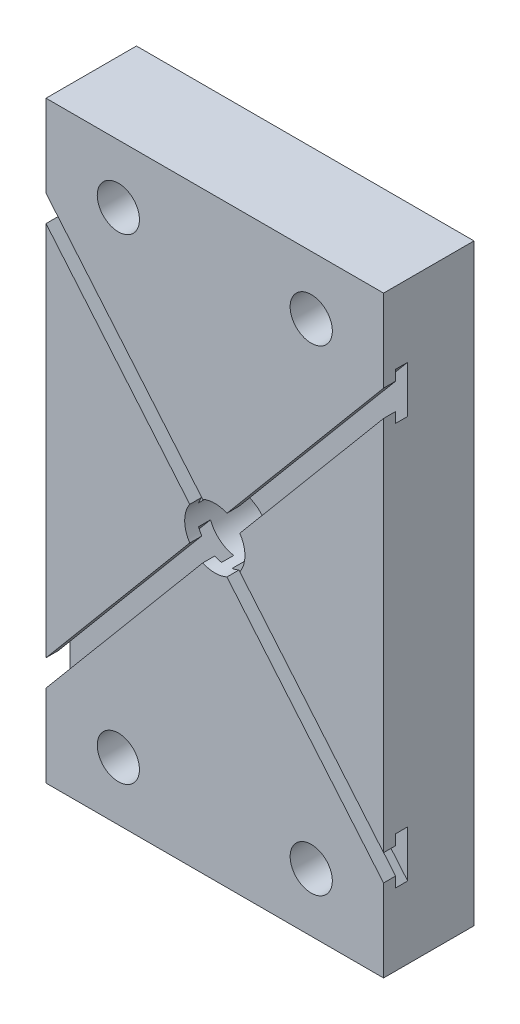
ISO-10303-21;
HEADER;
FILE_DESCRIPTION(('STEP AP214'),'2;1');
FILE_NAME('part.step','',(''),(''),'','','');
FILE_SCHEMA(('AUTOMOTIVE_DESIGN { 1 0 10303 214 1 1 1 1 }'));
ENDSEC;
DATA;
#1=APPLICATION_CONTEXT('core data for automotive mechanical design processes');
#2=APPLICATION_PROTOCOL_DEFINITION('international standard','automotive_design',2000,#1);
#3=PRODUCT_CONTEXT('',#1,'mechanical');
#4=PRODUCT('Part','Part','',(#3));
#5=PRODUCT_RELATED_PRODUCT_CATEGORY('part','',(#4));
#6=PRODUCT_DEFINITION_FORMATION('','',#4);
#7=PRODUCT_DEFINITION_CONTEXT('part definition',#1,'design');
#8=PRODUCT_DEFINITION('design','',#6,#7);
#9=PRODUCT_DEFINITION_SHAPE('','',#8);
#10=(LENGTH_UNIT() NAMED_UNIT(*) SI_UNIT(.MILLI.,.METRE.));
#11=(NAMED_UNIT(*) PLANE_ANGLE_UNIT() SI_UNIT($,.RADIAN.));
#12=(NAMED_UNIT(*) SI_UNIT($,.STERADIAN.) SOLID_ANGLE_UNIT());
#13=UNCERTAINTY_MEASURE_WITH_UNIT(LENGTH_MEASURE(1.E-05),#10,'distance_accuracy_value','');
#14=(GEOMETRIC_REPRESENTATION_CONTEXT(3) GLOBAL_UNCERTAINTY_ASSIGNED_CONTEXT((#13)) GLOBAL_UNIT_ASSIGNED_CONTEXT((#10,
#11,#12)) REPRESENTATION_CONTEXT('',''));
#15=CARTESIAN_POINT('',(0.,0.,0.));
#16=DIRECTION('',(0.,0.,1.));
#17=DIRECTION('',(1.,0.,0.));
#18=AXIS2_PLACEMENT_3D('',#15,#16,#17);
#19=CARTESIAN_POINT('',(-75.7495791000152,-117.5,30.));
#20=DIRECTION('',(0.766044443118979,-0.642787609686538,0.));
#21=DIRECTION('',(0.642787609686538,0.766044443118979,0.));
#22=AXIS2_PLACEMENT_3D('',#19,#20,#21);
#23=PLANE('',#22);
#24=DIRECTION('',(0.642787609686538,0.766044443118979,0.));
#25=VECTOR('',#24,1.);
#26=CARTESIAN_POINT('',(-75.7495791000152,-117.5,50.));
#27=LINE('',#26,#25);
#28=CARTESIAN_POINT('',(-88.3360735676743,-132.5,50.));
#29=VERTEX_POINT('',#28);
#30=CARTESIAN_POINT('',(-75.7495791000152,-117.5,50.));
#31=VERTEX_POINT('',#30);
#32=EDGE_CURVE('E118',#29,#31,#27,.T.);
#33=ORIENTED_EDGE('',*,*,#32,.T.);
#34=DIRECTION('',(0.,0.,1.));
#35=VECTOR('',#34,1.);
#36=CARTESIAN_POINT('',(-75.7495791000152,-117.5,30.));
#37=LINE('',#36,#35);
#38=CARTESIAN_POINT('',(-75.7495791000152,-117.5,30.));
#39=VERTEX_POINT('',#38);
#40=EDGE_CURVE('E12',#39,#31,#37,.T.);
#41=ORIENTED_EDGE('',*,*,#40,.F.);
#42=DIRECTION('',(0.642787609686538,0.766044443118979,0.));
#43=VECTOR('',#42,1.);
#44=CARTESIAN_POINT('',(-75.7495791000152,-117.5,30.));
#45=LINE('',#44,#43);
#46=CARTESIAN_POINT('',(-88.3360735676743,-132.5,30.));
#47=VERTEX_POINT('',#46);
#48=EDGE_CURVE('E106',#47,#39,#45,.T.);
#49=ORIENTED_EDGE('',*,*,#48,.F.);
#50=DIRECTION('',(0.,0.,1.));
#51=VECTOR('',#50,1.);
#52=CARTESIAN_POINT('',(-88.3360735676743,-132.5,30.));
#53=LINE('',#52,#51);
#54=EDGE_CURVE('E114',#47,#29,#53,.T.);
#55=ORIENTED_EDGE('',*,*,#54,.T.);
#56=EDGE_LOOP('',(#33,#41,#49,#55));
#57=FACE_BOUND('',#56,.T.);
#58=ADVANCED_FACE('F55',(#57),#23,.F.);
#59=CARTESIAN_POINT('',(-75.7495791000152,-117.5,30.));
#60=DIRECTION('',(0.,-1.,0.));
#61=DIRECTION('',(1.,0.,0.));
#62=AXIS2_PLACEMENT_3D('',#59,#60,#61);
#63=PLANE('',#62);
#64=DIRECTION('',(1.,0.,0.));
#65=VECTOR('',#64,1.);
#66=CARTESIAN_POINT('',(-75.7495791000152,-117.5,50.));
#67=LINE('',#66,#65);
#68=CARTESIAN_POINT('',(-7.50000000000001,-117.5,50.));
#69=VERTEX_POINT('',#68);
#70=EDGE_CURVE('E110',#31,#69,#67,.T.);
#71=ORIENTED_EDGE('',*,*,#70,.T.);
#72=DIRECTION('',(0.,0.,1.));
#73=VECTOR('',#72,1.);
#74=CARTESIAN_POINT('',(-7.50000000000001,-117.5,30.));
#75=LINE('',#74,#73);
#76=CARTESIAN_POINT('',(-7.50000000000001,-117.5,30.));
#77=VERTEX_POINT('',#76);
#78=EDGE_CURVE('E63',#77,#69,#75,.T.);
#79=ORIENTED_EDGE('',*,*,#78,.F.);
#80=DIRECTION('',(1.,0.,0.));
#81=VECTOR('',#80,1.);
#82=CARTESIAN_POINT('',(-75.7495791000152,-117.5,30.));
#83=LINE('',#82,#81);
#84=EDGE_CURVE('E101',#39,#77,#83,.T.);
#85=ORIENTED_EDGE('',*,*,#84,.F.);
#86=ORIENTED_EDGE('',*,*,#40,.T.);
#87=EDGE_LOOP('',(#71,#79,#85,#86));
#88=FACE_BOUND('',#87,.T.);
#89=ADVANCED_FACE('F109',(#88),#63,.F.);
#90=CARTESIAN_POINT('',(-7.5,-132.5,30.));
#91=DIRECTION('',(-1.,0.,0.));
#92=DIRECTION('',(0.,-1.,0.));
#93=AXIS2_PLACEMENT_3D('',#90,#91,#92);
#94=PLANE('',#93);
#95=DIRECTION('',(0.,-1.,0.));
#96=VECTOR('',#95,1.);
#97=CARTESIAN_POINT('',(-7.5,-132.5,50.));
#98=LINE('',#97,#96);
#99=CARTESIAN_POINT('',(-7.5,-132.5,50.));
#100=VERTEX_POINT('',#99);
#101=EDGE_CURVE('E88',#69,#100,#98,.T.);
#102=ORIENTED_EDGE('',*,*,#101,.T.);
#103=DIRECTION('',(0.,0.,1.));
#104=VECTOR('',#103,1.);
#105=CARTESIAN_POINT('',(-7.5,-132.5,30.));
#106=LINE('',#105,#104);
#107=CARTESIAN_POINT('',(-7.5,-132.5,30.));
#108=VERTEX_POINT('',#107);
#109=EDGE_CURVE('E111',#108,#100,#106,.T.);
#110=ORIENTED_EDGE('',*,*,#109,.F.);
#111=DIRECTION('',(0.,-1.,0.));
#112=VECTOR('',#111,1.);
#113=CARTESIAN_POINT('',(-7.5,-132.5,30.));
#114=LINE('',#113,#112);
#115=EDGE_CURVE('E104',#77,#108,#114,.T.);
#116=ORIENTED_EDGE('',*,*,#115,.F.);
#117=ORIENTED_EDGE('',*,*,#78,.T.);
#118=EDGE_LOOP('',(#102,#110,#116,#117));
#119=FACE_BOUND('',#118,.T.);
#120=ADVANCED_FACE('F112',(#119),#94,.F.);
#121=CARTESIAN_POINT('',(-88.3360735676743,-132.5,30.));
#122=DIRECTION('',(0.,1.,0.));
#123=DIRECTION('',(-1.,0.,0.));
#124=AXIS2_PLACEMENT_3D('',#121,#122,#123);
#125=PLANE('',#124);
#126=DIRECTION('',(-1.,0.,0.));
#127=VECTOR('',#126,1.);
#128=CARTESIAN_POINT('',(-88.3360735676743,-132.5,50.));
#129=LINE('',#128,#127);
#130=EDGE_CURVE('E94',#100,#29,#129,.T.);
#131=ORIENTED_EDGE('',*,*,#130,.T.);
#132=ORIENTED_EDGE('',*,*,#54,.F.);
#133=DIRECTION('',(-1.,0.,0.));
#134=VECTOR('',#133,1.);
#135=CARTESIAN_POINT('',(-88.3360735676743,-132.5,30.));
#136=LINE('',#135,#134);
#137=EDGE_CURVE('E71',#108,#47,#136,.T.);
#138=ORIENTED_EDGE('',*,*,#137,.F.);
#139=ORIENTED_EDGE('',*,*,#109,.T.);
#140=EDGE_LOOP('',(#131,#132,#138,#139));
#141=FACE_BOUND('',#140,.T.);
#142=ADVANCED_FACE('F125',(#141),#125,.F.);
#143=CARTESIAN_POINT('',(0.,0.,30.));
#144=DIRECTION('',(0.,0.,1.));
#145=DIRECTION('',(1.,0.,0.));
#146=AXIS2_PLACEMENT_3D('',#143,#144,#145);
#147=PLANE('',#146);
#148=ORIENTED_EDGE('',*,*,#48,.T.);
#149=ORIENTED_EDGE('',*,*,#84,.T.);
#150=ORIENTED_EDGE('',*,*,#115,.T.);
#151=ORIENTED_EDGE('',*,*,#137,.T.);
#152=EDGE_LOOP('',(#148,#149,#150,#151));
#153=FACE_BOUND('',#152,.T.);
#154=ADVANCED_FACE('F102',(#153),#147,.F.);
#155=CARTESIAN_POINT('',(0.,0.,50.));
#156=DIRECTION('',(0.,0.,1.));
#157=DIRECTION('',(1.,0.,0.));
#158=AXIS2_PLACEMENT_3D('',#155,#156,#157);
#159=PLANE('',#158);
#160=ORIENTED_EDGE('',*,*,#32,.F.);
#161=ORIENTED_EDGE('',*,*,#130,.F.);
#162=ORIENTED_EDGE('',*,*,#101,.F.);
#163=ORIENTED_EDGE('',*,*,#70,.F.);
#164=EDGE_LOOP('',(#160,#161,#162,#163));
#165=FACE_BOUND('',#164,.T.);
#166=ADVANCED_FACE('F128',(#165),#159,.T.);
#167=CLOSED_SHELL('',(#58,#89,#120,#142,#154,#166));
#168=MANIFOLD_SOLID_BREP('B2',#167);
#169=CARTESIAN_POINT('',(88.3360735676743,-132.5,30.));
#170=DIRECTION('',(-0.766044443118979,-0.642787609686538,0.));
#171=DIRECTION('',(0.642787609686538,-0.766044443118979,0.));
#172=AXIS2_PLACEMENT_3D('',#169,#170,#171);
#173=PLANE('',#172);
#174=DIRECTION('',(0.642787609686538,-0.766044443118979,0.));
#175=VECTOR('',#174,1.);
#176=CARTESIAN_POINT('',(88.3360735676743,-132.5,50.));
#177=LINE('',#176,#175);
#178=CARTESIAN_POINT('',(75.7495791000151,-117.5,50.));
#179=VERTEX_POINT('',#178);
#180=CARTESIAN_POINT('',(88.3360735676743,-132.5,50.));
#181=VERTEX_POINT('',#180);
#182=EDGE_CURVE('E251',#179,#181,#177,.T.);
#183=ORIENTED_EDGE('',*,*,#182,.T.);
#184=DIRECTION('',(0.,0.,1.));
#185=VECTOR('',#184,1.);
#186=CARTESIAN_POINT('',(88.3360735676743,-132.5,30.));
#187=LINE('',#186,#185);
#188=CARTESIAN_POINT('',(88.3360735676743,-132.5,30.));
#189=VERTEX_POINT('',#188);
#190=EDGE_CURVE('E53',#189,#181,#187,.T.);
#191=ORIENTED_EDGE('',*,*,#190,.F.);
#192=DIRECTION('',(0.642787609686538,-0.766044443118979,0.));
#193=VECTOR('',#192,1.);
#194=CARTESIAN_POINT('',(88.3360735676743,-132.5,30.));
#195=LINE('',#194,#193);
#196=CARTESIAN_POINT('',(75.7495791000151,-117.5,30.));
#197=VERTEX_POINT('',#196);
#198=EDGE_CURVE('E239',#197,#189,#195,.T.);
#199=ORIENTED_EDGE('',*,*,#198,.F.);
#200=DIRECTION('',(0.,0.,1.));
#201=VECTOR('',#200,1.);
#202=CARTESIAN_POINT('',(75.7495791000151,-117.5,30.));
#203=LINE('',#202,#201);
#204=EDGE_CURVE('E247',#197,#179,#203,.T.);
#205=ORIENTED_EDGE('',*,*,#204,.T.);
#206=EDGE_LOOP('',(#183,#191,#199,#205));
#207=FACE_BOUND('',#206,.T.);
#208=ADVANCED_FACE('F188',(#207),#173,.F.);
#209=CARTESIAN_POINT('',(7.5,-132.5,30.));
#210=DIRECTION('',(0.,1.,0.));
#211=DIRECTION('',(-1.,0.,0.));
#212=AXIS2_PLACEMENT_3D('',#209,#210,#211);
#213=PLANE('',#212);
#214=DIRECTION('',(-1.,0.,0.));
#215=VECTOR('',#214,1.);
#216=CARTESIAN_POINT('',(7.5,-132.5,50.));
#217=LINE('',#216,#215);
#218=CARTESIAN_POINT('',(7.5,-132.5,50.));
#219=VERTEX_POINT('',#218);
#220=EDGE_CURVE('E243',#181,#219,#217,.T.);
#221=ORIENTED_EDGE('',*,*,#220,.T.);
#222=DIRECTION('',(0.,0.,1.));
#223=VECTOR('',#222,1.);
#224=CARTESIAN_POINT('',(7.5,-132.5,30.));
#225=LINE('',#224,#223);
#226=CARTESIAN_POINT('',(7.5,-132.5,30.));
#227=VERTEX_POINT('',#226);
#228=EDGE_CURVE('E196',#227,#219,#225,.T.);
#229=ORIENTED_EDGE('',*,*,#228,.F.);
#230=DIRECTION('',(-1.,0.,0.));
#231=VECTOR('',#230,1.);
#232=CARTESIAN_POINT('',(7.5,-132.5,30.));
#233=LINE('',#232,#231);
#234=EDGE_CURVE('E234',#189,#227,#233,.T.);
#235=ORIENTED_EDGE('',*,*,#234,.F.);
#236=ORIENTED_EDGE('',*,*,#190,.T.);
#237=EDGE_LOOP('',(#221,#229,#235,#236));
#238=FACE_BOUND('',#237,.T.);
#239=ADVANCED_FACE('F242',(#238),#213,.F.);
#240=CARTESIAN_POINT('',(7.5,-132.5,30.));
#241=DIRECTION('',(1.,0.,0.));
#242=DIRECTION('',(0.,1.,0.));
#243=AXIS2_PLACEMENT_3D('',#240,#241,#242);
#244=PLANE('',#243);
#245=DIRECTION('',(0.,1.,0.));
#246=VECTOR('',#245,1.);
#247=CARTESIAN_POINT('',(7.5,-132.5,50.));
#248=LINE('',#247,#246);
#249=CARTESIAN_POINT('',(7.50000000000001,-117.5,50.));
#250=VERTEX_POINT('',#249);
#251=EDGE_CURVE('E221',#219,#250,#248,.T.);
#252=ORIENTED_EDGE('',*,*,#251,.T.);
#253=DIRECTION('',(0.,0.,1.));
#254=VECTOR('',#253,1.);
#255=CARTESIAN_POINT('',(7.50000000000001,-117.5,30.));
#256=LINE('',#255,#254);
#257=CARTESIAN_POINT('',(7.50000000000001,-117.5,30.));
#258=VERTEX_POINT('',#257);
#259=EDGE_CURVE('E244',#258,#250,#256,.T.);
#260=ORIENTED_EDGE('',*,*,#259,.F.);
#261=DIRECTION('',(0.,1.,0.));
#262=VECTOR('',#261,1.);
#263=CARTESIAN_POINT('',(7.5,-132.5,30.));
#264=LINE('',#263,#262);
#265=EDGE_CURVE('E237',#227,#258,#264,.T.);
#266=ORIENTED_EDGE('',*,*,#265,.F.);
#267=ORIENTED_EDGE('',*,*,#228,.T.);
#268=EDGE_LOOP('',(#252,#260,#266,#267));
#269=FACE_BOUND('',#268,.T.);
#270=ADVANCED_FACE('F245',(#269),#244,.F.);
#271=CARTESIAN_POINT('',(7.50000000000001,-117.5,30.));
#272=DIRECTION('',(0.,-1.,0.));
#273=DIRECTION('',(1.,0.,0.));
#274=AXIS2_PLACEMENT_3D('',#271,#272,#273);
#275=PLANE('',#274);
#276=DIRECTION('',(1.,0.,0.));
#277=VECTOR('',#276,1.);
#278=CARTESIAN_POINT('',(7.50000000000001,-117.5,50.));
#279=LINE('',#278,#277);
#280=EDGE_CURVE('E227',#250,#179,#279,.T.);
#281=ORIENTED_EDGE('',*,*,#280,.T.);
#282=ORIENTED_EDGE('',*,*,#204,.F.);
#283=DIRECTION('',(1.,0.,0.));
#284=VECTOR('',#283,1.);
#285=CARTESIAN_POINT('',(7.50000000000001,-117.5,30.));
#286=LINE('',#285,#284);
#287=EDGE_CURVE('E204',#258,#197,#286,.T.);
#288=ORIENTED_EDGE('',*,*,#287,.F.);
#289=ORIENTED_EDGE('',*,*,#259,.T.);
#290=EDGE_LOOP('',(#281,#282,#288,#289));
#291=FACE_BOUND('',#290,.T.);
#292=ADVANCED_FACE('F258',(#291),#275,.F.);
#293=CARTESIAN_POINT('',(0.,0.,30.));
#294=DIRECTION('',(0.,0.,-1.));
#295=DIRECTION('',(-1.,0.,0.));
#296=AXIS2_PLACEMENT_3D('',#293,#294,#295);
#297=PLANE('',#296);
#298=ORIENTED_EDGE('',*,*,#198,.T.);
#299=ORIENTED_EDGE('',*,*,#234,.T.);
#300=ORIENTED_EDGE('',*,*,#265,.T.);
#301=ORIENTED_EDGE('',*,*,#287,.T.);
#302=EDGE_LOOP('',(#298,#299,#300,#301));
#303=FACE_BOUND('',#302,.T.);
#304=ADVANCED_FACE('F235',(#303),#297,.T.);
#305=CARTESIAN_POINT('',(0.,0.,50.));
#306=DIRECTION('',(0.,0.,-1.));
#307=DIRECTION('',(-1.,0.,0.));
#308=AXIS2_PLACEMENT_3D('',#305,#306,#307);
#309=PLANE('',#308);
#310=ORIENTED_EDGE('',*,*,#182,.F.);
#311=ORIENTED_EDGE('',*,*,#280,.F.);
#312=ORIENTED_EDGE('',*,*,#251,.F.);
#313=ORIENTED_EDGE('',*,*,#220,.F.);
#314=EDGE_LOOP('',(#310,#311,#312,#313));
#315=FACE_BOUND('',#314,.T.);
#316=ADVANCED_FACE('F261',(#315),#309,.F.);
#317=CLOSED_SHELL('',(#208,#239,#270,#292,#304,#316));
#318=MANIFOLD_SOLID_BREP('B6',#317);
#319=CARTESIAN_POINT('',(75.7495791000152,117.5,30.));
#320=DIRECTION('',(-0.766044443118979,0.642787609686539,0.));
#321=DIRECTION('',(-0.642787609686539,-0.766044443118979,0.));
#322=AXIS2_PLACEMENT_3D('',#319,#320,#321);
#323=PLANE('',#322);
#324=DIRECTION('',(-0.642787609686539,-0.766044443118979,0.));
#325=VECTOR('',#324,1.);
#326=CARTESIAN_POINT('',(75.7495791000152,117.5,50.));
#327=LINE('',#326,#325);
#328=CARTESIAN_POINT('',(88.3360735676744,132.5,50.));
#329=VERTEX_POINT('',#328);
#330=CARTESIAN_POINT('',(75.7495791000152,117.5,50.));
#331=VERTEX_POINT('',#330);
#332=EDGE_CURVE('E384',#329,#331,#327,.T.);
#333=ORIENTED_EDGE('',*,*,#332,.T.);
#334=DIRECTION('',(0.,0.,1.));
#335=VECTOR('',#334,1.);
#336=CARTESIAN_POINT('',(75.7495791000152,117.5,30.));
#337=LINE('',#336,#335);
#338=CARTESIAN_POINT('',(75.7495791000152,117.5,30.));
#339=VERTEX_POINT('',#338);
#340=EDGE_CURVE('E186',#339,#331,#337,.T.);
#341=ORIENTED_EDGE('',*,*,#340,.F.);
#342=DIRECTION('',(-0.642787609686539,-0.766044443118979,0.));
#343=VECTOR('',#342,1.);
#344=CARTESIAN_POINT('',(75.7495791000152,117.5,30.));
#345=LINE('',#344,#343);
#346=CARTESIAN_POINT('',(88.3360735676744,132.5,30.));
#347=VERTEX_POINT('',#346);
#348=EDGE_CURVE('E372',#347,#339,#345,.T.);
#349=ORIENTED_EDGE('',*,*,#348,.F.);
#350=DIRECTION('',(0.,0.,1.));
#351=VECTOR('',#350,1.);
#352=CARTESIAN_POINT('',(88.3360735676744,132.5,30.));
#353=LINE('',#352,#351);
#354=EDGE_CURVE('E380',#347,#329,#353,.T.);
#355=ORIENTED_EDGE('',*,*,#354,.T.);
#356=EDGE_LOOP('',(#333,#341,#349,#355));
#357=FACE_BOUND('',#356,.T.);
#358=ADVANCED_FACE('F321',(#357),#323,.F.);
#359=CARTESIAN_POINT('',(7.49999999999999,117.5,30.));
#360=DIRECTION('',(0.,1.,0.));
#361=DIRECTION('',(-1.,0.,0.));
#362=AXIS2_PLACEMENT_3D('',#359,#360,#361);
#363=PLANE('',#362);
#364=DIRECTION('',(-1.,0.,0.));
#365=VECTOR('',#364,1.);
#366=CARTESIAN_POINT('',(7.49999999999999,117.5,50.));
#367=LINE('',#366,#365);
#368=CARTESIAN_POINT('',(7.49999999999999,117.5,50.));
#369=VERTEX_POINT('',#368);
#370=EDGE_CURVE('E376',#331,#369,#367,.T.);
#371=ORIENTED_EDGE('',*,*,#370,.T.);
#372=DIRECTION('',(0.,0.,1.));
#373=VECTOR('',#372,1.);
#374=CARTESIAN_POINT('',(7.49999999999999,117.5,30.));
#375=LINE('',#374,#373);
#376=CARTESIAN_POINT('',(7.49999999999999,117.5,30.));
#377=VERTEX_POINT('',#376);
#378=EDGE_CURVE('E329',#377,#369,#375,.T.);
#379=ORIENTED_EDGE('',*,*,#378,.F.);
#380=DIRECTION('',(-1.,0.,0.));
#381=VECTOR('',#380,1.);
#382=CARTESIAN_POINT('',(7.49999999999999,117.5,30.));
#383=LINE('',#382,#381);
#384=EDGE_CURVE('E367',#339,#377,#383,.T.);
#385=ORIENTED_EDGE('',*,*,#384,.F.);
#386=ORIENTED_EDGE('',*,*,#340,.T.);
#387=EDGE_LOOP('',(#371,#379,#385,#386));
#388=FACE_BOUND('',#387,.T.);
#389=ADVANCED_FACE('F375',(#388),#363,.F.);
#390=CARTESIAN_POINT('',(7.49999999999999,117.5,30.));
#391=DIRECTION('',(1.,0.,0.));
#392=DIRECTION('',(0.,1.,0.));
#393=AXIS2_PLACEMENT_3D('',#390,#391,#392);
#394=PLANE('',#393);
#395=DIRECTION('',(0.,1.,0.));
#396=VECTOR('',#395,1.);
#397=CARTESIAN_POINT('',(7.49999999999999,117.5,50.));
#398=LINE('',#397,#396);
#399=CARTESIAN_POINT('',(7.5,132.5,50.));
#400=VERTEX_POINT('',#399);
#401=EDGE_CURVE('E354',#369,#400,#398,.T.);
#402=ORIENTED_EDGE('',*,*,#401,.T.);
#403=DIRECTION('',(0.,0.,1.));
#404=VECTOR('',#403,1.);
#405=CARTESIAN_POINT('',(7.5,132.5,30.));
#406=LINE('',#405,#404);
#407=CARTESIAN_POINT('',(7.5,132.5,30.));
#408=VERTEX_POINT('',#407);
#409=EDGE_CURVE('E377',#408,#400,#406,.T.);
#410=ORIENTED_EDGE('',*,*,#409,.F.);
#411=DIRECTION('',(0.,1.,0.));
#412=VECTOR('',#411,1.);
#413=CARTESIAN_POINT('',(7.49999999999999,117.5,30.));
#414=LINE('',#413,#412);
#415=EDGE_CURVE('E370',#377,#408,#414,.T.);
#416=ORIENTED_EDGE('',*,*,#415,.F.);
#417=ORIENTED_EDGE('',*,*,#378,.T.);
#418=EDGE_LOOP('',(#402,#410,#416,#417));
#419=FACE_BOUND('',#418,.T.);
#420=ADVANCED_FACE('F378',(#419),#394,.F.);
#421=CARTESIAN_POINT('',(7.5,132.5,30.));
#422=DIRECTION('',(0.,-1.,0.));
#423=DIRECTION('',(0.,0.,-1.));
#424=AXIS2_PLACEMENT_3D('',#421,#422,#423);
#425=PLANE('',#424);
#426=DIRECTION('',(1.,0.,0.));
#427=VECTOR('',#426,1.);
#428=CARTESIAN_POINT('',(7.5,132.5,50.));
#429=LINE('',#428,#427);
#430=EDGE_CURVE('E360',#400,#329,#429,.T.);
#431=ORIENTED_EDGE('',*,*,#430,.T.);
#432=ORIENTED_EDGE('',*,*,#354,.F.);
#433=DIRECTION('',(1.,0.,0.));
#434=VECTOR('',#433,1.);
#435=CARTESIAN_POINT('',(7.5,132.5,30.));
#436=LINE('',#435,#434);
#437=EDGE_CURVE('E337',#408,#347,#436,.T.);
#438=ORIENTED_EDGE('',*,*,#437,.F.);
#439=ORIENTED_EDGE('',*,*,#409,.T.);
#440=EDGE_LOOP('',(#431,#432,#438,#439));
#441=FACE_BOUND('',#440,.T.);
#442=ADVANCED_FACE('F391',(#441),#425,.F.);
#443=CARTESIAN_POINT('',(0.,0.,30.));
#444=DIRECTION('',(0.,0.,-1.));
#445=DIRECTION('',(-1.,0.,0.));
#446=AXIS2_PLACEMENT_3D('',#443,#444,#445);
#447=PLANE('',#446);
#448=ORIENTED_EDGE('',*,*,#348,.T.);
#449=ORIENTED_EDGE('',*,*,#384,.T.);
#450=ORIENTED_EDGE('',*,*,#415,.T.);
#451=ORIENTED_EDGE('',*,*,#437,.T.);
#452=EDGE_LOOP('',(#448,#449,#450,#451));
#453=FACE_BOUND('',#452,.T.);
#454=ADVANCED_FACE('F368',(#453),#447,.T.);
#455=CARTESIAN_POINT('',(0.,0.,50.));
#456=DIRECTION('',(0.,0.,-1.));
#457=DIRECTION('',(-1.,0.,0.));
#458=AXIS2_PLACEMENT_3D('',#455,#456,#457);
#459=PLANE('',#458);
#460=ORIENTED_EDGE('',*,*,#332,.F.);
#461=ORIENTED_EDGE('',*,*,#430,.F.);
#462=ORIENTED_EDGE('',*,*,#401,.F.);
#463=ORIENTED_EDGE('',*,*,#370,.F.);
#464=EDGE_LOOP('',(#460,#461,#462,#463));
#465=FACE_BOUND('',#464,.T.);
#466=ADVANCED_FACE('F394',(#465),#459,.F.);
#467=CLOSED_SHELL('',(#358,#389,#420,#442,#454,#466));
#468=MANIFOLD_SOLID_BREP('B47',#467);
#469=CARTESIAN_POINT('',(-88.3360735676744,132.5,30.));
#470=DIRECTION('',(0.766044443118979,0.642787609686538,0.));
#471=DIRECTION('',(-0.642787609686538,0.766044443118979,0.));
#472=AXIS2_PLACEMENT_3D('',#469,#470,#471);
#473=PLANE('',#472);
#474=DIRECTION('',(-0.642787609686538,0.766044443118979,0.));
#475=VECTOR('',#474,1.);
#476=CARTESIAN_POINT('',(-88.3360735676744,132.5,50.));
#477=LINE('',#476,#475);
#478=CARTESIAN_POINT('',(-75.7495791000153,117.5,50.));
#479=VERTEX_POINT('',#478);
#480=CARTESIAN_POINT('',(-88.3360735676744,132.5,50.));
#481=VERTEX_POINT('',#480);
#482=EDGE_CURVE('E517',#479,#481,#477,.T.);
#483=ORIENTED_EDGE('',*,*,#482,.T.);
#484=DIRECTION('',(0.,0.,1.));
#485=VECTOR('',#484,1.);
#486=CARTESIAN_POINT('',(-88.3360735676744,132.5,30.));
#487=LINE('',#486,#485);
#488=CARTESIAN_POINT('',(-88.3360735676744,132.5,30.));
#489=VERTEX_POINT('',#488);
#490=EDGE_CURVE('E319',#489,#481,#487,.T.);
#491=ORIENTED_EDGE('',*,*,#490,.F.);
#492=DIRECTION('',(-0.642787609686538,0.766044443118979,0.));
#493=VECTOR('',#492,1.);
#494=CARTESIAN_POINT('',(-88.3360735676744,132.5,30.));
#495=LINE('',#494,#493);
#496=CARTESIAN_POINT('',(-75.7495791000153,117.5,30.));
#497=VERTEX_POINT('',#496);
#498=EDGE_CURVE('E505',#497,#489,#495,.T.);
#499=ORIENTED_EDGE('',*,*,#498,.F.);
#500=DIRECTION('',(0.,0.,1.));
#501=VECTOR('',#500,1.);
#502=CARTESIAN_POINT('',(-75.7495791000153,117.5,30.));
#503=LINE('',#502,#501);
#504=EDGE_CURVE('E513',#497,#479,#503,.T.);
#505=ORIENTED_EDGE('',*,*,#504,.T.);
#506=EDGE_LOOP('',(#483,#491,#499,#505));
#507=FACE_BOUND('',#506,.T.);
#508=ADVANCED_FACE('F454',(#507),#473,.F.);
#509=CARTESIAN_POINT('',(-88.3360735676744,132.5,30.));
#510=DIRECTION('',(0.,-1.,0.));
#511=DIRECTION('',(0.,0.,-1.));
#512=AXIS2_PLACEMENT_3D('',#509,#510,#511);
#513=PLANE('',#512);
#514=DIRECTION('',(1.,0.,0.));
#515=VECTOR('',#514,1.);
#516=CARTESIAN_POINT('',(-88.3360735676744,132.5,50.));
#517=LINE('',#516,#515);
#518=CARTESIAN_POINT('',(-7.5,132.5,50.));
#519=VERTEX_POINT('',#518);
#520=EDGE_CURVE('E509',#481,#519,#517,.T.);
#521=ORIENTED_EDGE('',*,*,#520,.T.);
#522=DIRECTION('',(0.,0.,1.));
#523=VECTOR('',#522,1.);
#524=CARTESIAN_POINT('',(-7.5,132.5,30.));
#525=LINE('',#524,#523);
#526=CARTESIAN_POINT('',(-7.5,132.5,30.));
#527=VERTEX_POINT('',#526);
#528=EDGE_CURVE('E462',#527,#519,#525,.T.);
#529=ORIENTED_EDGE('',*,*,#528,.F.);
#530=DIRECTION('',(1.,0.,0.));
#531=VECTOR('',#530,1.);
#532=CARTESIAN_POINT('',(-88.3360735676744,132.5,30.));
#533=LINE('',#532,#531);
#534=EDGE_CURVE('E500',#489,#527,#533,.T.);
#535=ORIENTED_EDGE('',*,*,#534,.F.);
#536=ORIENTED_EDGE('',*,*,#490,.T.);
#537=EDGE_LOOP('',(#521,#529,#535,#536));
#538=FACE_BOUND('',#537,.T.);
#539=ADVANCED_FACE('F508',(#538),#513,.F.);
#540=CARTESIAN_POINT('',(-7.5,117.5,30.));
#541=DIRECTION('',(-1.,0.,0.));
#542=DIRECTION('',(0.,-1.,0.));
#543=AXIS2_PLACEMENT_3D('',#540,#541,#542);
#544=PLANE('',#543);
#545=DIRECTION('',(0.,-1.,0.));
#546=VECTOR('',#545,1.);
#547=CARTESIAN_POINT('',(-7.5,117.5,50.));
#548=LINE('',#547,#546);
#549=CARTESIAN_POINT('',(-7.5,117.5,50.));
#550=VERTEX_POINT('',#549);
#551=EDGE_CURVE('E487',#519,#550,#548,.T.);
#552=ORIENTED_EDGE('',*,*,#551,.T.);
#553=DIRECTION('',(0.,0.,1.));
#554=VECTOR('',#553,1.);
#555=CARTESIAN_POINT('',(-7.5,117.5,30.));
#556=LINE('',#555,#554);
#557=CARTESIAN_POINT('',(-7.5,117.5,30.));
#558=VERTEX_POINT('',#557);
#559=EDGE_CURVE('E510',#558,#550,#556,.T.);
#560=ORIENTED_EDGE('',*,*,#559,.F.);
#561=DIRECTION('',(0.,-1.,0.));
#562=VECTOR('',#561,1.);
#563=CARTESIAN_POINT('',(-7.5,117.5,30.));
#564=LINE('',#563,#562);
#565=EDGE_CURVE('E503',#527,#558,#564,.T.);
#566=ORIENTED_EDGE('',*,*,#565,.F.);
#567=ORIENTED_EDGE('',*,*,#528,.T.);
#568=EDGE_LOOP('',(#552,#560,#566,#567));
#569=FACE_BOUND('',#568,.T.);
#570=ADVANCED_FACE('F511',(#569),#544,.F.);
#571=CARTESIAN_POINT('',(-75.7495791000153,117.5,30.));
#572=DIRECTION('',(0.,1.,0.));
#573=DIRECTION('',(-1.,0.,0.));
#574=AXIS2_PLACEMENT_3D('',#571,#572,#573);
#575=PLANE('',#574);
#576=DIRECTION('',(-1.,0.,0.));
#577=VECTOR('',#576,1.);
#578=CARTESIAN_POINT('',(-75.7495791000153,117.5,50.));
#579=LINE('',#578,#577);
#580=EDGE_CURVE('E493',#550,#479,#579,.T.);
#581=ORIENTED_EDGE('',*,*,#580,.T.);
#582=ORIENTED_EDGE('',*,*,#504,.F.);
#583=DIRECTION('',(-1.,0.,0.));
#584=VECTOR('',#583,1.);
#585=CARTESIAN_POINT('',(-75.7495791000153,117.5,30.));
#586=LINE('',#585,#584);
#587=EDGE_CURVE('E470',#558,#497,#586,.T.);
#588=ORIENTED_EDGE('',*,*,#587,.F.);
#589=ORIENTED_EDGE('',*,*,#559,.T.);
#590=EDGE_LOOP('',(#581,#582,#588,#589));
#591=FACE_BOUND('',#590,.T.);
#592=ADVANCED_FACE('F524',(#591),#575,.F.);
#593=CARTESIAN_POINT('',(0.,0.,30.));
#594=DIRECTION('',(0.,0.,1.));
#595=DIRECTION('',(1.,0.,0.));
#596=AXIS2_PLACEMENT_3D('',#593,#594,#595);
#597=PLANE('',#596);
#598=ORIENTED_EDGE('',*,*,#498,.T.);
#599=ORIENTED_EDGE('',*,*,#534,.T.);
#600=ORIENTED_EDGE('',*,*,#565,.T.);
#601=ORIENTED_EDGE('',*,*,#587,.T.);
#602=EDGE_LOOP('',(#598,#599,#600,#601));
#603=FACE_BOUND('',#602,.T.);
#604=ADVANCED_FACE('F501',(#603),#597,.F.);
#605=CARTESIAN_POINT('',(0.,0.,50.));
#606=DIRECTION('',(0.,0.,1.));
#607=DIRECTION('',(1.,0.,0.));
#608=AXIS2_PLACEMENT_3D('',#605,#606,#607);
#609=PLANE('',#608);
#610=ORIENTED_EDGE('',*,*,#482,.F.);
#611=ORIENTED_EDGE('',*,*,#580,.F.);
#612=ORIENTED_EDGE('',*,*,#551,.F.);
#613=ORIENTED_EDGE('',*,*,#520,.F.);
#614=EDGE_LOOP('',(#610,#611,#612,#613));
#615=FACE_BOUND('',#614,.T.);
#616=ADVANCED_FACE('F527',(#615),#609,.T.);
#617=CLOSED_SHELL('',(#508,#539,#570,#592,#604,#616));
#618=MANIFOLD_SOLID_BREP('B180',#617);
#619=CARTESIAN_POINT('',(16.7007772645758,47.1283782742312,30.));
#620=DIRECTION('',(0.766044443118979,-0.642787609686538,0.));
#621=DIRECTION('',(0.642787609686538,0.766044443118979,0.));
#622=AXIS2_PLACEMENT_3D('',#619,#620,#621);
#623=PLANE('',#622);
#624=DIRECTION('',(0.642787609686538,0.766044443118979,0.));
#625=VECTOR('',#624,1.);
#626=CARTESIAN_POINT('',(16.7007772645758,47.1283782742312,50.));
#627=LINE('',#626,#625);
#628=CARTESIAN_POINT('',(16.7007772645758,47.1283782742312,50.));
#629=VERTEX_POINT('',#628);
#630=CARTESIAN_POINT('',(125.,176.194366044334,50.));
#631=VERTEX_POINT('',#630);
#632=EDGE_CURVE('E650',#629,#631,#627,.T.);
#633=ORIENTED_EDGE('',*,*,#632,.T.);
#634=DIRECTION('',(0.,0.,1.));
#635=VECTOR('',#634,1.);
#636=CARTESIAN_POINT('',(125.,176.194366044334,30.));
#637=LINE('',#636,#635);
#638=CARTESIAN_POINT('',(125.,176.194366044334,30.));
#639=VERTEX_POINT('',#638);
#640=EDGE_CURVE('E452',#639,#631,#637,.T.);
#641=ORIENTED_EDGE('',*,*,#640,.F.);
#642=DIRECTION('',(0.642787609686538,0.766044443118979,0.));
#643=VECTOR('',#642,1.);
#644=CARTESIAN_POINT('',(16.7007772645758,47.1283782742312,30.));
#645=LINE('',#644,#643);
#646=CARTESIAN_POINT('',(16.7007772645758,47.1283782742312,30.));
#647=VERTEX_POINT('',#646);
#648=EDGE_CURVE('E638',#647,#639,#645,.T.);
#649=ORIENTED_EDGE('',*,*,#648,.F.);
#650=DIRECTION('',(0.,0.,1.));
#651=VECTOR('',#650,1.);
#652=CARTESIAN_POINT('',(16.7007772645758,47.1283782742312,30.));
#653=LINE('',#652,#651);
#654=EDGE_CURVE('E646',#647,#629,#653,.T.);
#655=ORIENTED_EDGE('',*,*,#654,.T.);
#656=EDGE_LOOP('',(#633,#641,#649,#655));
#657=FACE_BOUND('',#656,.T.);
#658=ADVANCED_FACE('F587',(#657),#623,.F.);
#659=CARTESIAN_POINT('',(125.,176.194366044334,30.));
#660=DIRECTION('',(-1.,0.,0.));
#661=DIRECTION('',(0.,-1.,0.));
#662=AXIS2_PLACEMENT_3D('',#659,#660,#661);
#663=PLANE('',#662);
#664=DIRECTION('',(0.,-1.,0.));
#665=VECTOR('',#664,1.);
#666=CARTESIAN_POINT('',(125.,176.194366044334,50.));
#667=LINE('',#666,#665);
#668=CARTESIAN_POINT('',(125.,121.74403210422,50.));
#669=VERTEX_POINT('',#668);
#670=EDGE_CURVE('E642',#631,#669,#667,.T.);
#671=ORIENTED_EDGE('',*,*,#670,.T.);
#672=DIRECTION('',(0.,0.,1.));
#673=VECTOR('',#672,1.);
#674=CARTESIAN_POINT('',(125.,121.74403210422,30.));
#675=LINE('',#674,#673);
#676=CARTESIAN_POINT('',(125.,121.74403210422,30.));
#677=VERTEX_POINT('',#676);
#678=EDGE_CURVE('E595',#677,#669,#675,.T.);
#679=ORIENTED_EDGE('',*,*,#678,.F.);
#680=DIRECTION('',(0.,-1.,0.));
#681=VECTOR('',#680,1.);
#682=CARTESIAN_POINT('',(125.,176.194366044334,30.));
#683=LINE('',#682,#681);
#684=EDGE_CURVE('E633',#639,#677,#683,.T.);
#685=ORIENTED_EDGE('',*,*,#684,.F.);
#686=ORIENTED_EDGE('',*,*,#640,.T.);
#687=EDGE_LOOP('',(#671,#679,#685,#686));
#688=FACE_BOUND('',#687,.T.);
#689=ADVANCED_FACE('F641',(#688),#663,.F.);
#690=CARTESIAN_POINT('',(43.51233277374,24.6308119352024,30.));
#691=DIRECTION('',(-0.766044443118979,0.642787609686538,0.));
#692=DIRECTION('',(-0.642787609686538,-0.766044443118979,0.));
#693=AXIS2_PLACEMENT_3D('',#690,#691,#692);
#694=PLANE('',#693);
#695=DIRECTION('',(-0.642787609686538,-0.766044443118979,0.));
#696=VECTOR('',#695,1.);
#697=CARTESIAN_POINT('',(43.51233277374,24.6308119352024,50.));
#698=LINE('',#697,#696);
#699=CARTESIAN_POINT('',(43.51233277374,24.6308119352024,50.));
#700=VERTEX_POINT('',#699);
#701=EDGE_CURVE('E620',#669,#700,#698,.T.);
#702=ORIENTED_EDGE('',*,*,#701,.T.);
#703=DIRECTION('',(0.,0.,1.));
#704=VECTOR('',#703,1.);
#705=CARTESIAN_POINT('',(43.51233277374,24.6308119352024,30.));
#706=LINE('',#705,#704);
#707=CARTESIAN_POINT('',(43.51233277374,24.6308119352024,30.));
#708=VERTEX_POINT('',#707);
#709=EDGE_CURVE('E643',#708,#700,#706,.T.);
#710=ORIENTED_EDGE('',*,*,#709,.F.);
#711=DIRECTION('',(-0.642787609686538,-0.766044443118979,0.));
#712=VECTOR('',#711,1.);
#713=CARTESIAN_POINT('',(43.51233277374,24.6308119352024,30.));
#714=LINE('',#713,#712);
#715=EDGE_CURVE('E636',#677,#708,#714,.T.);
#716=ORIENTED_EDGE('',*,*,#715,.F.);
#717=ORIENTED_EDGE('',*,*,#678,.T.);
#718=EDGE_LOOP('',(#702,#710,#716,#717));
#719=FACE_BOUND('',#718,.T.);
#720=ADVANCED_FACE('F644',(#719),#694,.F.);
#721=CARTESIAN_POINT('',(0.,0.,30.));
#722=DIRECTION('',(0.,0.,1.));
#723=DIRECTION('',(1.,0.,0.));
#724=AXIS2_PLACEMENT_3D('',#721,#722,#723);
#725=CYLINDRICAL_SURFACE('',#724,50.);
#726=CARTESIAN_POINT('',(0.,0.,50.));
#727=DIRECTION('',(0.,0.,1.));
#728=DIRECTION('',(-1.,0.,0.));
#729=AXIS2_PLACEMENT_3D('',#726,#727,#728);
#730=CIRCLE('',#729,50.);
#731=EDGE_CURVE('E626',#700,#629,#730,.T.);
#732=ORIENTED_EDGE('',*,*,#731,.T.);
#733=ORIENTED_EDGE('',*,*,#654,.F.);
#734=CARTESIAN_POINT('',(0.,0.,30.));
#735=DIRECTION('',(0.,0.,1.));
#736=DIRECTION('',(-1.,0.,0.));
#737=AXIS2_PLACEMENT_3D('',#734,#735,#736);
#738=CIRCLE('',#737,50.);
#739=EDGE_CURVE('E603',#708,#647,#738,.T.);
#740=ORIENTED_EDGE('',*,*,#739,.F.);
#741=ORIENTED_EDGE('',*,*,#709,.T.);
#742=EDGE_LOOP('',(#732,#733,#740,#741));
#743=FACE_BOUND('',#742,.T.);
#744=ADVANCED_FACE('F657',(#743),#725,.F.);
#745=CARTESIAN_POINT('',(0.,0.,30.));
#746=DIRECTION('',(0.,0.,-1.));
#747=DIRECTION('',(-1.,0.,0.));
#748=AXIS2_PLACEMENT_3D('',#745,#746,#747);
#749=PLANE('',#748);
#750=ORIENTED_EDGE('',*,*,#648,.T.);
#751=ORIENTED_EDGE('',*,*,#684,.T.);
#752=ORIENTED_EDGE('',*,*,#715,.T.);
#753=ORIENTED_EDGE('',*,*,#739,.T.);
#754=EDGE_LOOP('',(#750,#751,#752,#753));
#755=FACE_BOUND('',#754,.T.);
#756=ADVANCED_FACE('F634',(#755),#749,.T.);
#757=CARTESIAN_POINT('',(0.,0.,50.));
#758=DIRECTION('',(0.,0.,-1.));
#759=DIRECTION('',(-1.,0.,0.));
#760=AXIS2_PLACEMENT_3D('',#757,#758,#759);
#761=PLANE('',#760);
#762=ORIENTED_EDGE('',*,*,#632,.F.);
#763=ORIENTED_EDGE('',*,*,#731,.F.);
#764=ORIENTED_EDGE('',*,*,#701,.F.);
#765=ORIENTED_EDGE('',*,*,#670,.F.);
#766=EDGE_LOOP('',(#762,#763,#764,#765));
#767=FACE_BOUND('',#766,.T.);
#768=ADVANCED_FACE('F660',(#767),#761,.F.);
#769=CLOSED_SHELL('',(#658,#689,#720,#744,#756,#768));
#770=MANIFOLD_SOLID_BREP('B313',#769);
#771=CARTESIAN_POINT('',(-125.,121.744032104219,30.));
#772=DIRECTION('',(1.,0.,0.));
#773=DIRECTION('',(0.,1.,0.));
#774=AXIS2_PLACEMENT_3D('',#771,#772,#773);
#775=PLANE('',#774);
#776=DIRECTION('',(0.,1.,0.));
#777=VECTOR('',#776,1.);
#778=CARTESIAN_POINT('',(-125.,121.744032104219,50.));
#779=LINE('',#778,#777);
#780=CARTESIAN_POINT('',(-125.,121.744032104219,50.));
#781=VERTEX_POINT('',#780);
#782=CARTESIAN_POINT('',(-125.,176.194366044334,50.));
#783=VERTEX_POINT('',#782);
#784=EDGE_CURVE('E783',#781,#783,#779,.T.);
#785=ORIENTED_EDGE('',*,*,#784,.T.);
#786=DIRECTION('',(0.,0.,1.));
#787=VECTOR('',#786,1.);
#788=CARTESIAN_POINT('',(-125.,176.194366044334,30.));
#789=LINE('',#788,#787);
#790=CARTESIAN_POINT('',(-125.,176.194366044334,30.));
#791=VERTEX_POINT('',#790);
#792=EDGE_CURVE('E585',#791,#783,#789,.T.);
#793=ORIENTED_EDGE('',*,*,#792,.F.);
#794=DIRECTION('',(0.,1.,0.));
#795=VECTOR('',#794,1.);
#796=CARTESIAN_POINT('',(-125.,121.744032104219,30.));
#797=LINE('',#796,#795);
#798=CARTESIAN_POINT('',(-125.,121.744032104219,30.));
#799=VERTEX_POINT('',#798);
#800=EDGE_CURVE('E771',#799,#791,#797,.T.);
#801=ORIENTED_EDGE('',*,*,#800,.F.);
#802=DIRECTION('',(0.,0.,1.));
#803=VECTOR('',#802,1.);
#804=CARTESIAN_POINT('',(-125.,121.744032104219,30.));
#805=LINE('',#804,#803);
#806=EDGE_CURVE('E779',#799,#781,#805,.T.);
#807=ORIENTED_EDGE('',*,*,#806,.T.);
#808=EDGE_LOOP('',(#785,#793,#801,#807));
#809=FACE_BOUND('',#808,.T.);
#810=ADVANCED_FACE('F720',(#809),#775,.F.);
#811=CARTESIAN_POINT('',(-125.,176.194366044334,30.));
#812=DIRECTION('',(-0.766044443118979,-0.642787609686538,0.));
#813=DIRECTION('',(0.642787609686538,-0.766044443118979,0.));
#814=AXIS2_PLACEMENT_3D('',#811,#812,#813);
#815=PLANE('',#814);
#816=DIRECTION('',(0.642787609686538,-0.766044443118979,0.));
#817=VECTOR('',#816,1.);
#818=CARTESIAN_POINT('',(-125.,176.194366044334,50.));
#819=LINE('',#818,#817);
#820=CARTESIAN_POINT('',(-16.7007772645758,47.1283782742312,50.));
#821=VERTEX_POINT('',#820);
#822=EDGE_CURVE('E775',#783,#821,#819,.T.);
#823=ORIENTED_EDGE('',*,*,#822,.T.);
#824=DIRECTION('',(0.,0.,1.));
#825=VECTOR('',#824,1.);
#826=CARTESIAN_POINT('',(-16.7007772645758,47.1283782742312,30.));
#827=LINE('',#826,#825);
#828=CARTESIAN_POINT('',(-16.7007772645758,47.1283782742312,30.));
#829=VERTEX_POINT('',#828);
#830=EDGE_CURVE('E728',#829,#821,#827,.T.);
#831=ORIENTED_EDGE('',*,*,#830,.F.);
#832=DIRECTION('',(0.642787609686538,-0.766044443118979,0.));
#833=VECTOR('',#832,1.);
#834=CARTESIAN_POINT('',(-125.,176.194366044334,30.));
#835=LINE('',#834,#833);
#836=EDGE_CURVE('E766',#791,#829,#835,.T.);
#837=ORIENTED_EDGE('',*,*,#836,.F.);
#838=ORIENTED_EDGE('',*,*,#792,.T.);
#839=EDGE_LOOP('',(#823,#831,#837,#838));
#840=FACE_BOUND('',#839,.T.);
#841=ADVANCED_FACE('F774',(#840),#815,.F.);
#842=CARTESIAN_POINT('',(0.,0.,30.));
#843=DIRECTION('',(0.,0.,1.));
#844=DIRECTION('',(1.,0.,0.));
#845=AXIS2_PLACEMENT_3D('',#842,#843,#844);
#846=CYLINDRICAL_SURFACE('',#845,50.);
#847=CARTESIAN_POINT('',(0.,0.,50.));
#848=DIRECTION('',(0.,0.,1.));
#849=DIRECTION('',(-1.,0.,0.));
#850=AXIS2_PLACEMENT_3D('',#847,#848,#849);
#851=CIRCLE('',#850,50.);
#852=CARTESIAN_POINT('',(-43.5123327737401,24.6308119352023,50.));
#853=VERTEX_POINT('',#852);
#854=EDGE_CURVE('E753',#821,#853,#851,.T.);
#855=ORIENTED_EDGE('',*,*,#854,.T.);
#856=DIRECTION('',(0.,0.,1.));
#857=VECTOR('',#856,1.);
#858=CARTESIAN_POINT('',(-43.5123327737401,24.6308119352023,30.));
#859=LINE('',#858,#857);
#860=CARTESIAN_POINT('',(-43.5123327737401,24.6308119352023,30.));
#861=VERTEX_POINT('',#860);
#862=EDGE_CURVE('E776',#861,#853,#859,.T.);
#863=ORIENTED_EDGE('',*,*,#862,.F.);
#864=CARTESIAN_POINT('',(0.,0.,30.));
#865=DIRECTION('',(0.,0.,1.));
#866=DIRECTION('',(-1.,0.,0.));
#867=AXIS2_PLACEMENT_3D('',#864,#865,#866);
#868=CIRCLE('',#867,50.);
#869=EDGE_CURVE('E769',#829,#861,#868,.T.);
#870=ORIENTED_EDGE('',*,*,#869,.F.);
#871=ORIENTED_EDGE('',*,*,#830,.T.);
#872=EDGE_LOOP('',(#855,#863,#870,#871));
#873=FACE_BOUND('',#872,.T.);
#874=ADVANCED_FACE('F777',(#873),#846,.F.);
#875=CARTESIAN_POINT('',(-125.,121.744032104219,30.));
#876=DIRECTION('',(0.766044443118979,0.642787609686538,0.));
#877=DIRECTION('',(-0.642787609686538,0.766044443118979,0.));
#878=AXIS2_PLACEMENT_3D('',#875,#876,#877);
#879=PLANE('',#878);
#880=DIRECTION('',(-0.642787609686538,0.766044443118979,0.));
#881=VECTOR('',#880,1.);
#882=CARTESIAN_POINT('',(-125.,121.744032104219,50.));
#883=LINE('',#882,#881);
#884=EDGE_CURVE('E759',#853,#781,#883,.T.);
#885=ORIENTED_EDGE('',*,*,#884,.T.);
#886=ORIENTED_EDGE('',*,*,#806,.F.);
#887=DIRECTION('',(-0.642787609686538,0.766044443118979,0.));
#888=VECTOR('',#887,1.);
#889=CARTESIAN_POINT('',(-125.,121.744032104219,30.));
#890=LINE('',#889,#888);
#891=EDGE_CURVE('E736',#861,#799,#890,.T.);
#892=ORIENTED_EDGE('',*,*,#891,.F.);
#893=ORIENTED_EDGE('',*,*,#862,.T.);
#894=EDGE_LOOP('',(#885,#886,#892,#893));
#895=FACE_BOUND('',#894,.T.);
#896=ADVANCED_FACE('F790',(#895),#879,.F.);
#897=CARTESIAN_POINT('',(0.,0.,30.));
#898=DIRECTION('',(0.,0.,-1.));
#899=DIRECTION('',(-1.,0.,0.));
#900=AXIS2_PLACEMENT_3D('',#897,#898,#899);
#901=PLANE('',#900);
#902=ORIENTED_EDGE('',*,*,#800,.T.);
#903=ORIENTED_EDGE('',*,*,#836,.T.);
#904=ORIENTED_EDGE('',*,*,#869,.T.);
#905=ORIENTED_EDGE('',*,*,#891,.T.);
#906=EDGE_LOOP('',(#902,#903,#904,#905));
#907=FACE_BOUND('',#906,.T.);
#908=ADVANCED_FACE('F767',(#907),#901,.T.);
#909=CARTESIAN_POINT('',(0.,0.,50.));
#910=DIRECTION('',(0.,0.,-1.));
#911=DIRECTION('',(-1.,0.,0.));
#912=AXIS2_PLACEMENT_3D('',#909,#910,#911);
#913=PLANE('',#912);
#914=ORIENTED_EDGE('',*,*,#784,.F.);
#915=ORIENTED_EDGE('',*,*,#884,.F.);
#916=ORIENTED_EDGE('',*,*,#854,.F.);
#917=ORIENTED_EDGE('',*,*,#822,.F.);
#918=EDGE_LOOP('',(#914,#915,#916,#917));
#919=FACE_BOUND('',#918,.T.);
#920=ADVANCED_FACE('F793',(#919),#913,.F.);
#921=CLOSED_SHELL('',(#810,#841,#874,#896,#908,#920));
#922=MANIFOLD_SOLID_BREP('B446',#921);
#923=CARTESIAN_POINT('',(125.,-121.744032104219,30.));
#924=DIRECTION('',(-1.,0.,0.));
#925=DIRECTION('',(0.,0.,1.));
#926=AXIS2_PLACEMENT_3D('',#923,#924,#925);
#927=PLANE('',#926);
#928=DIRECTION('',(0.,-1.,0.));
#929=VECTOR('',#928,1.);
#930=CARTESIAN_POINT('',(125.,-121.744032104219,50.));
#931=LINE('',#930,#929);
#932=CARTESIAN_POINT('',(125.,-121.744032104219,50.));
#933=VERTEX_POINT('',#932);
#934=CARTESIAN_POINT('',(125.,-176.194366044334,50.));
#935=VERTEX_POINT('',#934);
#936=EDGE_CURVE('E916',#933,#935,#931,.T.);
#937=ORIENTED_EDGE('',*,*,#936,.T.);
#938=DIRECTION('',(0.,0.,1.));
#939=VECTOR('',#938,1.);
#940=CARTESIAN_POINT('',(125.,-176.194366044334,30.));
#941=LINE('',#940,#939);
#942=CARTESIAN_POINT('',(125.,-176.194366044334,30.));
#943=VERTEX_POINT('',#942);
#944=EDGE_CURVE('E718',#943,#935,#941,.T.);
#945=ORIENTED_EDGE('',*,*,#944,.F.);
#946=DIRECTION('',(0.,-1.,0.));
#947=VECTOR('',#946,1.);
#948=CARTESIAN_POINT('',(125.,-121.744032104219,30.));
#949=LINE('',#948,#947);
#950=CARTESIAN_POINT('',(125.,-121.744032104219,30.));
#951=VERTEX_POINT('',#950);
#952=EDGE_CURVE('E904',#951,#943,#949,.T.);
#953=ORIENTED_EDGE('',*,*,#952,.F.);
#954=DIRECTION('',(0.,0.,1.));
#955=VECTOR('',#954,1.);
#956=CARTESIAN_POINT('',(125.,-121.744032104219,30.));
#957=LINE('',#956,#955);
#958=EDGE_CURVE('E912',#951,#933,#957,.T.);
#959=ORIENTED_EDGE('',*,*,#958,.T.);
#960=EDGE_LOOP('',(#937,#945,#953,#959));
#961=FACE_BOUND('',#960,.T.);
#962=ADVANCED_FACE('F853',(#961),#927,.F.);
#963=CARTESIAN_POINT('',(16.7007772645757,-47.1283782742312,30.));
#964=DIRECTION('',(0.766044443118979,0.642787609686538,0.));
#965=DIRECTION('',(-0.642787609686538,0.766044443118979,0.));
#966=AXIS2_PLACEMENT_3D('',#963,#964,#965);
#967=PLANE('',#966);
#968=DIRECTION('',(-0.642787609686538,0.766044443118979,0.));
#969=VECTOR('',#968,1.);
#970=CARTESIAN_POINT('',(16.7007772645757,-47.1283782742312,50.));
#971=LINE('',#970,#969);
#972=CARTESIAN_POINT('',(16.7007772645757,-47.1283782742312,50.));
#973=VERTEX_POINT('',#972);
#974=EDGE_CURVE('E908',#935,#973,#971,.T.);
#975=ORIENTED_EDGE('',*,*,#974,.T.);
#976=DIRECTION('',(0.,0.,1.));
#977=VECTOR('',#976,1.);
#978=CARTESIAN_POINT('',(16.7007772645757,-47.1283782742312,30.));
#979=LINE('',#978,#977);
#980=CARTESIAN_POINT('',(16.7007772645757,-47.1283782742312,30.));
#981=VERTEX_POINT('',#980);
#982=EDGE_CURVE('E861',#981,#973,#979,.T.);
#983=ORIENTED_EDGE('',*,*,#982,.F.);
#984=DIRECTION('',(-0.642787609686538,0.766044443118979,0.));
#985=VECTOR('',#984,1.);
#986=CARTESIAN_POINT('',(16.7007772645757,-47.1283782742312,30.));
#987=LINE('',#986,#985);
#988=EDGE_CURVE('E899',#943,#981,#987,.T.);
#989=ORIENTED_EDGE('',*,*,#988,.F.);
#990=ORIENTED_EDGE('',*,*,#944,.T.);
#991=EDGE_LOOP('',(#975,#983,#989,#990));
#992=FACE_BOUND('',#991,.T.);
#993=ADVANCED_FACE('F907',(#992),#967,.F.);
#994=CARTESIAN_POINT('',(0.,0.,30.));
#995=DIRECTION('',(0.,0.,1.));
#996=DIRECTION('',(1.,0.,0.));
#997=AXIS2_PLACEMENT_3D('',#994,#995,#996);
#998=CYLINDRICAL_SURFACE('',#997,50.);
#999=CARTESIAN_POINT('',(0.,0.,50.));
#1000=DIRECTION('',(0.,0.,1.));
#1001=DIRECTION('',(-1.,0.,0.));
#1002=AXIS2_PLACEMENT_3D('',#999,#1000,#1001);
#1003=CIRCLE('',#1002,50.);
#1004=CARTESIAN_POINT('',(43.51233277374,-24.6308119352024,50.));
#1005=VERTEX_POINT('',#1004);
#1006=EDGE_CURVE('E886',#973,#1005,#1003,.T.);
#1007=ORIENTED_EDGE('',*,*,#1006,.T.);
#1008=DIRECTION('',(0.,0.,1.));
#1009=VECTOR('',#1008,1.);
#1010=CARTESIAN_POINT('',(43.51233277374,-24.6308119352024,30.));
#1011=LINE('',#1010,#1009);
#1012=CARTESIAN_POINT('',(43.51233277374,-24.6308119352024,30.));
#1013=VERTEX_POINT('',#1012);
#1014=EDGE_CURVE('E909',#1013,#1005,#1011,.T.);
#1015=ORIENTED_EDGE('',*,*,#1014,.F.);
#1016=CARTESIAN_POINT('',(0.,0.,30.));
#1017=DIRECTION('',(0.,0.,1.));
#1018=DIRECTION('',(-1.,0.,0.));
#1019=AXIS2_PLACEMENT_3D('',#1016,#1017,#1018);
#1020=CIRCLE('',#1019,50.);
#1021=EDGE_CURVE('E902',#981,#1013,#1020,.T.);
#1022=ORIENTED_EDGE('',*,*,#1021,.F.);
#1023=ORIENTED_EDGE('',*,*,#982,.T.);
#1024=EDGE_LOOP('',(#1007,#1015,#1022,#1023));
#1025=FACE_BOUND('',#1024,.T.);
#1026=ADVANCED_FACE('F910',(#1025),#998,.F.);
#1027=CARTESIAN_POINT('',(43.51233277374,-24.6308119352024,30.));
#1028=DIRECTION('',(-0.766044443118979,-0.642787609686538,0.));
#1029=DIRECTION('',(0.642787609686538,-0.766044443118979,0.));
#1030=AXIS2_PLACEMENT_3D('',#1027,#1028,#1029);
#1031=PLANE('',#1030);
#1032=DIRECTION('',(0.642787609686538,-0.766044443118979,0.));
#1033=VECTOR('',#1032,1.);
#1034=CARTESIAN_POINT('',(43.51233277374,-24.6308119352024,50.));
#1035=LINE('',#1034,#1033);
#1036=EDGE_CURVE('E892',#1005,#933,#1035,.T.);
#1037=ORIENTED_EDGE('',*,*,#1036,.T.);
#1038=ORIENTED_EDGE('',*,*,#958,.F.);
#1039=DIRECTION('',(0.642787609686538,-0.766044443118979,0.));
#1040=VECTOR('',#1039,1.);
#1041=CARTESIAN_POINT('',(43.51233277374,-24.6308119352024,30.));
#1042=LINE('',#1041,#1040);
#1043=EDGE_CURVE('E869',#1013,#951,#1042,.T.);
#1044=ORIENTED_EDGE('',*,*,#1043,.F.);
#1045=ORIENTED_EDGE('',*,*,#1014,.T.);
#1046=EDGE_LOOP('',(#1037,#1038,#1044,#1045));
#1047=FACE_BOUND('',#1046,.T.);
#1048=ADVANCED_FACE('F923',(#1047),#1031,.F.);
#1049=CARTESIAN_POINT('',(0.,0.,30.));
#1050=DIRECTION('',(0.,0.,-1.));
#1051=DIRECTION('',(-1.,0.,0.));
#1052=AXIS2_PLACEMENT_3D('',#1049,#1050,#1051);
#1053=PLANE('',#1052);
#1054=ORIENTED_EDGE('',*,*,#952,.T.);
#1055=ORIENTED_EDGE('',*,*,#988,.T.);
#1056=ORIENTED_EDGE('',*,*,#1021,.T.);
#1057=ORIENTED_EDGE('',*,*,#1043,.T.);
#1058=EDGE_LOOP('',(#1054,#1055,#1056,#1057));
#1059=FACE_BOUND('',#1058,.T.);
#1060=ADVANCED_FACE('F900',(#1059),#1053,.T.);
#1061=CARTESIAN_POINT('',(0.,0.,50.));
#1062=DIRECTION('',(0.,0.,-1.));
#1063=DIRECTION('',(-1.,0.,0.));
#1064=AXIS2_PLACEMENT_3D('',#1061,#1062,#1063);
#1065=PLANE('',#1064);
#1066=ORIENTED_EDGE('',*,*,#936,.F.);
#1067=ORIENTED_EDGE('',*,*,#1036,.F.);
#1068=ORIENTED_EDGE('',*,*,#1006,.F.);
#1069=ORIENTED_EDGE('',*,*,#974,.F.);
#1070=EDGE_LOOP('',(#1066,#1067,#1068,#1069));
#1071=FACE_BOUND('',#1070,.T.);
#1072=ADVANCED_FACE('F926',(#1071),#1065,.F.);
#1073=CLOSED_SHELL('',(#962,#993,#1026,#1048,#1060,#1072));
#1074=MANIFOLD_SOLID_BREP('B579',#1073);
#1075=CARTESIAN_POINT('',(0.,0.,30.));
#1076=DIRECTION('',(0.,0.,1.));
#1077=DIRECTION('',(1.,0.,0.));
#1078=AXIS2_PLACEMENT_3D('',#1075,#1076,#1077);
#1079=CYLINDRICAL_SURFACE('',#1078,50.);
#1080=CARTESIAN_POINT('',(0.,0.,50.));
#1081=DIRECTION('',(0.,0.,1.));
#1082=DIRECTION('',(-1.,0.,0.));
#1083=AXIS2_PLACEMENT_3D('',#1080,#1081,#1082);
#1084=CIRCLE('',#1083,50.);
#1085=CARTESIAN_POINT('',(-43.5123327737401,-24.6308119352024,50.));
#1086=VERTEX_POINT('',#1085);
#1087=CARTESIAN_POINT('',(-16.7007772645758,-47.1283782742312,50.));
#1088=VERTEX_POINT('',#1087);
#1089=EDGE_CURVE('E1048',#1086,#1088,#1084,.T.);
#1090=ORIENTED_EDGE('',*,*,#1089,.T.);
#1091=DIRECTION('',(0.,0.,1.));
#1092=VECTOR('',#1091,1.);
#1093=CARTESIAN_POINT('',(-16.7007772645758,-47.1283782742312,30.));
#1094=LINE('',#1093,#1092);
#1095=CARTESIAN_POINT('',(-16.7007772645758,-47.1283782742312,30.));
#1096=VERTEX_POINT('',#1095);
#1097=EDGE_CURVE('E851',#1096,#1088,#1094,.T.);
#1098=ORIENTED_EDGE('',*,*,#1097,.F.);
#1099=CARTESIAN_POINT('',(0.,0.,30.));
#1100=DIRECTION('',(0.,0.,1.));
#1101=DIRECTION('',(-1.,0.,0.));
#1102=AXIS2_PLACEMENT_3D('',#1099,#1100,#1101);
#1103=CIRCLE('',#1102,50.);
#1104=CARTESIAN_POINT('',(-43.5123327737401,-24.6308119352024,30.));
#1105=VERTEX_POINT('',#1104);
#1106=EDGE_CURVE('E1036',#1105,#1096,#1103,.T.);
#1107=ORIENTED_EDGE('',*,*,#1106,.F.);
#1108=DIRECTION('',(0.,0.,1.));
#1109=VECTOR('',#1108,1.);
#1110=CARTESIAN_POINT('',(-43.5123327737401,-24.6308119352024,30.));
#1111=LINE('',#1110,#1109);
#1112=EDGE_CURVE('E1044',#1105,#1086,#1111,.T.);
#1113=ORIENTED_EDGE('',*,*,#1112,.T.);
#1114=EDGE_LOOP('',(#1090,#1098,#1107,#1113));
#1115=FACE_BOUND('',#1114,.T.);
#1116=ADVANCED_FACE('F985',(#1115),#1079,.F.);
#1117=CARTESIAN_POINT('',(-125.,-176.194366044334,30.));
#1118=DIRECTION('',(-0.766044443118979,0.642787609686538,0.));
#1119=DIRECTION('',(-0.642787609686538,-0.766044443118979,0.));
#1120=AXIS2_PLACEMENT_3D('',#1117,#1118,#1119);
#1121=PLANE('',#1120);
#1122=DIRECTION('',(-0.642787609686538,-0.766044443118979,0.));
#1123=VECTOR('',#1122,1.);
#1124=CARTESIAN_POINT('',(-125.,-176.194366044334,50.));
#1125=LINE('',#1124,#1123);
#1126=CARTESIAN_POINT('',(-125.,-176.194366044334,50.));
#1127=VERTEX_POINT('',#1126);
#1128=EDGE_CURVE('E1040',#1088,#1127,#1125,.T.);
#1129=ORIENTED_EDGE('',*,*,#1128,.T.);
#1130=DIRECTION('',(0.,0.,1.));
#1131=VECTOR('',#1130,1.);
#1132=CARTESIAN_POINT('',(-125.,-176.194366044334,30.));
#1133=LINE('',#1132,#1131);
#1134=CARTESIAN_POINT('',(-125.,-176.194366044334,30.));
#1135=VERTEX_POINT('',#1134);
#1136=EDGE_CURVE('E993',#1135,#1127,#1133,.T.);
#1137=ORIENTED_EDGE('',*,*,#1136,.F.);
#1138=DIRECTION('',(-0.642787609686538,-0.766044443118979,0.));
#1139=VECTOR('',#1138,1.);
#1140=CARTESIAN_POINT('',(-125.,-176.194366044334,30.));
#1141=LINE('',#1140,#1139);
#1142=EDGE_CURVE('E1031',#1096,#1135,#1141,.T.);
#1143=ORIENTED_EDGE('',*,*,#1142,.F.);
#1144=ORIENTED_EDGE('',*,*,#1097,.T.);
#1145=EDGE_LOOP('',(#1129,#1137,#1143,#1144));
#1146=FACE_BOUND('',#1145,.T.);
#1147=ADVANCED_FACE('F1039',(#1146),#1121,.F.);
#1148=CARTESIAN_POINT('',(-125.,-176.194366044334,30.));
#1149=DIRECTION('',(1.,0.,0.));
#1150=DIRECTION('',(0.,1.,0.));
#1151=AXIS2_PLACEMENT_3D('',#1148,#1149,#1150);
#1152=PLANE('',#1151);
#1153=DIRECTION('',(0.,1.,0.));
#1154=VECTOR('',#1153,1.);
#1155=CARTESIAN_POINT('',(-125.,-176.194366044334,50.));
#1156=LINE('',#1155,#1154);
#1157=CARTESIAN_POINT('',(-125.,-121.74403210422,50.));
#1158=VERTEX_POINT('',#1157);
#1159=EDGE_CURVE('E1018',#1127,#1158,#1156,.T.);
#1160=ORIENTED_EDGE('',*,*,#1159,.T.);
#1161=DIRECTION('',(0.,0.,1.));
#1162=VECTOR('',#1161,1.);
#1163=CARTESIAN_POINT('',(-125.,-121.74403210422,30.));
#1164=LINE('',#1163,#1162);
#1165=CARTESIAN_POINT('',(-125.,-121.74403210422,30.));
#1166=VERTEX_POINT('',#1165);
#1167=EDGE_CURVE('E1041',#1166,#1158,#1164,.T.);
#1168=ORIENTED_EDGE('',*,*,#1167,.F.);
#1169=DIRECTION('',(0.,1.,0.));
#1170=VECTOR('',#1169,1.);
#1171=CARTESIAN_POINT('',(-125.,-176.194366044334,30.));
#1172=LINE('',#1171,#1170);
#1173=EDGE_CURVE('E1034',#1135,#1166,#1172,.T.);
#1174=ORIENTED_EDGE('',*,*,#1173,.F.);
#1175=ORIENTED_EDGE('',*,*,#1136,.T.);
#1176=EDGE_LOOP('',(#1160,#1168,#1174,#1175));
#1177=FACE_BOUND('',#1176,.T.);
#1178=ADVANCED_FACE('F1042',(#1177),#1152,.F.);
#1179=CARTESIAN_POINT('',(-125.,-121.74403210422,30.));
#1180=DIRECTION('',(0.766044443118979,-0.642787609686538,0.));
#1181=DIRECTION('',(0.642787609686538,0.766044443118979,0.));
#1182=AXIS2_PLACEMENT_3D('',#1179,#1180,#1181);
#1183=PLANE('',#1182);
#1184=DIRECTION('',(0.642787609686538,0.766044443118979,0.));
#1185=VECTOR('',#1184,1.);
#1186=CARTESIAN_POINT('',(-125.,-121.74403210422,50.));
#1187=LINE('',#1186,#1185);
#1188=EDGE_CURVE('E1024',#1158,#1086,#1187,.T.);
#1189=ORIENTED_EDGE('',*,*,#1188,.T.);
#1190=ORIENTED_EDGE('',*,*,#1112,.F.);
#1191=DIRECTION('',(0.642787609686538,0.766044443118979,0.));
#1192=VECTOR('',#1191,1.);
#1193=CARTESIAN_POINT('',(-125.,-121.74403210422,30.));
#1194=LINE('',#1193,#1192);
#1195=EDGE_CURVE('E1001',#1166,#1105,#1194,.T.);
#1196=ORIENTED_EDGE('',*,*,#1195,.F.);
#1197=ORIENTED_EDGE('',*,*,#1167,.T.);
#1198=EDGE_LOOP('',(#1189,#1190,#1196,#1197));
#1199=FACE_BOUND('',#1198,.T.);
#1200=ADVANCED_FACE('F1055',(#1199),#1183,.F.);
#1201=CARTESIAN_POINT('',(0.,0.,30.));
#1202=DIRECTION('',(0.,0.,-1.));
#1203=DIRECTION('',(-1.,0.,0.));
#1204=AXIS2_PLACEMENT_3D('',#1201,#1202,#1203);
#1205=PLANE('',#1204);
#1206=ORIENTED_EDGE('',*,*,#1106,.T.);
#1207=ORIENTED_EDGE('',*,*,#1142,.T.);
#1208=ORIENTED_EDGE('',*,*,#1173,.T.);
#1209=ORIENTED_EDGE('',*,*,#1195,.T.);
#1210=EDGE_LOOP('',(#1206,#1207,#1208,#1209));
#1211=FACE_BOUND('',#1210,.T.);
#1212=ADVANCED_FACE('F1032',(#1211),#1205,.T.);
#1213=CARTESIAN_POINT('',(0.,0.,50.));
#1214=DIRECTION('',(0.,0.,-1.));
#1215=DIRECTION('',(-1.,0.,0.));
#1216=AXIS2_PLACEMENT_3D('',#1213,#1214,#1215);
#1217=PLANE('',#1216);
#1218=ORIENTED_EDGE('',*,*,#1089,.F.);
#1219=ORIENTED_EDGE('',*,*,#1188,.F.);
#1220=ORIENTED_EDGE('',*,*,#1159,.F.);
#1221=ORIENTED_EDGE('',*,*,#1128,.F.);
#1222=EDGE_LOOP('',(#1218,#1219,#1220,#1221));
#1223=FACE_BOUND('',#1222,.T.);
#1224=ADVANCED_FACE('F1058',(#1223),#1217,.F.);
#1225=CLOSED_SHELL('',(#1116,#1147,#1178,#1200,#1212,#1224));
#1226=MANIFOLD_SOLID_BREP('B712',#1225);
#1227=CARTESIAN_POINT('',(0.,0.,75.));
#1228=DIRECTION('',(0.,0.,-1.));
#1229=DIRECTION('',(-1.,0.,0.));
#1230=AXIS2_PLACEMENT_3D('',#1227,#1228,#1229);
#1231=PLANE('',#1230);
#1232=CARTESIAN_POINT('',(0.,0.,75.));
#1233=DIRECTION('',(0.,0.,1.));
#1234=DIRECTION('',(1.,0.,0.));
#1235=AXIS2_PLACEMENT_3D('',#1232,#1233,#1234);
#1236=CIRCLE('',#1235,25.);
#1237=CARTESIAN_POINT('',(-20.7892137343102,13.8855533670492,74.9999999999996));
#1238=VERTEX_POINT('',#1237);
#1239=CARTESIAN_POINT('',(-20.7892137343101,-13.8855533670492,75.0000000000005));
#1240=VERTEX_POINT('',#1239);
#1241=EDGE_CURVE('E1822',#1238,#1240,#1236,.T.);
#1242=ORIENTED_EDGE('',*,*,#1241,.F.);
#1243=DIRECTION('',(0.642787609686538,-0.766044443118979,0.));
#1244=VECTOR('',#1243,1.);
#1245=CARTESIAN_POINT('',(-184.33829228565,208.795755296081,75.0000000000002));
#1246=LINE('',#1245,#1244);
#1247=CARTESIAN_POINT('',(-140.,155.955436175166,75.0000000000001));
#1248=VERTEX_POINT('',#1247);
#1249=EDGE_CURVE('E1540',#1248,#1238,#1246,.T.);
#1250=ORIENTED_EDGE('',*,*,#1249,.F.);
#1251=DIRECTION('',(0.,-1.,0.));
#1252=VECTOR('',#1251,1.);
#1253=CARTESIAN_POINT('',(-140.,246.,75.));
#1254=LINE('',#1253,#1252);
#1255=CARTESIAN_POINT('',(-140.,-155.955436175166,75.0000000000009));
#1256=VERTEX_POINT('',#1255);
#1257=EDGE_CURVE('E1841',#1248,#1256,#1254,.T.);
#1258=ORIENTED_EDGE('',*,*,#1257,.T.);
#1259=DIRECTION('',(-0.642787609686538,-0.766044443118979,0.));
#1260=VECTOR('',#1259,1.);
#1261=CARTESIAN_POINT('',(173.613670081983,217.794781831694,74.9999999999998));
#1262=LINE('',#1261,#1260);
#1263=EDGE_CURVE('E1607',#1240,#1256,#1262,.T.);
#1264=ORIENTED_EDGE('',*,*,#1263,.F.);
#1265=EDGE_LOOP('',(#1242,#1250,#1258,#1264));
#1266=FACE_BOUND('',#1265,.T.);
#1267=ADVANCED_FACE('F1108',(#1266),#1231,.F.);
#1268=CARTESIAN_POINT('',(-79.9999999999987,-197.500000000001,75.));
#1269=DIRECTION('',(0.,0.,1.));
#1270=DIRECTION('',(-1.,0.,0.));
#1271=AXIS2_PLACEMENT_3D('',#1268,#1269,#1270);
#1272=CIRCLE('',#1271,17.5);
#1273=CARTESIAN_POINT('',(-97.4999999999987,-197.500000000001,75.));
#1274=VERTEX_POINT('',#1273);
#1275=EDGE_CURVE('E1827',#1274,#1274,#1272,.T.);
#1276=ORIENTED_EDGE('',*,*,#1275,.F.);
#1277=EDGE_LOOP('',(#1276));
#1278=FACE_BOUND('',#1277,.T.);
#1279=CARTESIAN_POINT('',(80.0000000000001,-197.5,75.));
#1280=DIRECTION('',(0.,0.,1.));
#1281=DIRECTION('',(1.,0.,0.));
#1282=AXIS2_PLACEMENT_3D('',#1279,#1280,#1281);
#1283=CIRCLE('',#1282,17.5);
#1284=CARTESIAN_POINT('',(97.5000000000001,-197.5,75.));
#1285=VERTEX_POINT('',#1284);
#1286=EDGE_CURVE('E1833',#1285,#1285,#1283,.T.);
#1287=ORIENTED_EDGE('',*,*,#1286,.F.);
#1288=EDGE_LOOP('',(#1287));
#1289=FACE_BOUND('',#1288,.T.);
#1290=DIRECTION('',(0.,1.,0.));
#1291=VECTOR('',#1290,1.);
#1292=CARTESIAN_POINT('',(140.,246.,75.));
#1293=LINE('',#1292,#1291);
#1294=CARTESIAN_POINT('',(140.,-246.,75.));
#1295=VERTEX_POINT('',#1294);
#1296=CARTESIAN_POINT('',(140.,-177.735569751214,74.9999999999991));
#1297=VERTEX_POINT('',#1296);
#1298=EDGE_CURVE('E1845',#1295,#1297,#1293,.T.);
#1299=ORIENTED_EDGE('',*,*,#1298,.T.);
#1300=CARTESIAN_POINT('',(10.0645915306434,-22.8845799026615,74.9999999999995));
#1301=VERTEX_POINT('',#1300);
#1302=EDGE_CURVE('E1541',#1301,#1297,#1246,.T.);
#1303=ORIENTED_EDGE('',*,*,#1302,.F.);
#1304=CARTESIAN_POINT('',(-10.0645915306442,-22.8845799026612,75.0000000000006));
#1305=VERTEX_POINT('',#1304);
#1306=EDGE_CURVE('E1819',#1305,#1301,#1236,.T.);
#1307=ORIENTED_EDGE('',*,*,#1306,.F.);
#1308=DIRECTION('',(-0.642787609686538,-0.766044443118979,0.));
#1309=VECTOR('',#1308,1.);
#1310=CARTESIAN_POINT('',(184.338292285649,208.795755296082,74.9999999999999));
#1311=LINE('',#1310,#1309);
#1312=CARTESIAN_POINT('',(-140.,-177.735569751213,75.000000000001));
#1313=VERTEX_POINT('',#1312);
#1314=EDGE_CURVE('E1611',#1305,#1313,#1311,.T.);
#1315=ORIENTED_EDGE('',*,*,#1314,.T.);
#1316=CARTESIAN_POINT('',(-140.,-246.,75.));
#1317=VERTEX_POINT('',#1316);
#1318=EDGE_CURVE('E1842',#1313,#1317,#1254,.T.);
#1319=ORIENTED_EDGE('',*,*,#1318,.T.);
#1320=DIRECTION('',(1.,0.,0.));
#1321=VECTOR('',#1320,1.);
#1322=CARTESIAN_POINT('',(140.,-246.,75.));
#1323=LINE('',#1322,#1321);
#1324=EDGE_CURVE('E1840',#1317,#1295,#1323,.T.);
#1325=ORIENTED_EDGE('',*,*,#1324,.T.);
#1326=EDGE_LOOP('',(#1299,#1303,#1307,#1315,#1319,#1325));
#1327=FACE_BOUND('',#1326,.T.);
#1328=ADVANCED_FACE('F1982',(#1278,#1289,#1327),#1231,.F.);
#1329=CARTESIAN_POINT('',(-80.0000000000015,197.499999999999,75.));
#1330=DIRECTION('',(0.,0.,1.));
#1331=DIRECTION('',(1.,0.,0.));
#1332=AXIS2_PLACEMENT_3D('',#1329,#1330,#1331);
#1333=CIRCLE('',#1332,17.5);
#1334=CARTESIAN_POINT('',(-62.5000000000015,197.499999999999,75.));
#1335=VERTEX_POINT('',#1334);
#1336=EDGE_CURVE('E1824',#1335,#1335,#1333,.T.);
#1337=ORIENTED_EDGE('',*,*,#1336,.F.);
#1338=EDGE_LOOP('',(#1337));
#1339=FACE_BOUND('',#1338,.T.);
#1340=CARTESIAN_POINT('',(80.0000000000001,197.5,75.));
#1341=DIRECTION('',(0.,0.,1.));
#1342=DIRECTION('',(-1.,0.,0.));
#1343=AXIS2_PLACEMENT_3D('',#1340,#1341,#1342);
#1344=CIRCLE('',#1343,17.5);
#1345=CARTESIAN_POINT('',(62.5,197.5,75.));
#1346=VERTEX_POINT('',#1345);
#1347=EDGE_CURVE('E1830',#1346,#1346,#1344,.T.);
#1348=ORIENTED_EDGE('',*,*,#1347,.F.);
#1349=EDGE_LOOP('',(#1348));
#1350=FACE_BOUND('',#1349,.T.);
#1351=CARTESIAN_POINT('',(-140.,246.,75.));
#1352=VERTEX_POINT('',#1351);
#1353=CARTESIAN_POINT('',(-140.,177.735569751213,75.0000000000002));
#1354=VERTEX_POINT('',#1353);
#1355=EDGE_CURVE('E1837',#1352,#1354,#1254,.T.);
#1356=ORIENTED_EDGE('',*,*,#1355,.T.);
#1357=DIRECTION('',(0.642787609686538,-0.766044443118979,0.));
#1358=VECTOR('',#1357,1.);
#1359=CARTESIAN_POINT('',(-173.613670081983,217.794781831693,75.0000000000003));
#1360=LINE('',#1359,#1358);
#1361=CARTESIAN_POINT('',(-10.0645915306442,22.8845799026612,74.9999999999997));
#1362=VERTEX_POINT('',#1361);
#1363=EDGE_CURVE('E1543',#1354,#1362,#1360,.T.);
#1364=ORIENTED_EDGE('',*,*,#1363,.T.);
#1365=CARTESIAN_POINT('',(10.0645915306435,22.8845799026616,75.0000000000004));
#1366=VERTEX_POINT('',#1365);
#1367=EDGE_CURVE('E1823',#1366,#1362,#1236,.T.);
#1368=ORIENTED_EDGE('',*,*,#1367,.F.);
#1369=CARTESIAN_POINT('',(140.,177.735569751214,74.9999999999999));
#1370=VERTEX_POINT('',#1369);
#1371=EDGE_CURVE('E1606',#1370,#1366,#1262,.T.);
#1372=ORIENTED_EDGE('',*,*,#1371,.F.);
#1373=CARTESIAN_POINT('',(140.,246.,75.));
#1374=VERTEX_POINT('',#1373);
#1375=EDGE_CURVE('E1844',#1370,#1374,#1293,.T.);
#1376=ORIENTED_EDGE('',*,*,#1375,.T.);
#1377=DIRECTION('',(-1.,0.,0.));
#1378=VECTOR('',#1377,1.);
#1379=CARTESIAN_POINT('',(140.,246.,75.));
#1380=LINE('',#1379,#1378);
#1381=EDGE_CURVE('E1848',#1374,#1352,#1380,.T.);
#1382=ORIENTED_EDGE('',*,*,#1381,.T.);
#1383=EDGE_LOOP('',(#1356,#1364,#1368,#1372,#1376,#1382));
#1384=FACE_BOUND('',#1383,.T.);
#1385=ADVANCED_FACE('F2014',(#1339,#1350,#1384),#1231,.F.);
#1386=CARTESIAN_POINT('',(0.,0.,50.));
#1387=DIRECTION('',(0.,0.,-1.));
#1388=DIRECTION('',(-1.,0.,0.));
#1389=AXIS2_PLACEMENT_3D('',#1386,#1387,#1388);
#1390=PLANE('',#1389);
#1391=CARTESIAN_POINT('',(80.0000000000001,-197.5,50.));
#1392=DIRECTION('',(0.,0.,-1.));
#1393=DIRECTION('',(-1.,0.,0.));
#1394=AXIS2_PLACEMENT_3D('',#1391,#1392,#1393);
#1395=CIRCLE('',#1394,17.5);
#1396=CARTESIAN_POINT('',(62.5,-197.5,50.));
#1397=VERTEX_POINT('',#1396);
#1398=EDGE_CURVE('E1815',#1397,#1397,#1395,.T.);
#1399=ORIENTED_EDGE('',*,*,#1398,.F.);
#1400=EDGE_LOOP('',(#1399));
#1401=FACE_BOUND('',#1400,.T.);
#1402=CARTESIAN_POINT('',(0.,0.,50.));
#1403=DIRECTION('',(0.,0.,-1.));
#1404=DIRECTION('',(-1.,0.,0.));
#1405=AXIS2_PLACEMENT_3D('',#1402,#1403,#1404);
#1406=CIRCLE('',#1405,50.);
#1407=CARTESIAN_POINT('',(49.4342998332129,-7.5,50.));
#1408=VERTEX_POINT('',#1407);
#1409=CARTESIAN_POINT('',(7.5,-49.4342998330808,50.));
#1410=VERTEX_POINT('',#1409);
#1411=EDGE_CURVE('E1758',#1408,#1410,#1406,.T.);
#1412=ORIENTED_EDGE('',*,*,#1411,.F.);
#1413=DIRECTION('',(-1.,0.,0.));
#1414=VECTOR('',#1413,1.);
#1415=CARTESIAN_POINT('',(0.,-7.5,50.));
#1416=LINE('',#1415,#1414);
#1417=CARTESIAN_POINT('',(125.,-7.5,50.));
#1418=VERTEX_POINT('',#1417);
#1419=EDGE_CURVE('E1913',#1418,#1408,#1416,.T.);
#1420=ORIENTED_EDGE('',*,*,#1419,.F.);
#1421=DIRECTION('',(0.,-1.,0.));
#1422=VECTOR('',#1421,1.);
#1423=CARTESIAN_POINT('',(125.,234.,50.));
#1424=LINE('',#1423,#1422);
#1425=CARTESIAN_POINT('',(125.,-234.,50.));
#1426=VERTEX_POINT('',#1425);
#1427=EDGE_CURVE('E1779',#1418,#1426,#1424,.T.);
#1428=ORIENTED_EDGE('',*,*,#1427,.T.);
#1429=DIRECTION('',(-1.,0.,0.));
#1430=VECTOR('',#1429,1.);
#1431=CARTESIAN_POINT('',(125.,-234.,50.));
#1432=LINE('',#1431,#1430);
#1433=CARTESIAN_POINT('',(7.5,-234.,50.));
#1434=VERTEX_POINT('',#1433);
#1435=EDGE_CURVE('E1784',#1426,#1434,#1432,.T.);
#1436=ORIENTED_EDGE('',*,*,#1435,.T.);
#1437=DIRECTION('',(0.,-1.,0.));
#1438=VECTOR('',#1437,1.);
#1439=CARTESIAN_POINT('',(7.5,500000.,50.0000000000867));
#1440=LINE('',#1439,#1438);
#1441=EDGE_CURVE('E1752',#1410,#1434,#1440,.T.);
#1442=ORIENTED_EDGE('',*,*,#1441,.F.);
#1443=EDGE_LOOP('',(#1412,#1420,#1428,#1436,#1442));
#1444=FACE_BOUND('',#1443,.T.);
#1445=ADVANCED_FACE('F2096',(#1401,#1444),#1390,.T.);
#1446=CARTESIAN_POINT('',(0.,0.,10.));
#1447=DIRECTION('',(0.,0.,1.));
#1448=DIRECTION('',(1.,0.,0.));
#1449=AXIS2_PLACEMENT_3D('',#1446,#1447,#1448);
#1450=CYLINDRICAL_SURFACE('',#1449,50.);
#1451=DIRECTION('',(0.,0.,1.));
#1452=VECTOR('',#1451,1.);
#1453=CARTESIAN_POINT('',(49.4342998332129,-7.5,10.));
#1454=LINE('',#1453,#1452);
#1455=CARTESIAN_POINT('',(49.4342998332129,-7.5,9.99999999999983));
#1456=VERTEX_POINT('',#1455);
#1457=EDGE_CURVE('E1681',#1456,#1408,#1454,.T.);
#1458=ORIENTED_EDGE('',*,*,#1457,.T.);
#1459=ORIENTED_EDGE('',*,*,#1411,.T.);
#1460=DIRECTION('',(0.,0.,1.));
#1461=VECTOR('',#1460,1.);
#1462=CARTESIAN_POINT('',(7.5,-49.434299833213,10.));
#1463=LINE('',#1462,#1461);
#1464=CARTESIAN_POINT('',(7.5,-49.434299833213,10.));
#1465=VERTEX_POINT('',#1464);
#1466=EDGE_CURVE('E1745',#1410,#1465,#1463,.F.);
#1467=ORIENTED_EDGE('',*,*,#1466,.T.);
#1468=CARTESIAN_POINT('',(0.,0.,10.));
#1469=DIRECTION('',(0.,0.,-1.));
#1470=DIRECTION('',(-1.,0.,0.));
#1471=AXIS2_PLACEMENT_3D('',#1468,#1469,#1470);
#1472=CIRCLE('',#1471,50.);
#1473=EDGE_CURVE('E1764',#1456,#1465,#1472,.T.);
#1474=ORIENTED_EDGE('',*,*,#1473,.F.);
#1475=EDGE_LOOP('',(#1458,#1459,#1467,#1474));
#1476=FACE_BOUND('',#1475,.T.);
#1477=ADVANCED_FACE('F2101',(#1476),#1450,.T.);
#1478=CARTESIAN_POINT('',(0.8298755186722,-7.5,-3.11203319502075));
#1479=DIRECTION('',(-0.257662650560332,0.,0.966234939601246));
#1480=DIRECTION('',(0.966234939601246,0.,0.257662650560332));
#1481=AXIS2_PLACEMENT_3D('',#1478,#1479,#1480);
#1482=PLANE('',#1481);
#1483=DIRECTION('',(0.,1.,0.));
#1484=VECTOR('',#1483,1.);
#1485=CARTESIAN_POINT('',(50.,-7.5,10.));
#1486=LINE('',#1485,#1484);
#1487=CARTESIAN_POINT('',(50.,-7.5,10.));
#1488=VERTEX_POINT('',#1487);
#1489=CARTESIAN_POINT('',(50.,7.5,10.));
#1490=VERTEX_POINT('',#1489);
#1491=EDGE_CURVE('E1918',#1488,#1490,#1486,.T.);
#1492=ORIENTED_EDGE('',*,*,#1491,.T.);
#1493=DIRECTION('',(0.966234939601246,0.,0.257662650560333));
#1494=VECTOR('',#1493,1.);
#1495=CARTESIAN_POINT('',(0.8298755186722,7.5,-3.11203319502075));
#1496=LINE('',#1495,#1494);
#1497=CARTESIAN_POINT('',(125.,7.5,30.));
#1498=VERTEX_POINT('',#1497);
#1499=EDGE_CURVE('E1901',#1490,#1498,#1496,.T.);
#1500=ORIENTED_EDGE('',*,*,#1499,.T.);
#1501=DIRECTION('',(0.,1.,0.));
#1502=VECTOR('',#1501,1.);
#1503=CARTESIAN_POINT('',(125.,-7.5,30.));
#1504=LINE('',#1503,#1502);
#1505=CARTESIAN_POINT('',(125.,-7.5,30.));
#1506=VERTEX_POINT('',#1505);
#1507=EDGE_CURVE('E1919',#1506,#1498,#1504,.T.);
#1508=ORIENTED_EDGE('',*,*,#1507,.F.);
#1509=DIRECTION('',(0.966234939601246,0.,0.257662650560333));
#1510=VECTOR('',#1509,1.);
#1511=CARTESIAN_POINT('',(0.8298755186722,-7.5,-3.11203319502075));
#1512=LINE('',#1511,#1510);
#1513=EDGE_CURVE('E1911',#1488,#1506,#1512,.T.);
#1514=ORIENTED_EDGE('',*,*,#1513,.F.);
#1515=EDGE_LOOP('',(#1492,#1500,#1508,#1514));
#1516=FACE_BOUND('',#1515,.T.);
#1517=ADVANCED_FACE('F1110',(#1516),#1482,.F.);
#1518=CARTESIAN_POINT('',(0.,-7.5,0.));
#1519=DIRECTION('',(0.,1.,0.));
#1520=DIRECTION('',(0.,0.,1.));
#1521=AXIS2_PLACEMENT_3D('',#1518,#1519,#1520);
#1522=PLANE('',#1521);
#1523=ORIENTED_EDGE('',*,*,#1513,.T.);
#1524=DIRECTION('',(0.,0.,-1.));
#1525=VECTOR('',#1524,1.);
#1526=CARTESIAN_POINT('',(125.,-7.5,0.));
#1527=LINE('',#1526,#1525);
#1528=EDGE_CURVE('E1915',#1418,#1506,#1527,.T.);
#1529=ORIENTED_EDGE('',*,*,#1528,.F.);
#1530=ORIENTED_EDGE('',*,*,#1419,.T.);
#1531=ORIENTED_EDGE('',*,*,#1457,.F.);
#1532=DIRECTION('',(1.,0.,0.));
#1533=VECTOR('',#1532,1.);
#1534=CARTESIAN_POINT('',(-500000.,-7.5,10.0000000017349));
#1535=LINE('',#1534,#1533);
#1536=EDGE_CURVE('E1685',#1456,#1488,#1535,.T.);
#1537=ORIENTED_EDGE('',*,*,#1536,.T.);
#1538=EDGE_LOOP('',(#1523,#1529,#1530,#1531,#1537));
#1539=FACE_BOUND('',#1538,.T.);
#1540=ADVANCED_FACE('F2197',(#1539),#1522,.F.);
#1541=CARTESIAN_POINT('',(0.,7.5,0.));
#1542=DIRECTION('',(0.,1.,0.));
#1543=DIRECTION('',(0.,0.,1.));
#1544=AXIS2_PLACEMENT_3D('',#1541,#1542,#1543);
#1545=PLANE('',#1544);
#1546=ORIENTED_EDGE('',*,*,#1499,.F.);
#1547=DIRECTION('',(1.,0.,0.));
#1548=VECTOR('',#1547,1.);
#1549=CARTESIAN_POINT('',(-500000.,7.5,10.0000000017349));
#1550=LINE('',#1549,#1548);
#1551=CARTESIAN_POINT('',(49.4342998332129,7.5,9.99999999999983));
#1552=VERTEX_POINT('',#1551);
#1553=EDGE_CURVE('E1898',#1552,#1490,#1550,.T.);
#1554=ORIENTED_EDGE('',*,*,#1553,.F.);
#1555=DIRECTION('',(0.,0.,1.));
#1556=VECTOR('',#1555,1.);
#1557=CARTESIAN_POINT('',(49.4342998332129,7.5,10.));
#1558=LINE('',#1557,#1556);
#1559=CARTESIAN_POINT('',(49.4342998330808,7.5,50.));
#1560=VERTEX_POINT('',#1559);
#1561=EDGE_CURVE('E1896',#1560,#1552,#1558,.F.);
#1562=ORIENTED_EDGE('',*,*,#1561,.F.);
#1563=DIRECTION('',(-1.,0.,0.));
#1564=VECTOR('',#1563,1.);
#1565=CARTESIAN_POINT('',(0.,7.5,50.));
#1566=LINE('',#1565,#1564);
#1567=CARTESIAN_POINT('',(125.,7.5,50.));
#1568=VERTEX_POINT('',#1567);
#1569=EDGE_CURVE('E1906',#1568,#1560,#1566,.T.);
#1570=ORIENTED_EDGE('',*,*,#1569,.F.);
#1571=DIRECTION('',(0.,0.,-1.));
#1572=VECTOR('',#1571,1.);
#1573=CARTESIAN_POINT('',(125.,7.5,0.));
#1574=LINE('',#1573,#1572);
#1575=EDGE_CURVE('E1909',#1568,#1498,#1574,.T.);
#1576=ORIENTED_EDGE('',*,*,#1575,.T.);
#1577=EDGE_LOOP('',(#1546,#1554,#1562,#1570,#1576));
#1578=FACE_BOUND('',#1577,.T.);
#1579=ADVANCED_FACE('F2136',(#1578),#1545,.T.);
#1580=CARTESIAN_POINT('',(-500000.,7.5,10.0000000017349));
#1581=DIRECTION('',(0.,0.,1.));
#1582=DIRECTION('',(1.,0.,0.));
#1583=AXIS2_PLACEMENT_3D('',#1580,#1581,#1582);
#1584=PLANE('',#1583);
#1585=ORIENTED_EDGE('',*,*,#1553,.T.);
#1586=ORIENTED_EDGE('',*,*,#1491,.F.);
#1587=ORIENTED_EDGE('',*,*,#1536,.F.);
#1588=ORIENTED_EDGE('',*,*,#1473,.T.);
#1589=DIRECTION('',(0.,-1.,0.));
#1590=VECTOR('',#1589,1.);
#1591=CARTESIAN_POINT('',(7.5,500000.,10.0000000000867));
#1592=LINE('',#1591,#1590);
#1593=CARTESIAN_POINT('',(7.5,-50.,10.));
#1594=VERTEX_POINT('',#1593);
#1595=EDGE_CURVE('E1749',#1465,#1594,#1592,.T.);
#1596=ORIENTED_EDGE('',*,*,#1595,.T.);
#1597=DIRECTION('',(-1.,0.,0.));
#1598=VECTOR('',#1597,1.);
#1599=CARTESIAN_POINT('',(7.5,-50.,10.));
#1600=LINE('',#1599,#1598);
#1601=CARTESIAN_POINT('',(-7.5,-50.,10.));
#1602=VERTEX_POINT('',#1601);
#1603=EDGE_CURVE('E1746',#1594,#1602,#1600,.T.);
#1604=ORIENTED_EDGE('',*,*,#1603,.T.);
#1605=DIRECTION('',(0.,-1.,0.));
#1606=VECTOR('',#1605,1.);
#1607=CARTESIAN_POINT('',(-7.5,500000.,10.0000000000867));
#1608=LINE('',#1607,#1606);
#1609=CARTESIAN_POINT('',(-7.5,-49.434299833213,10.));
#1610=VERTEX_POINT('',#1609);
#1611=EDGE_CURVE('E1723',#1610,#1602,#1608,.T.);
#1612=ORIENTED_EDGE('',*,*,#1611,.F.);
#1613=CARTESIAN_POINT('',(-49.434299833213,-7.5,10.));
#1614=VERTEX_POINT('',#1613);
#1615=EDGE_CURVE('E1759',#1610,#1614,#1472,.T.);
#1616=ORIENTED_EDGE('',*,*,#1615,.T.);
#1617=DIRECTION('',(-1.,0.,0.));
#1618=VECTOR('',#1617,1.);
#1619=CARTESIAN_POINT('',(500000.,-7.5,9.99999999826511));
#1620=LINE('',#1619,#1618);
#1621=CARTESIAN_POINT('',(-50.,-7.5,10.));
#1622=VERTEX_POINT('',#1621);
#1623=EDGE_CURVE('E1684',#1614,#1622,#1620,.T.);
#1624=ORIENTED_EDGE('',*,*,#1623,.T.);
#1625=DIRECTION('',(0.,1.,0.));
#1626=VECTOR('',#1625,1.);
#1627=CARTESIAN_POINT('',(-50.,-7.5,10.));
#1628=LINE('',#1627,#1626);
#1629=CARTESIAN_POINT('',(-50.,7.5,10.));
#1630=VERTEX_POINT('',#1629);
#1631=EDGE_CURVE('E1711',#1622,#1630,#1628,.T.);
#1632=ORIENTED_EDGE('',*,*,#1631,.T.);
#1633=DIRECTION('',(-1.,0.,0.));
#1634=VECTOR('',#1633,1.);
#1635=CARTESIAN_POINT('',(500000.,7.5,9.99999999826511));
#1636=LINE('',#1635,#1634);
#1637=CARTESIAN_POINT('',(-49.434299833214,7.49999999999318,10.));
#1638=VERTEX_POINT('',#1637);
#1639=EDGE_CURVE('E1710',#1638,#1630,#1636,.T.);
#1640=ORIENTED_EDGE('',*,*,#1639,.F.);
#1641=CARTESIAN_POINT('',(-7.5,49.434299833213,10.));
#1642=VERTEX_POINT('',#1641);
#1643=EDGE_CURVE('E1763',#1638,#1642,#1472,.T.);
#1644=ORIENTED_EDGE('',*,*,#1643,.T.);
#1645=DIRECTION('',(0.,1.,0.));
#1646=VECTOR('',#1645,1.);
#1647=CARTESIAN_POINT('',(-7.5,-500000.,10.0000000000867));
#1648=LINE('',#1647,#1646);
#1649=CARTESIAN_POINT('',(-7.5,50.,10.));
#1650=VERTEX_POINT('',#1649);
#1651=EDGE_CURVE('E1714',#1642,#1650,#1648,.T.);
#1652=ORIENTED_EDGE('',*,*,#1651,.T.);
#1653=DIRECTION('',(1.,0.,0.));
#1654=VECTOR('',#1653,1.);
#1655=CARTESIAN_POINT('',(-7.5,50.,10.));
#1656=LINE('',#1655,#1654);
#1657=CARTESIAN_POINT('',(7.5,50.,10.));
#1658=VERTEX_POINT('',#1657);
#1659=EDGE_CURVE('E1893',#1650,#1658,#1656,.T.);
#1660=ORIENTED_EDGE('',*,*,#1659,.T.);
#1661=DIRECTION('',(0.,1.,0.));
#1662=VECTOR('',#1661,1.);
#1663=CARTESIAN_POINT('',(7.5,-500000.,10.0000000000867));
#1664=LINE('',#1663,#1662);
#1665=CARTESIAN_POINT('',(7.5000000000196,49.43429983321,10.));
#1666=VERTEX_POINT('',#1665);
#1667=EDGE_CURVE('E1874',#1666,#1658,#1664,.T.);
#1668=ORIENTED_EDGE('',*,*,#1667,.F.);
#1669=EDGE_CURVE('E1765',#1666,#1552,#1472,.T.);
#1670=ORIENTED_EDGE('',*,*,#1669,.T.);
#1671=EDGE_LOOP('',(#1585,#1586,#1587,#1588,#1596,#1604,#1612,#1616,#1624,#1632,#1640,#1644,
#1652,#1660,#1668,#1670));
#1672=FACE_BOUND('',#1671,.T.);
#1673=CARTESIAN_POINT('',(0.,0.,10.));
#1674=DIRECTION('',(0.,0.,-1.));
#1675=DIRECTION('',(-1.,0.,0.));
#1676=AXIS2_PLACEMENT_3D('',#1673,#1674,#1675);
#1677=CIRCLE('',#1676,25.);
#1678=CARTESIAN_POINT('',(-25.,0.,10.));
#1679=VERTEX_POINT('',#1678);
#1680=EDGE_CURVE('E1748',#1679,#1679,#1677,.T.);
#1681=ORIENTED_EDGE('',*,*,#1680,.F.);
#1682=EDGE_LOOP('',(#1681));
#1683=FACE_BOUND('',#1682,.T.);
#1684=ADVANCED_FACE('F2142',(#1672,#1683),#1584,.F.);
#1685=CARTESIAN_POINT('',(125.,234.,50.));
#1686=DIRECTION('',(1.,0.,0.));
#1687=DIRECTION('',(0.,1.,0.));
#1688=AXIS2_PLACEMENT_3D('',#1685,#1686,#1687);
#1689=PLANE('',#1688);
#1690=ORIENTED_EDGE('',*,*,#1427,.F.);
#1691=ORIENTED_EDGE('',*,*,#1528,.T.);
#1692=ORIENTED_EDGE('',*,*,#1507,.T.);
#1693=ORIENTED_EDGE('',*,*,#1575,.F.);
#1694=CARTESIAN_POINT('',(125.,234.,50.));
#1695=VERTEX_POINT('',#1694);
#1696=EDGE_CURVE('E1780',#1695,#1568,#1424,.T.);
#1697=ORIENTED_EDGE('',*,*,#1696,.F.);
#1698=DIRECTION('',(0.,0.,-1.));
#1699=VECTOR('',#1698,1.);
#1700=CARTESIAN_POINT('',(125.,234.,50.));
#1701=LINE('',#1700,#1699);
#1702=CARTESIAN_POINT('',(125.,234.,0.));
#1703=VERTEX_POINT('',#1702);
#1704=EDGE_CURVE('E1803',#1695,#1703,#1701,.T.);
#1705=ORIENTED_EDGE('',*,*,#1704,.T.);
#1706=DIRECTION('',(0.,-1.,0.));
#1707=VECTOR('',#1706,1.);
#1708=CARTESIAN_POINT('',(125.,234.,0.));
#1709=LINE('',#1708,#1707);
#1710=CARTESIAN_POINT('',(125.,-234.,0.));
#1711=VERTEX_POINT('',#1710);
#1712=EDGE_CURVE('E1792',#1703,#1711,#1709,.T.);
#1713=ORIENTED_EDGE('',*,*,#1712,.T.);
#1714=DIRECTION('',(0.,0.,-1.));
#1715=VECTOR('',#1714,1.);
#1716=CARTESIAN_POINT('',(125.,-234.,50.));
#1717=LINE('',#1716,#1715);
#1718=EDGE_CURVE('E1801',#1426,#1711,#1717,.T.);
#1719=ORIENTED_EDGE('',*,*,#1718,.F.);
#1720=EDGE_LOOP('',(#1690,#1691,#1692,#1693,#1697,#1705,#1713,#1719));
#1721=FACE_BOUND('',#1720,.T.);
#1722=ADVANCED_FACE('F2132',(#1721),#1689,.F.);
#1723=CARTESIAN_POINT('',(-79.9999999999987,-197.500000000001,50.));
#1724=DIRECTION('',(0.,0.,-1.));
#1725=DIRECTION('',(-1.,0.,0.));
#1726=AXIS2_PLACEMENT_3D('',#1723,#1724,#1725);
#1727=CIRCLE('',#1726,17.5);
#1728=CARTESIAN_POINT('',(-97.4999999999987,-197.500000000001,50.));
#1729=VERTEX_POINT('',#1728);
#1730=EDGE_CURVE('E1809',#1729,#1729,#1727,.T.);
#1731=ORIENTED_EDGE('',*,*,#1730,.F.);
#1732=EDGE_LOOP('',(#1731));
#1733=FACE_BOUND('',#1732,.T.);
#1734=DIRECTION('',(-1.,0.,0.));
#1735=VECTOR('',#1734,1.);
#1736=CARTESIAN_POINT('',(0.,-7.5,50.));
#1737=LINE('',#1736,#1735);
#1738=CARTESIAN_POINT('',(-49.434299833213,-7.5,50.0000000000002));
#1739=VERTEX_POINT('',#1738);
#1740=CARTESIAN_POINT('',(-125.,-7.5,50.));
#1741=VERTEX_POINT('',#1740);
#1742=EDGE_CURVE('E1703',#1739,#1741,#1737,.T.);
#1743=ORIENTED_EDGE('',*,*,#1742,.F.);
#1744=CARTESIAN_POINT('',(-7.5,-49.434299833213,50.));
#1745=VERTEX_POINT('',#1744);
#1746=EDGE_CURVE('E1766',#1745,#1739,#1406,.T.);
#1747=ORIENTED_EDGE('',*,*,#1746,.F.);
#1748=DIRECTION('',(0.,-1.,0.));
#1749=VECTOR('',#1748,1.);
#1750=CARTESIAN_POINT('',(-7.5,-50.,50.));
#1751=LINE('',#1750,#1749);
#1752=CARTESIAN_POINT('',(-7.5,-234.,50.));
#1753=VERTEX_POINT('',#1752);
#1754=EDGE_CURVE('E1733',#1745,#1753,#1751,.T.);
#1755=ORIENTED_EDGE('',*,*,#1754,.T.);
#1756=CARTESIAN_POINT('',(-125.,-234.,50.));
#1757=VERTEX_POINT('',#1756);
#1758=EDGE_CURVE('E1783',#1753,#1757,#1432,.T.);
#1759=ORIENTED_EDGE('',*,*,#1758,.T.);
#1760=DIRECTION('',(0.,1.,0.));
#1761=VECTOR('',#1760,1.);
#1762=CARTESIAN_POINT('',(-125.,234.,50.));
#1763=LINE('',#1762,#1761);
#1764=EDGE_CURVE('E1771',#1757,#1741,#1763,.T.);
#1765=ORIENTED_EDGE('',*,*,#1764,.T.);
#1766=EDGE_LOOP('',(#1743,#1747,#1755,#1759,#1765));
#1767=FACE_BOUND('',#1766,.T.);
#1768=ADVANCED_FACE('F2104',(#1733,#1767),#1390,.T.);
#1769=DIRECTION('',(0.,0.,1.));
#1770=VECTOR('',#1769,1.);
#1771=CARTESIAN_POINT('',(-49.434299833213,-7.5,10.));
#1772=LINE('',#1771,#1770);
#1773=EDGE_CURVE('E1690',#1739,#1614,#1772,.F.);
#1774=ORIENTED_EDGE('',*,*,#1773,.T.);
#1775=ORIENTED_EDGE('',*,*,#1615,.F.);
#1776=DIRECTION('',(0.,0.,1.));
#1777=VECTOR('',#1776,1.);
#1778=CARTESIAN_POINT('',(-7.5,-49.434299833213,10.));
#1779=LINE('',#1778,#1777);
#1780=EDGE_CURVE('E1726',#1610,#1745,#1779,.T.);
#1781=ORIENTED_EDGE('',*,*,#1780,.T.);
#1782=ORIENTED_EDGE('',*,*,#1746,.T.);
#1783=EDGE_LOOP('',(#1774,#1775,#1781,#1782));
#1784=FACE_BOUND('',#1783,.T.);
#1785=ADVANCED_FACE('F2241',(#1784),#1450,.T.);
#1786=CARTESIAN_POINT('',(-125.,234.,50.));
#1787=DIRECTION('',(-1.,0.,0.));
#1788=DIRECTION('',(0.,-1.,0.));
#1789=AXIS2_PLACEMENT_3D('',#1786,#1787,#1788);
#1790=PLANE('',#1789);
#1791=DIRECTION('',(0.,0.,-1.));
#1792=VECTOR('',#1791,1.);
#1793=CARTESIAN_POINT('',(-125.,-7.5,0.));
#1794=LINE('',#1793,#1792);
#1795=CARTESIAN_POINT('',(-125.,-7.5,30.));
#1796=VERTEX_POINT('',#1795);
#1797=EDGE_CURVE('E1701',#1741,#1796,#1794,.T.);
#1798=ORIENTED_EDGE('',*,*,#1797,.F.);
#1799=ORIENTED_EDGE('',*,*,#1764,.F.);
#1800=DIRECTION('',(0.,0.,-1.));
#1801=VECTOR('',#1800,1.);
#1802=CARTESIAN_POINT('',(-125.,-234.,50.));
#1803=LINE('',#1802,#1801);
#1804=CARTESIAN_POINT('',(-125.,-234.,0.));
#1805=VERTEX_POINT('',#1804);
#1806=EDGE_CURVE('E1798',#1757,#1805,#1803,.T.);
#1807=ORIENTED_EDGE('',*,*,#1806,.T.);
#1808=DIRECTION('',(0.,1.,0.));
#1809=VECTOR('',#1808,1.);
#1810=CARTESIAN_POINT('',(-125.,234.,0.));
#1811=LINE('',#1810,#1809);
#1812=CARTESIAN_POINT('',(-125.,234.,0.));
#1813=VERTEX_POINT('',#1812);
#1814=EDGE_CURVE('E1762',#1805,#1813,#1811,.T.);
#1815=ORIENTED_EDGE('',*,*,#1814,.T.);
#1816=DIRECTION('',(0.,0.,-1.));
#1817=VECTOR('',#1816,1.);
#1818=CARTESIAN_POINT('',(-125.,234.,50.));
#1819=LINE('',#1818,#1817);
#1820=CARTESIAN_POINT('',(-125.,234.,50.));
#1821=VERTEX_POINT('',#1820);
#1822=EDGE_CURVE('E1787',#1821,#1813,#1819,.T.);
#1823=ORIENTED_EDGE('',*,*,#1822,.F.);
#1824=CARTESIAN_POINT('',(-125.,7.5,50.));
#1825=VERTEX_POINT('',#1824);
#1826=EDGE_CURVE('E1775',#1825,#1821,#1763,.T.);
#1827=ORIENTED_EDGE('',*,*,#1826,.F.);
#1828=DIRECTION('',(0.,0.,-1.));
#1829=VECTOR('',#1828,1.);
#1830=CARTESIAN_POINT('',(-125.,7.5,0.));
#1831=LINE('',#1830,#1829);
#1832=CARTESIAN_POINT('',(-125.,7.5,30.));
#1833=VERTEX_POINT('',#1832);
#1834=EDGE_CURVE('E1695',#1825,#1833,#1831,.T.);
#1835=ORIENTED_EDGE('',*,*,#1834,.T.);
#1836=DIRECTION('',(0.,1.,0.));
#1837=VECTOR('',#1836,1.);
#1838=CARTESIAN_POINT('',(-125.,-7.5,30.));
#1839=LINE('',#1838,#1837);
#1840=EDGE_CURVE('E1705',#1796,#1833,#1839,.T.);
#1841=ORIENTED_EDGE('',*,*,#1840,.F.);
#1842=EDGE_LOOP('',(#1798,#1799,#1807,#1815,#1823,#1827,#1835,#1841));
#1843=FACE_BOUND('',#1842,.T.);
#1844=ADVANCED_FACE('F2239',(#1843),#1790,.F.);
#1845=DIRECTION('',(-1.,0.,0.));
#1846=VECTOR('',#1845,1.);
#1847=CARTESIAN_POINT('',(500000.,7.5,49.9999999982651));
#1848=LINE('',#1847,#1846);
#1849=CARTESIAN_POINT('',(-49.434299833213,7.5,50.0000000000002));
#1850=VERTEX_POINT('',#1849);
#1851=EDGE_CURVE('E1715',#1850,#1825,#1848,.T.);
#1852=ORIENTED_EDGE('',*,*,#1851,.T.);
#1853=ORIENTED_EDGE('',*,*,#1826,.T.);
#1854=DIRECTION('',(1.,0.,0.));
#1855=VECTOR('',#1854,1.);
#1856=CARTESIAN_POINT('',(125.,234.,50.));
#1857=LINE('',#1856,#1855);
#1858=CARTESIAN_POINT('',(-7.5,234.,50.));
#1859=VERTEX_POINT('',#1858);
#1860=EDGE_CURVE('E1776',#1821,#1859,#1857,.T.);
#1861=ORIENTED_EDGE('',*,*,#1860,.T.);
#1862=DIRECTION('',(0.,-1.,0.));
#1863=VECTOR('',#1862,1.);
#1864=CARTESIAN_POINT('',(-7.5,234.,50.));
#1865=LINE('',#1864,#1863);
#1866=CARTESIAN_POINT('',(-7.5,49.434299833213,50.));
#1867=VERTEX_POINT('',#1866);
#1868=EDGE_CURVE('E1890',#1859,#1867,#1865,.T.);
#1869=ORIENTED_EDGE('',*,*,#1868,.T.);
#1870=EDGE_CURVE('E1769',#1850,#1867,#1406,.T.);
#1871=ORIENTED_EDGE('',*,*,#1870,.F.);
#1872=EDGE_LOOP('',(#1852,#1853,#1861,#1869,#1871));
#1873=FACE_BOUND('',#1872,.T.);
#1874=CARTESIAN_POINT('',(-80.0000000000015,197.499999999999,50.));
#1875=DIRECTION('',(0.,0.,-1.));
#1876=DIRECTION('',(-1.,0.,0.));
#1877=AXIS2_PLACEMENT_3D('',#1874,#1875,#1876);
#1878=CIRCLE('',#1877,17.5);
#1879=CARTESIAN_POINT('',(-97.5000000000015,197.499999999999,50.));
#1880=VERTEX_POINT('',#1879);
#1881=EDGE_CURVE('E1800',#1880,#1880,#1878,.T.);
#1882=ORIENTED_EDGE('',*,*,#1881,.F.);
#1883=EDGE_LOOP('',(#1882));
#1884=FACE_BOUND('',#1883,.T.);
#1885=ADVANCED_FACE('F2122',(#1873,#1884),#1390,.T.);
#1886=DIRECTION('',(0.,0.,1.));
#1887=VECTOR('',#1886,1.);
#1888=CARTESIAN_POINT('',(-49.434299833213,7.5,10.));
#1889=LINE('',#1888,#1887);
#1890=EDGE_CURVE('E1707',#1638,#1850,#1889,.T.);
#1891=ORIENTED_EDGE('',*,*,#1890,.T.);
#1892=ORIENTED_EDGE('',*,*,#1870,.T.);
#1893=DIRECTION('',(0.,0.,1.));
#1894=VECTOR('',#1893,1.);
#1895=CARTESIAN_POINT('',(-7.5,49.434299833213,10.));
#1896=LINE('',#1895,#1894);
#1897=EDGE_CURVE('E1720',#1867,#1642,#1896,.F.);
#1898=ORIENTED_EDGE('',*,*,#1897,.T.);
#1899=ORIENTED_EDGE('',*,*,#1643,.F.);
#1900=EDGE_LOOP('',(#1891,#1892,#1898,#1899));
#1901=FACE_BOUND('',#1900,.T.);
#1902=ADVANCED_FACE('F2177',(#1901),#1450,.T.);
#1903=CARTESIAN_POINT('',(-7.5,50.,10.));
#1904=DIRECTION('',(0.,0.108059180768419,-0.994144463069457));
#1905=DIRECTION('',(0.,0.994144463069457,0.108059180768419));
#1906=AXIS2_PLACEMENT_3D('',#1903,#1904,#1905);
#1907=PLANE('',#1906);
#1908=DIRECTION('',(1.,0.,0.));
#1909=VECTOR('',#1908,1.);
#1910=CARTESIAN_POINT('',(-7.5,234.,30.));
#1911=LINE('',#1910,#1909);
#1912=CARTESIAN_POINT('',(-7.5,234.,30.));
#1913=VERTEX_POINT('',#1912);
#1914=CARTESIAN_POINT('',(7.5,234.,30.));
#1915=VERTEX_POINT('',#1914);
#1916=EDGE_CURVE('E1894',#1913,#1915,#1911,.T.);
#1917=ORIENTED_EDGE('',*,*,#1916,.T.);
#1918=DIRECTION('',(0.,0.994144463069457,0.108059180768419));
#1919=VECTOR('',#1918,1.);
#1920=CARTESIAN_POINT('',(7.5,50.,10.));
#1921=LINE('',#1920,#1919);
#1922=EDGE_CURVE('E1877',#1658,#1915,#1921,.T.);
#1923=ORIENTED_EDGE('',*,*,#1922,.F.);
#1924=ORIENTED_EDGE('',*,*,#1659,.F.);
#1925=DIRECTION('',(0.,0.994144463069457,0.108059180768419));
#1926=VECTOR('',#1925,1.);
#1927=CARTESIAN_POINT('',(-7.5,50.,10.));
#1928=LINE('',#1927,#1926);
#1929=EDGE_CURVE('E1884',#1650,#1913,#1928,.T.);
#1930=ORIENTED_EDGE('',*,*,#1929,.T.);
#1931=EDGE_LOOP('',(#1917,#1923,#1924,#1930));
#1932=FACE_BOUND('',#1931,.T.);
#1933=ADVANCED_FACE('F2187',(#1932),#1907,.T.);
#1934=CARTESIAN_POINT('',(-7.5,0.,0.));
#1935=DIRECTION('',(1.,0.,0.));
#1936=DIRECTION('',(0.,0.,-1.));
#1937=AXIS2_PLACEMENT_3D('',#1934,#1935,#1936);
#1938=PLANE('',#1937);
#1939=ORIENTED_EDGE('',*,*,#1929,.F.);
#1940=ORIENTED_EDGE('',*,*,#1651,.F.);
#1941=ORIENTED_EDGE('',*,*,#1897,.F.);
#1942=ORIENTED_EDGE('',*,*,#1868,.F.);
#1943=DIRECTION('',(0.,0.,1.));
#1944=VECTOR('',#1943,1.);
#1945=CARTESIAN_POINT('',(-7.5,234.,30.));
#1946=LINE('',#1945,#1944);
#1947=EDGE_CURVE('E1887',#1913,#1859,#1946,.T.);
#1948=ORIENTED_EDGE('',*,*,#1947,.F.);
#1949=EDGE_LOOP('',(#1939,#1940,#1941,#1942,#1948));
#1950=FACE_BOUND('',#1949,.T.);
#1951=ADVANCED_FACE('F2176',(#1950),#1938,.F.);
#1952=CARTESIAN_POINT('',(7.5,0.,0.));
#1953=DIRECTION('',(1.,0.,0.));
#1954=DIRECTION('',(0.,0.,-1.));
#1955=AXIS2_PLACEMENT_3D('',#1952,#1953,#1954);
#1956=PLANE('',#1955);
#1957=DIRECTION('',(0.,-1.,0.));
#1958=VECTOR('',#1957,1.);
#1959=CARTESIAN_POINT('',(7.5,234.,50.));
#1960=LINE('',#1959,#1958);
#1961=CARTESIAN_POINT('',(7.5,234.,50.));
#1962=VERTEX_POINT('',#1961);
#1963=CARTESIAN_POINT('',(7.5,49.434299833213,50.));
#1964=VERTEX_POINT('',#1963);
#1965=EDGE_CURVE('E1882',#1962,#1964,#1960,.T.);
#1966=ORIENTED_EDGE('',*,*,#1965,.T.);
#1967=DIRECTION('',(0.,0.,1.));
#1968=VECTOR('',#1967,1.);
#1969=CARTESIAN_POINT('',(7.5,49.434299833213,10.));
#1970=LINE('',#1969,#1968);
#1971=EDGE_CURVE('E1871',#1666,#1964,#1970,.T.);
#1972=ORIENTED_EDGE('',*,*,#1971,.F.);
#1973=ORIENTED_EDGE('',*,*,#1667,.T.);
#1974=ORIENTED_EDGE('',*,*,#1922,.T.);
#1975=DIRECTION('',(0.,0.,1.));
#1976=VECTOR('',#1975,1.);
#1977=CARTESIAN_POINT('',(7.5,234.,30.));
#1978=LINE('',#1977,#1976);
#1979=EDGE_CURVE('E1880',#1915,#1962,#1978,.T.);
#1980=ORIENTED_EDGE('',*,*,#1979,.T.);
#1981=EDGE_LOOP('',(#1966,#1972,#1973,#1974,#1980));
#1982=FACE_BOUND('',#1981,.T.);
#1983=ADVANCED_FACE('F2189',(#1982),#1956,.T.);
#1984=CARTESIAN_POINT('',(125.,234.,50.));
#1985=DIRECTION('',(0.,1.,0.));
#1986=DIRECTION('',(0.,0.,1.));
#1987=AXIS2_PLACEMENT_3D('',#1984,#1985,#1986);
#1988=PLANE('',#1987);
#1989=ORIENTED_EDGE('',*,*,#1916,.F.);
#1990=ORIENTED_EDGE('',*,*,#1947,.T.);
#1991=ORIENTED_EDGE('',*,*,#1860,.F.);
#1992=ORIENTED_EDGE('',*,*,#1822,.T.);
#1993=DIRECTION('',(1.,0.,0.));
#1994=VECTOR('',#1993,1.);
#1995=CARTESIAN_POINT('',(125.,234.,0.));
#1996=LINE('',#1995,#1994);
#1997=EDGE_CURVE('E1789',#1813,#1703,#1996,.T.);
#1998=ORIENTED_EDGE('',*,*,#1997,.T.);
#1999=ORIENTED_EDGE('',*,*,#1704,.F.);
#2000=EDGE_CURVE('E1774',#1962,#1695,#1857,.T.);
#2001=ORIENTED_EDGE('',*,*,#2000,.F.);
#2002=ORIENTED_EDGE('',*,*,#1979,.F.);
#2003=EDGE_LOOP('',(#1989,#1990,#1991,#1992,#1998,#1999,#2001,#2002));
#2004=FACE_BOUND('',#2003,.T.);
#2005=ADVANCED_FACE('F2121',(#2004),#1988,.F.);
#2006=CARTESIAN_POINT('',(80.0000000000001,197.5,50.));
#2007=DIRECTION('',(0.,0.,-1.));
#2008=DIRECTION('',(-1.,0.,0.));
#2009=AXIS2_PLACEMENT_3D('',#2006,#2007,#2008);
#2010=CIRCLE('',#2009,17.5);
#2011=CARTESIAN_POINT('',(62.5,197.5,50.));
#2012=VERTEX_POINT('',#2011);
#2013=EDGE_CURVE('E1812',#2012,#2012,#2010,.T.);
#2014=ORIENTED_EDGE('',*,*,#2013,.F.);
#2015=EDGE_LOOP('',(#2014));
#2016=FACE_BOUND('',#2015,.T.);
#2017=ORIENTED_EDGE('',*,*,#1696,.T.);
#2018=ORIENTED_EDGE('',*,*,#1569,.T.);
#2019=EDGE_CURVE('E1770',#1964,#1560,#1406,.T.);
#2020=ORIENTED_EDGE('',*,*,#2019,.F.);
#2021=ORIENTED_EDGE('',*,*,#1965,.F.);
#2022=ORIENTED_EDGE('',*,*,#2000,.T.);
#2023=EDGE_LOOP('',(#2017,#2018,#2020,#2021,#2022));
#2024=FACE_BOUND('',#2023,.T.);
#2025=ADVANCED_FACE('F2105',(#2016,#2024),#1390,.T.);
#2026=ORIENTED_EDGE('',*,*,#1561,.T.);
#2027=ORIENTED_EDGE('',*,*,#1669,.F.);
#2028=ORIENTED_EDGE('',*,*,#1971,.T.);
#2029=ORIENTED_EDGE('',*,*,#2019,.T.);
#2030=EDGE_LOOP('',(#2026,#2027,#2028,#2029));
#2031=FACE_BOUND('',#2030,.T.);
#2032=ADVANCED_FACE('F2120',(#2031),#1450,.T.);
#2033=CARTESIAN_POINT('',(125.,-234.,50.));
#2034=DIRECTION('',(0.,-1.,0.));
#2035=DIRECTION('',(0.,0.,-1.));
#2036=AXIS2_PLACEMENT_3D('',#2033,#2034,#2035);
#2037=PLANE('',#2036);
#2038=DIRECTION('',(0.,0.,-1.));
#2039=VECTOR('',#2038,1.);
#2040=CARTESIAN_POINT('',(-7.5,-234.,30.));
#2041=LINE('',#2040,#2039);
#2042=CARTESIAN_POINT('',(-7.5,-234.,30.));
#2043=VERTEX_POINT('',#2042);
#2044=EDGE_CURVE('E1736',#1753,#2043,#2041,.T.);
#2045=ORIENTED_EDGE('',*,*,#2044,.T.);
#2046=DIRECTION('',(1.,0.,0.));
#2047=VECTOR('',#2046,1.);
#2048=CARTESIAN_POINT('',(-7.5,-234.,30.));
#2049=LINE('',#2048,#2047);
#2050=CARTESIAN_POINT('',(7.5,-234.,30.));
#2051=VERTEX_POINT('',#2050);
#2052=EDGE_CURVE('E1742',#2043,#2051,#2049,.T.);
#2053=ORIENTED_EDGE('',*,*,#2052,.T.);
#2054=DIRECTION('',(0.,0.,-1.));
#2055=VECTOR('',#2054,1.);
#2056=CARTESIAN_POINT('',(7.5,-234.,30.));
#2057=LINE('',#2056,#2055);
#2058=EDGE_CURVE('E1729',#1434,#2051,#2057,.T.);
#2059=ORIENTED_EDGE('',*,*,#2058,.F.);
#2060=ORIENTED_EDGE('',*,*,#1435,.F.);
#2061=ORIENTED_EDGE('',*,*,#1718,.T.);
#2062=DIRECTION('',(-1.,0.,0.));
#2063=VECTOR('',#2062,1.);
#2064=CARTESIAN_POINT('',(125.,-234.,0.));
#2065=LINE('',#2064,#2063);
#2066=EDGE_CURVE('E1795',#1711,#1805,#2065,.T.);
#2067=ORIENTED_EDGE('',*,*,#2066,.T.);
#2068=ORIENTED_EDGE('',*,*,#1806,.F.);
#2069=ORIENTED_EDGE('',*,*,#1758,.F.);
#2070=EDGE_LOOP('',(#2045,#2053,#2059,#2060,#2061,#2067,#2068,#2069));
#2071=FACE_BOUND('',#2070,.T.);
#2072=ADVANCED_FACE('F2161',(#2071),#2037,.F.);
#2073=CARTESIAN_POINT('',(80.0000000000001,-197.5,75.));
#2074=DIRECTION('',(0.,0.,-1.));
#2075=DIRECTION('',(-1.,0.,0.));
#2076=AXIS2_PLACEMENT_3D('',#2073,#2074,#2075);
#2077=CYLINDRICAL_SURFACE('',#2076,17.5);
#2078=ORIENTED_EDGE('',*,*,#1286,.T.);
#2079=EDGE_LOOP('',(#2078));
#2080=FACE_BOUND('',#2079,.T.);
#2081=ORIENTED_EDGE('',*,*,#1398,.T.);
#2082=EDGE_LOOP('',(#2081));
#2083=FACE_BOUND('',#2082,.T.);
#2084=ADVANCED_FACE('F2114',(#2080,#2083),#2077,.F.);
#2085=CARTESIAN_POINT('',(80.0000000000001,197.5,75.));
#2086=DIRECTION('',(0.,0.,-1.));
#2087=DIRECTION('',(-1.,0.,0.));
#2088=AXIS2_PLACEMENT_3D('',#2085,#2086,#2087);
#2089=CYLINDRICAL_SURFACE('',#2088,17.5);
#2090=ORIENTED_EDGE('',*,*,#1347,.T.);
#2091=EDGE_LOOP('',(#2090));
#2092=FACE_BOUND('',#2091,.T.);
#2093=ORIENTED_EDGE('',*,*,#2013,.T.);
#2094=EDGE_LOOP('',(#2093));
#2095=FACE_BOUND('',#2094,.T.);
#2096=ADVANCED_FACE('F2110',(#2092,#2095),#2089,.F.);
#2097=CARTESIAN_POINT('',(-79.9999999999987,-197.500000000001,75.));
#2098=DIRECTION('',(0.,0.,-1.));
#2099=DIRECTION('',(-1.,0.,0.));
#2100=AXIS2_PLACEMENT_3D('',#2097,#2098,#2099);
#2101=CYLINDRICAL_SURFACE('',#2100,17.5);
#2102=ORIENTED_EDGE('',*,*,#1275,.T.);
#2103=EDGE_LOOP('',(#2102));
#2104=FACE_BOUND('',#2103,.T.);
#2105=ORIENTED_EDGE('',*,*,#1730,.T.);
#2106=EDGE_LOOP('',(#2105));
#2107=FACE_BOUND('',#2106,.T.);
#2108=ADVANCED_FACE('F2113',(#2104,#2107),#2101,.F.);
#2109=CARTESIAN_POINT('',(-80.0000000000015,197.499999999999,75.));
#2110=DIRECTION('',(0.,0.,-1.));
#2111=DIRECTION('',(-1.,0.,0.));
#2112=AXIS2_PLACEMENT_3D('',#2109,#2110,#2111);
#2113=CYLINDRICAL_SURFACE('',#2112,17.5);
#2114=ORIENTED_EDGE('',*,*,#1336,.T.);
#2115=EDGE_LOOP('',(#2114));
#2116=FACE_BOUND('',#2115,.T.);
#2117=ORIENTED_EDGE('',*,*,#1881,.T.);
#2118=EDGE_LOOP('',(#2117));
#2119=FACE_BOUND('',#2118,.T.);
#2120=ADVANCED_FACE('F2093',(#2116,#2119),#2113,.F.);
#2121=CARTESIAN_POINT('',(0.,0.,75.));
#2122=DIRECTION('',(0.,0.,-1.));
#2123=DIRECTION('',(-1.,0.,0.));
#2124=AXIS2_PLACEMENT_3D('',#2121,#2122,#2123);
#2125=CYLINDRICAL_SURFACE('',#2124,25.);
#2126=DIRECTION('',(0.,0.,-1.));
#2127=VECTOR('',#2126,1.);
#2128=CARTESIAN_POINT('',(10.0645915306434,-22.8845799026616,74.9999999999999));
#2129=LINE('',#2128,#2127);
#2130=CARTESIAN_POINT('',(10.0645915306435,-22.8845799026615,64.9999999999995));
#2131=VERTEX_POINT('',#2130);
#2132=EDGE_CURVE('E1579',#2131,#1301,#2129,.F.);
#2133=ORIENTED_EDGE('',*,*,#2132,.F.);
#2134=CARTESIAN_POINT('',(0.,0.,64.9999999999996));
#2135=DIRECTION('',(0.,0.,1.));
#2136=DIRECTION('',(0.,-1.,0.));
#2137=AXIS2_PLACEMENT_3D('',#2134,#2135,#2136);
#2138=CIRCLE('',#2137,25.);
#2139=CARTESIAN_POINT('',(4.34120444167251,-24.6201938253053,64.9999999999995));
#2140=VERTEX_POINT('',#2139);
#2141=EDGE_CURVE('E1586',#2140,#2131,#2138,.T.);
#2142=ORIENTED_EDGE('',*,*,#2141,.F.);
#2143=DIRECTION('',(0.,0.,-1.));
#2144=VECTOR('',#2143,1.);
#2145=CARTESIAN_POINT('',(4.34120444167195,-24.6201938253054,74.9999999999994));
#2146=LINE('',#2145,#2144);
#2147=CARTESIAN_POINT('',(4.34120444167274,-24.6201938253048,54.9999999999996));
#2148=VERTEX_POINT('',#2147);
#2149=EDGE_CURVE('E1592',#2148,#2140,#2146,.F.);
#2150=ORIENTED_EDGE('',*,*,#2149,.F.);
#2151=CARTESIAN_POINT('',(0.,0.,54.9999999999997));
#2152=DIRECTION('',(0.,0.,-1.));
#2153=DIRECTION('',(0.,1.,0.));
#2154=AXIS2_PLACEMENT_3D('',#2151,#2152,#2153);
#2155=CIRCLE('',#2154,25.);
#2156=CARTESIAN_POINT('',(23.4923155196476,-8.55050358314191,54.9999999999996));
#2157=VERTEX_POINT('',#2156);
#2158=EDGE_CURVE('E1601',#2157,#2148,#2155,.T.);
#2159=ORIENTED_EDGE('',*,*,#2158,.F.);
#2160=DIRECTION('',(0.,0.,-1.));
#2161=VECTOR('',#2160,1.);
#2162=CARTESIAN_POINT('',(23.4923155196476,-8.55050358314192,75.));
#2163=LINE('',#2162,#2161);
#2164=CARTESIAN_POINT('',(23.4923155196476,-8.55050358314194,64.9999999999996));
#2165=VERTEX_POINT('',#2164);
#2166=EDGE_CURVE('E1561',#2165,#2157,#2163,.T.);
#2167=ORIENTED_EDGE('',*,*,#2166,.F.);
#2168=CARTESIAN_POINT('',(0.,0.,64.9999999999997));
#2169=DIRECTION('',(0.,0.,1.));
#2170=DIRECTION('',(0.,-1.,0.));
#2171=AXIS2_PLACEMENT_3D('',#2168,#2169,#2170);
#2172=CIRCLE('',#2171,25.);
#2173=CARTESIAN_POINT('',(20.7892137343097,-13.8855533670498,64.9999999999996));
#2174=VERTEX_POINT('',#2173);
#2175=EDGE_CURVE('E1566',#2174,#2165,#2172,.T.);
#2176=ORIENTED_EDGE('',*,*,#2175,.F.);
#2177=DIRECTION('',(0.,0.,-1.));
#2178=VECTOR('',#2177,1.);
#2179=CARTESIAN_POINT('',(20.7892137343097,-13.8855533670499,75.));
#2180=LINE('',#2179,#2178);
#2181=CARTESIAN_POINT('',(20.7892137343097,-13.8855533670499,74.9999999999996));
#2182=VERTEX_POINT('',#2181);
#2183=EDGE_CURVE('E1574',#2182,#2174,#2180,.T.);
#2184=ORIENTED_EDGE('',*,*,#2183,.F.);
#2185=CARTESIAN_POINT('',(20.7892137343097,13.8855533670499,75.0000000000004));
#2186=VERTEX_POINT('',#2185);
#2187=EDGE_CURVE('E1818',#2182,#2186,#1236,.T.);
#2188=ORIENTED_EDGE('',*,*,#2187,.T.);
#2189=DIRECTION('',(0.,0.,-1.));
#2190=VECTOR('',#2189,1.);
#2191=CARTESIAN_POINT('',(20.7892137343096,13.8855533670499,75.));
#2192=LINE('',#2191,#2190);
#2193=CARTESIAN_POINT('',(20.7892137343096,13.8855533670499,65.0000000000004));
#2194=VERTEX_POINT('',#2193);
#2195=EDGE_CURVE('E1662',#2194,#2186,#2192,.F.);
#2196=ORIENTED_EDGE('',*,*,#2195,.F.);
#2197=CARTESIAN_POINT('',(0.,0.,65.0000000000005));
#2198=DIRECTION('',(0.,0.,1.));
#2199=DIRECTION('',(0.,-1.,0.));
#2200=AXIS2_PLACEMENT_3D('',#2197,#2198,#2199);
#2201=CIRCLE('',#2200,25.);
#2202=CARTESIAN_POINT('',(23.4923155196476,8.55050358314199,65.0000000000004));
#2203=VERTEX_POINT('',#2202);
#2204=EDGE_CURVE('E1658',#2203,#2194,#2201,.T.);
#2205=ORIENTED_EDGE('',*,*,#2204,.F.);
#2206=DIRECTION('',(0.,0.,-1.));
#2207=VECTOR('',#2206,1.);
#2208=CARTESIAN_POINT('',(23.4923155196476,8.55050358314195,75.));
#2209=LINE('',#2208,#2207);
#2210=CARTESIAN_POINT('',(23.4923155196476,8.5505035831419,55.0000000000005));
#2211=VERTEX_POINT('',#2210);
#2212=EDGE_CURVE('E1649',#2211,#2203,#2209,.F.);
#2213=ORIENTED_EDGE('',*,*,#2212,.F.);
#2214=CARTESIAN_POINT('',(0.,0.,55.0000000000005));
#2215=DIRECTION('',(0.,0.,-1.));
#2216=DIRECTION('',(0.,1.,0.));
#2217=AXIS2_PLACEMENT_3D('',#2214,#2215,#2216);
#2218=CIRCLE('',#2217,25.);
#2219=CARTESIAN_POINT('',(4.34120444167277,24.6201938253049,55.0000000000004));
#2220=VERTEX_POINT('',#2219);
#2221=EDGE_CURVE('E1645',#2220,#2211,#2218,.T.);
#2222=ORIENTED_EDGE('',*,*,#2221,.F.);
#2223=DIRECTION('',(0.,0.,-1.));
#2224=VECTOR('',#2223,1.);
#2225=CARTESIAN_POINT('',(4.34120444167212,24.6201938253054,74.9999999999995));
#2226=LINE('',#2225,#2224);
#2227=CARTESIAN_POINT('',(4.34120444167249,24.6201938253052,65.0000000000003));
#2228=VERTEX_POINT('',#2227);
#2229=EDGE_CURVE('E1638',#2228,#2220,#2226,.T.);
#2230=ORIENTED_EDGE('',*,*,#2229,.F.);
#2231=CARTESIAN_POINT('',(0.,0.,65.0000000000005));
#2232=DIRECTION('',(0.,0.,1.));
#2233=DIRECTION('',(0.,-1.,0.));
#2234=AXIS2_PLACEMENT_3D('',#2231,#2232,#2233);
#2235=CIRCLE('',#2234,25.);
#2236=CARTESIAN_POINT('',(10.0645915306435,22.8845799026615,65.0000000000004));
#2237=VERTEX_POINT('',#2236);
#2238=EDGE_CURVE('E1680',#2237,#2228,#2235,.T.);
#2239=ORIENTED_EDGE('',*,*,#2238,.F.);
#2240=DIRECTION('',(0.,0.,-1.));
#2241=VECTOR('',#2240,1.);
#2242=CARTESIAN_POINT('',(10.0645915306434,22.8845799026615,74.9999999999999));
#2243=LINE('',#2242,#2241);
#2244=EDGE_CURVE('E1673',#1366,#2237,#2243,.T.);
#2245=ORIENTED_EDGE('',*,*,#2244,.F.);
#2246=ORIENTED_EDGE('',*,*,#1367,.T.);
#2247=DIRECTION('',(0.,0.,-1.));
#2248=VECTOR('',#2247,1.);
#2249=CARTESIAN_POINT('',(-10.0645915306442,22.8845799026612,75.));
#2250=LINE('',#2249,#2248);
#2251=CARTESIAN_POINT('',(-10.0645915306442,22.8845799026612,64.9999999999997));
#2252=VERTEX_POINT('',#2251);
#2253=EDGE_CURVE('E1572',#2252,#1362,#2250,.F.);
#2254=ORIENTED_EDGE('',*,*,#2253,.F.);
#2255=CARTESIAN_POINT('',(-4.34120444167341,24.6201938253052,64.9999999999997));
#2256=VERTEX_POINT('',#2255);
#2257=EDGE_CURVE('E1568',#2256,#2252,#2172,.T.);
#2258=ORIENTED_EDGE('',*,*,#2257,.F.);
#2259=DIRECTION('',(0.,0.,-1.));
#2260=VECTOR('',#2259,1.);
#2261=CARTESIAN_POINT('',(-4.34120444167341,24.6201938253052,75.));
#2262=LINE('',#2261,#2260);
#2263=CARTESIAN_POINT('',(-4.34120444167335,24.6201938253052,54.9999999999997));
#2264=VERTEX_POINT('',#2263);
#2265=EDGE_CURVE('E1559',#2264,#2256,#2262,.F.);
#2266=ORIENTED_EDGE('',*,*,#2265,.F.);
#2267=CARTESIAN_POINT('',(-23.4923155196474,8.55050358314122,54.9999999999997));
#2268=VERTEX_POINT('',#2267);
#2269=EDGE_CURVE('E1599',#2268,#2264,#2155,.T.);
#2270=ORIENTED_EDGE('',*,*,#2269,.F.);
#2271=DIRECTION('',(0.,0.,-1.));
#2272=VECTOR('',#2271,1.);
#2273=CARTESIAN_POINT('',(-23.4923155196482,8.55050358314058,74.9999999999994));
#2274=LINE('',#2273,#2272);
#2275=CARTESIAN_POINT('',(-23.492315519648,8.55050358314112,64.9999999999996));
#2276=VERTEX_POINT('',#2275);
#2277=EDGE_CURVE('E1594',#2276,#2268,#2274,.T.);
#2278=ORIENTED_EDGE('',*,*,#2277,.F.);
#2279=CARTESIAN_POINT('',(-20.7892137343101,13.8855533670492,64.9999999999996));
#2280=VERTEX_POINT('',#2279);
#2281=EDGE_CURVE('E1588',#2280,#2276,#2138,.T.);
#2282=ORIENTED_EDGE('',*,*,#2281,.F.);
#2283=DIRECTION('',(0.,0.,-1.));
#2284=VECTOR('',#2283,1.);
#2285=CARTESIAN_POINT('',(-20.7892137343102,13.8855533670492,74.9999999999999));
#2286=LINE('',#2285,#2284);
#2287=EDGE_CURVE('E1581',#1238,#2280,#2286,.T.);
#2288=ORIENTED_EDGE('',*,*,#2287,.F.);
#2289=ORIENTED_EDGE('',*,*,#1241,.T.);
#2290=DIRECTION('',(0.,0.,-1.));
#2291=VECTOR('',#2290,1.);
#2292=CARTESIAN_POINT('',(-20.7892137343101,-13.8855533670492,74.9999999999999));
#2293=LINE('',#2292,#2291);
#2294=CARTESIAN_POINT('',(-20.7892137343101,-13.8855533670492,65.0000000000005));
#2295=VERTEX_POINT('',#2294);
#2296=EDGE_CURVE('E1670',#2295,#1240,#2293,.F.);
#2297=ORIENTED_EDGE('',*,*,#2296,.F.);
#2298=CARTESIAN_POINT('',(-23.4923155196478,-8.55050358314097,65.0000000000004));
#2299=VERTEX_POINT('',#2298);
#2300=EDGE_CURVE('E1678',#2299,#2295,#2235,.T.);
#2301=ORIENTED_EDGE('',*,*,#2300,.F.);
#2302=DIRECTION('',(0.,0.,-1.));
#2303=VECTOR('',#2302,1.);
#2304=CARTESIAN_POINT('',(-23.4923155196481,-8.55050358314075,74.9999999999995));
#2305=LINE('',#2304,#2303);
#2306=CARTESIAN_POINT('',(-23.4923155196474,-8.55050358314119,55.0000000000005));
#2307=VERTEX_POINT('',#2306);
#2308=EDGE_CURVE('E1636',#2307,#2299,#2305,.F.);
#2309=ORIENTED_EDGE('',*,*,#2308,.F.);
#2310=CARTESIAN_POINT('',(-4.34120444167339,-24.6201938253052,55.0000000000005));
#2311=VERTEX_POINT('',#2310);
#2312=EDGE_CURVE('E1643',#2311,#2307,#2218,.T.);
#2313=ORIENTED_EDGE('',*,*,#2312,.F.);
#2314=DIRECTION('',(0.,0.,-1.));
#2315=VECTOR('',#2314,1.);
#2316=CARTESIAN_POINT('',(-4.34120444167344,-24.6201938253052,75.));
#2317=LINE('',#2316,#2315);
#2318=CARTESIAN_POINT('',(-4.34120444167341,-24.6201938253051,65.0000000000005));
#2319=VERTEX_POINT('',#2318);
#2320=EDGE_CURVE('E1651',#2319,#2311,#2317,.T.);
#2321=ORIENTED_EDGE('',*,*,#2320,.F.);
#2322=CARTESIAN_POINT('',(-10.0645915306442,-22.8845799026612,65.0000000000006));
#2323=VERTEX_POINT('',#2322);
#2324=EDGE_CURVE('E1656',#2323,#2319,#2201,.T.);
#2325=ORIENTED_EDGE('',*,*,#2324,.F.);
#2326=DIRECTION('',(0.,0.,-1.));
#2327=VECTOR('',#2326,1.);
#2328=CARTESIAN_POINT('',(-10.0645915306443,-22.8845799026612,75.));
#2329=LINE('',#2328,#2327);
#2330=EDGE_CURVE('E1665',#1305,#2323,#2329,.T.);
#2331=ORIENTED_EDGE('',*,*,#2330,.F.);
#2332=ORIENTED_EDGE('',*,*,#1306,.T.);
#2333=EDGE_LOOP('',(#2133,#2142,#2150,#2159,#2167,#2176,#2184,#2188,#2196,#2205,#2213,#2222,
#2230,#2239,#2245,#2246,#2254,#2258,#2266,#2270,#2278,#2282,#2288,#2289,#2297,#2301,#2309,#2313,
#2321,#2325,#2331,#2332));
#2334=FACE_BOUND('',#2333,.T.);
#2335=ORIENTED_EDGE('',*,*,#1680,.T.);
#2336=EDGE_LOOP('',(#2335));
#2337=FACE_BOUND('',#2336,.T.);
#2338=ADVANCED_FACE('F1974',(#2334,#2337),#2125,.F.);
#2339=ORIENTED_EDGE('',*,*,#2187,.F.);
#2340=CARTESIAN_POINT('',(140.,-155.955436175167,74.9999999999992));
#2341=VERTEX_POINT('',#2340);
#2342=EDGE_CURVE('E1544',#2182,#2341,#1360,.T.);
#2343=ORIENTED_EDGE('',*,*,#2342,.T.);
#2344=CARTESIAN_POINT('',(140.,155.955436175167,75.));
#2345=VERTEX_POINT('',#2344);
#2346=EDGE_CURVE('E1849',#2341,#2345,#1293,.T.);
#2347=ORIENTED_EDGE('',*,*,#2346,.T.);
#2348=EDGE_CURVE('E1610',#2345,#2186,#1311,.T.);
#2349=ORIENTED_EDGE('',*,*,#2348,.T.);
#2350=EDGE_LOOP('',(#2339,#2343,#2347,#2349));
#2351=FACE_BOUND('',#2350,.T.);
#2352=ADVANCED_FACE('F2023',(#2351),#1231,.F.);
#2353=CARTESIAN_POINT('',(0.,0.,0.));
#2354=DIRECTION('',(0.,0.,-1.));
#2355=DIRECTION('',(-1.,0.,0.));
#2356=AXIS2_PLACEMENT_3D('',#2353,#2354,#2355);
#2357=PLANE('',#2356);
#2358=CARTESIAN_POINT('',(-132.,-237.5,0.));
#2359=DIRECTION('',(0.,0.,-1.));
#2360=DIRECTION('',(-1.,0.,0.));
#2361=AXIS2_PLACEMENT_3D('',#2358,#2359,#2360);
#2362=CIRCLE('',#2361,3.39999999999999);
#2363=CARTESIAN_POINT('',(-135.4,-237.5,0.));
#2364=VERTEX_POINT('',#2363);
#2365=EDGE_CURVE('E1506',#2364,#2364,#2362,.T.);
#2366=ORIENTED_EDGE('',*,*,#2365,.F.);
#2367=EDGE_LOOP('',(#2366));
#2368=FACE_BOUND('',#2367,.T.);
#2369=CARTESIAN_POINT('',(132.,-237.5,0.));
#2370=DIRECTION('',(0.,0.,-1.));
#2371=DIRECTION('',(-1.,0.,0.));
#2372=AXIS2_PLACEMENT_3D('',#2369,#2370,#2371);
#2373=CIRCLE('',#2372,3.39999999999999);
#2374=CARTESIAN_POINT('',(128.6,-237.5,0.));
#2375=VERTEX_POINT('',#2374);
#2376=EDGE_CURVE('E1505',#2375,#2375,#2373,.T.);
#2377=ORIENTED_EDGE('',*,*,#2376,.F.);
#2378=EDGE_LOOP('',(#2377));
#2379=FACE_BOUND('',#2378,.T.);
#2380=CARTESIAN_POINT('',(-132.,237.5,0.));
#2381=DIRECTION('',(0.,0.,-1.));
#2382=DIRECTION('',(-1.,0.,0.));
#2383=AXIS2_PLACEMENT_3D('',#2380,#2381,#2382);
#2384=CIRCLE('',#2383,3.39999999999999);
#2385=CARTESIAN_POINT('',(-135.4,237.5,0.));
#2386=VERTEX_POINT('',#2385);
#2387=EDGE_CURVE('E1516',#2386,#2386,#2384,.T.);
#2388=ORIENTED_EDGE('',*,*,#2387,.F.);
#2389=EDGE_LOOP('',(#2388));
#2390=FACE_BOUND('',#2389,.T.);
#2391=CARTESIAN_POINT('',(132.,237.5,0.));
#2392=DIRECTION('',(0.,0.,-1.));
#2393=DIRECTION('',(-1.,0.,0.));
#2394=AXIS2_PLACEMENT_3D('',#2391,#2392,#2393);
#2395=CIRCLE('',#2394,3.39999999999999);
#2396=CARTESIAN_POINT('',(128.6,237.5,0.));
#2397=VERTEX_POINT('',#2396);
#2398=EDGE_CURVE('E1522',#2397,#2397,#2395,.T.);
#2399=ORIENTED_EDGE('',*,*,#2398,.F.);
#2400=EDGE_LOOP('',(#2399));
#2401=FACE_BOUND('',#2400,.T.);
#2402=ORIENTED_EDGE('',*,*,#1814,.F.);
#2403=ORIENTED_EDGE('',*,*,#2066,.F.);
#2404=ORIENTED_EDGE('',*,*,#1712,.F.);
#2405=ORIENTED_EDGE('',*,*,#1997,.F.);
#2406=EDGE_LOOP('',(#2402,#2403,#2404,#2405));
#2407=FACE_BOUND('',#2406,.T.);
#2408=DIRECTION('',(0.,-1.,0.));
#2409=VECTOR('',#2408,1.);
#2410=CARTESIAN_POINT('',(-140.,246.,0.));
#2411=LINE('',#2410,#2409);
#2412=CARTESIAN_POINT('',(-140.,246.,0.));
#2413=VERTEX_POINT('',#2412);
#2414=CARTESIAN_POINT('',(-140.,-246.,0.));
#2415=VERTEX_POINT('',#2414);
#2416=EDGE_CURVE('E1836',#2413,#2415,#2411,.T.);
#2417=ORIENTED_EDGE('',*,*,#2416,.F.);
#2418=DIRECTION('',(-1.,0.,0.));
#2419=VECTOR('',#2418,1.);
#2420=CARTESIAN_POINT('',(140.,246.,0.));
#2421=LINE('',#2420,#2419);
#2422=CARTESIAN_POINT('',(140.,246.,0.));
#2423=VERTEX_POINT('',#2422);
#2424=EDGE_CURVE('E1858',#2423,#2413,#2421,.T.);
#2425=ORIENTED_EDGE('',*,*,#2424,.F.);
#2426=DIRECTION('',(0.,1.,0.));
#2427=VECTOR('',#2426,1.);
#2428=CARTESIAN_POINT('',(140.,246.,0.));
#2429=LINE('',#2428,#2427);
#2430=CARTESIAN_POINT('',(140.,-246.,0.));
#2431=VERTEX_POINT('',#2430);
#2432=EDGE_CURVE('E1856',#2431,#2423,#2429,.T.);
#2433=ORIENTED_EDGE('',*,*,#2432,.F.);
#2434=DIRECTION('',(1.,0.,0.));
#2435=VECTOR('',#2434,1.);
#2436=CARTESIAN_POINT('',(140.,-246.,0.));
#2437=LINE('',#2436,#2435);
#2438=EDGE_CURVE('E1854',#2415,#2431,#2437,.T.);
#2439=ORIENTED_EDGE('',*,*,#2438,.F.);
#2440=EDGE_LOOP('',(#2417,#2425,#2433,#2439));
#2441=FACE_BOUND('',#2440,.T.);
#2442=ADVANCED_FACE('F2006',(#2368,#2379,#2390,#2401,#2407,#2441),#2357,.T.);
#2443=CARTESIAN_POINT('',(-140.,246.,75.));
#2444=DIRECTION('',(1.,0.,0.));
#2445=DIRECTION('',(0.,1.,0.));
#2446=AXIS2_PLACEMENT_3D('',#2443,#2444,#2445);
#2447=PLANE('',#2446);
#2448=ORIENTED_EDGE('',*,*,#1257,.F.);
#2449=DIRECTION('',(0.,0.,-1.));
#2450=VECTOR('',#2449,1.);
#2451=CARTESIAN_POINT('',(-140.,155.955436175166,74.9999999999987));
#2452=LINE('',#2451,#2450);
#2453=CARTESIAN_POINT('',(-140.,155.955436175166,65.0000000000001));
#2454=VERTEX_POINT('',#2453);
#2455=EDGE_CURVE('E1576',#1248,#2454,#2452,.T.);
#2456=ORIENTED_EDGE('',*,*,#2455,.T.);
#2457=DIRECTION('',(0.,-1.,0.));
#2458=VECTOR('',#2457,1.);
#2459=CARTESIAN_POINT('',(-140.,246.,65.0000000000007));
#2460=LINE('',#2459,#2458);
#2461=CARTESIAN_POINT('',(-140.,147.398955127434,65.));
#2462=VERTEX_POINT('',#2461);
#2463=EDGE_CURVE('E1583',#2454,#2462,#2460,.T.);
#2464=ORIENTED_EDGE('',*,*,#2463,.T.);
#2465=DIRECTION('',(0.,0.,-1.));
#2466=VECTOR('',#2465,1.);
#2467=CARTESIAN_POINT('',(-140.,147.398955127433,74.9999999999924));
#2468=LINE('',#2467,#2466);
#2469=CARTESIAN_POINT('',(-140.,147.398955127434,55.0000000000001));
#2470=VERTEX_POINT('',#2469);
#2471=EDGE_CURVE('E1589',#2462,#2470,#2468,.T.);
#2472=ORIENTED_EDGE('',*,*,#2471,.T.);
#2473=DIRECTION('',(0.,1.,0.));
#2474=VECTOR('',#2473,1.);
#2475=CARTESIAN_POINT('',(-140.,246.,55.0000000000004));
#2476=LINE('',#2475,#2474);
#2477=CARTESIAN_POINT('',(-140.,186.292050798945,55.0000000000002));
#2478=VERTEX_POINT('',#2477);
#2479=EDGE_CURVE('E1596',#2470,#2478,#2476,.T.);
#2480=ORIENTED_EDGE('',*,*,#2479,.T.);
#2481=DIRECTION('',(0.,0.,1.));
#2482=VECTOR('',#2481,1.);
#2483=CARTESIAN_POINT('',(-140.,186.292050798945,74.9999999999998));
#2484=LINE('',#2483,#2482);
#2485=CARTESIAN_POINT('',(-140.,186.292050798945,65.0000000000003));
#2486=VERTEX_POINT('',#2485);
#2487=EDGE_CURVE('E1556',#2478,#2486,#2484,.T.);
#2488=ORIENTED_EDGE('',*,*,#2487,.T.);
#2489=DIRECTION('',(0.,-1.,0.));
#2490=VECTOR('',#2489,1.);
#2491=CARTESIAN_POINT('',(-140.,246.,65.0000000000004));
#2492=LINE('',#2491,#2490);
#2493=CARTESIAN_POINT('',(-140.,177.735569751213,65.0000000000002));
#2494=VERTEX_POINT('',#2493);
#2495=EDGE_CURVE('E1563',#2486,#2494,#2492,.T.);
#2496=ORIENTED_EDGE('',*,*,#2495,.T.);
#2497=DIRECTION('',(0.,0.,1.));
#2498=VECTOR('',#2497,1.);
#2499=CARTESIAN_POINT('',(-140.,177.735569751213,74.9999999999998));
#2500=LINE('',#2499,#2498);
#2501=EDGE_CURVE('E1569',#2494,#1354,#2500,.T.);
#2502=ORIENTED_EDGE('',*,*,#2501,.T.);
#2503=ORIENTED_EDGE('',*,*,#1355,.F.);
#2504=DIRECTION('',(0.,0.,-1.));
#2505=VECTOR('',#2504,1.);
#2506=CARTESIAN_POINT('',(-140.,246.,75.));
#2507=LINE('',#2506,#2505);
#2508=EDGE_CURVE('E1851',#1352,#2413,#2507,.T.);
#2509=ORIENTED_EDGE('',*,*,#2508,.T.);
#2510=ORIENTED_EDGE('',*,*,#2416,.T.);
#2511=DIRECTION('',(0.,0.,-1.));
#2512=VECTOR('',#2511,1.);
#2513=CARTESIAN_POINT('',(-140.,-246.,75.));
#2514=LINE('',#2513,#2512);
#2515=EDGE_CURVE('E1868',#1317,#2415,#2514,.T.);
#2516=ORIENTED_EDGE('',*,*,#2515,.F.);
#2517=ORIENTED_EDGE('',*,*,#1318,.F.);
#2518=DIRECTION('',(0.,0.,-1.));
#2519=VECTOR('',#2518,1.);
#2520=CARTESIAN_POINT('',(-140.,-177.735569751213,75.0000000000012));
#2521=LINE('',#2520,#2519);
#2522=CARTESIAN_POINT('',(-140.,-177.735569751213,65.000000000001));
#2523=VERTEX_POINT('',#2522);
#2524=EDGE_CURVE('E1659',#1313,#2523,#2521,.T.);
#2525=ORIENTED_EDGE('',*,*,#2524,.T.);
#2526=DIRECTION('',(0.,-1.,0.));
#2527=VECTOR('',#2526,1.);
#2528=CARTESIAN_POINT('',(-140.,246.,65.0000000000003));
#2529=LINE('',#2528,#2527);
#2530=CARTESIAN_POINT('',(-140.,-186.292050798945,65.000000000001));
#2531=VERTEX_POINT('',#2530);
#2532=EDGE_CURVE('E1653',#2523,#2531,#2529,.T.);
#2533=ORIENTED_EDGE('',*,*,#2532,.T.);
#2534=DIRECTION('',(0.,0.,-1.));
#2535=VECTOR('',#2534,1.);
#2536=CARTESIAN_POINT('',(-140.,-186.292050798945,75.0000000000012));
#2537=LINE('',#2536,#2535);
#2538=CARTESIAN_POINT('',(-140.,-186.292050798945,55.000000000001));
#2539=VERTEX_POINT('',#2538);
#2540=EDGE_CURVE('E1646',#2531,#2539,#2537,.T.);
#2541=ORIENTED_EDGE('',*,*,#2540,.T.);
#2542=DIRECTION('',(0.,1.,0.));
#2543=VECTOR('',#2542,1.);
#2544=CARTESIAN_POINT('',(-140.,246.,54.9999999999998));
#2545=LINE('',#2544,#2543);
#2546=CARTESIAN_POINT('',(-140.,-147.398955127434,55.0000000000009));
#2547=VERTEX_POINT('',#2546);
#2548=EDGE_CURVE('E1640',#2539,#2547,#2545,.T.);
#2549=ORIENTED_EDGE('',*,*,#2548,.T.);
#2550=DIRECTION('',(0.,0.,1.));
#2551=VECTOR('',#2550,1.);
#2552=CARTESIAN_POINT('',(-140.,-147.398955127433,75.0000000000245));
#2553=LINE('',#2552,#2551);
#2554=CARTESIAN_POINT('',(-140.,-147.398955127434,65.000000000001));
#2555=VERTEX_POINT('',#2554);
#2556=EDGE_CURVE('E1633',#2547,#2555,#2553,.T.);
#2557=ORIENTED_EDGE('',*,*,#2556,.T.);
#2558=DIRECTION('',(0.,-1.,0.));
#2559=VECTOR('',#2558,1.);
#2560=CARTESIAN_POINT('',(-140.,246.,64.9999999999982));
#2561=LINE('',#2560,#2559);
#2562=CARTESIAN_POINT('',(-140.,-155.955436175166,65.0000000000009));
#2563=VERTEX_POINT('',#2562);
#2564=EDGE_CURVE('E1675',#2555,#2563,#2561,.T.);
#2565=ORIENTED_EDGE('',*,*,#2564,.T.);
#2566=DIRECTION('',(0.,0.,1.));
#2567=VECTOR('',#2566,1.);
#2568=CARTESIAN_POINT('',(-140.,-155.955436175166,75.0000000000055));
#2569=LINE('',#2568,#2567);
#2570=EDGE_CURVE('E1667',#2563,#1256,#2569,.T.);
#2571=ORIENTED_EDGE('',*,*,#2570,.T.);
#2572=EDGE_LOOP('',(#2448,#2456,#2464,#2472,#2480,#2488,#2496,#2502,#2503,#2509,#2510,#2516,
#2517,#2525,#2533,#2541,#2549,#2557,#2565,#2571));
#2573=FACE_BOUND('',#2572,.T.);
#2574=ADVANCED_FACE('F1994',(#2573),#2447,.F.);
#2575=CARTESIAN_POINT('',(140.,-246.,75.));
#2576=DIRECTION('',(0.,1.,0.));
#2577=DIRECTION('',(0.,0.,1.));
#2578=AXIS2_PLACEMENT_3D('',#2575,#2576,#2577);
#2579=PLANE('',#2578);
#2580=ORIENTED_EDGE('',*,*,#2438,.T.);
#2581=DIRECTION('',(0.,0.,-1.));
#2582=VECTOR('',#2581,1.);
#2583=CARTESIAN_POINT('',(140.,-246.,75.));
#2584=LINE('',#2583,#2582);
#2585=EDGE_CURVE('E1865',#1295,#2431,#2584,.T.);
#2586=ORIENTED_EDGE('',*,*,#2585,.F.);
#2587=ORIENTED_EDGE('',*,*,#1324,.F.);
#2588=ORIENTED_EDGE('',*,*,#2515,.T.);
#2589=EDGE_LOOP('',(#2580,#2586,#2587,#2588));
#2590=FACE_BOUND('',#2589,.T.);
#2591=ADVANCED_FACE('F2000',(#2590),#2579,.F.);
#2592=CARTESIAN_POINT('',(140.,246.,75.));
#2593=DIRECTION('',(-1.,0.,0.));
#2594=DIRECTION('',(0.,-1.,0.));
#2595=AXIS2_PLACEMENT_3D('',#2592,#2593,#2594);
#2596=PLANE('',#2595);
#2597=DIRECTION('',(0.,1.,0.));
#2598=VECTOR('',#2597,1.);
#2599=CARTESIAN_POINT('',(140.,246.,65.0000000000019));
#2600=LINE('',#2599,#2598);
#2601=CARTESIAN_POINT('',(140.,-186.292050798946,64.999999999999));
#2602=VERTEX_POINT('',#2601);
#2603=CARTESIAN_POINT('',(140.,-177.735569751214,64.9999999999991));
#2604=VERTEX_POINT('',#2603);
#2605=EDGE_CURVE('E1116',#2602,#2604,#2600,.T.);
#2606=ORIENTED_EDGE('',*,*,#2605,.T.);
#2607=DIRECTION('',(0.,0.,1.));
#2608=VECTOR('',#2607,1.);
#2609=CARTESIAN_POINT('',(140.,-177.735569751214,74.999999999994));
#2610=LINE('',#2609,#2608);
#2611=EDGE_CURVE('E983',#2604,#1297,#2610,.T.);
#2612=ORIENTED_EDGE('',*,*,#2611,.T.);
#2613=ORIENTED_EDGE('',*,*,#1298,.F.);
#2614=ORIENTED_EDGE('',*,*,#2585,.T.);
#2615=ORIENTED_EDGE('',*,*,#2432,.T.);
#2616=DIRECTION('',(0.,0.,-1.));
#2617=VECTOR('',#2616,1.);
#2618=CARTESIAN_POINT('',(140.,246.,75.));
#2619=LINE('',#2618,#2617);
#2620=EDGE_CURVE('E1862',#1374,#2423,#2619,.T.);
#2621=ORIENTED_EDGE('',*,*,#2620,.F.);
#2622=ORIENTED_EDGE('',*,*,#1375,.F.);
#2623=DIRECTION('',(0.,0.,-1.));
#2624=VECTOR('',#2623,1.);
#2625=CARTESIAN_POINT('',(140.,177.735569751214,75.0000000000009));
#2626=LINE('',#2625,#2624);
#2627=CARTESIAN_POINT('',(140.,177.735569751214,64.9999999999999));
#2628=VERTEX_POINT('',#2627);
#2629=EDGE_CURVE('E1941',#1370,#2628,#2626,.T.);
#2630=ORIENTED_EDGE('',*,*,#2629,.T.);
#2631=DIRECTION('',(0.,1.,0.));
#2632=VECTOR('',#2631,1.);
#2633=CARTESIAN_POINT('',(140.,246.,64.9999999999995));
#2634=LINE('',#2633,#2632);
#2635=CARTESIAN_POINT('',(140.,186.292050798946,64.9999999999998));
#2636=VERTEX_POINT('',#2635);
#2637=EDGE_CURVE('E1938',#2628,#2636,#2634,.T.);
#2638=ORIENTED_EDGE('',*,*,#2637,.T.);
#2639=DIRECTION('',(0.,0.,-1.));
#2640=VECTOR('',#2639,1.);
#2641=CARTESIAN_POINT('',(140.,186.292050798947,75.0000000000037));
#2642=LINE('',#2641,#2640);
#2643=CARTESIAN_POINT('',(140.,186.292050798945,54.9999999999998));
#2644=VERTEX_POINT('',#2643);
#2645=EDGE_CURVE('E1922',#2636,#2644,#2642,.T.);
#2646=ORIENTED_EDGE('',*,*,#2645,.T.);
#2647=DIRECTION('',(0.,-1.,0.));
#2648=VECTOR('',#2647,1.);
#2649=CARTESIAN_POINT('',(140.,246.,54.9999999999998));
#2650=LINE('',#2649,#2648);
#2651=CARTESIAN_POINT('',(140.,147.398955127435,55.));
#2652=VERTEX_POINT('',#2651);
#2653=EDGE_CURVE('E1926',#2644,#2652,#2650,.T.);
#2654=ORIENTED_EDGE('',*,*,#2653,.T.);
#2655=DIRECTION('',(0.,0.,1.));
#2656=VECTOR('',#2655,1.);
#2657=CARTESIAN_POINT('',(140.,147.398955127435,75.0000000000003));
#2658=LINE('',#2657,#2656);
#2659=CARTESIAN_POINT('',(140.,147.398955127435,65.));
#2660=VERTEX_POINT('',#2659);
#2661=EDGE_CURVE('E1929',#2652,#2660,#2658,.T.);
#2662=ORIENTED_EDGE('',*,*,#2661,.T.);
#2663=DIRECTION('',(0.,1.,0.));
#2664=VECTOR('',#2663,1.);
#2665=CARTESIAN_POINT('',(140.,246.,64.9999999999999));
#2666=LINE('',#2665,#2664);
#2667=CARTESIAN_POINT('',(140.,155.955436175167,65.));
#2668=VERTEX_POINT('',#2667);
#2669=EDGE_CURVE('E1932',#2660,#2668,#2666,.T.);
#2670=ORIENTED_EDGE('',*,*,#2669,.T.);
#2671=DIRECTION('',(0.,0.,1.));
#2672=VECTOR('',#2671,1.);
#2673=CARTESIAN_POINT('',(140.,155.955436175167,75.0000000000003));
#2674=LINE('',#2673,#2672);
#2675=EDGE_CURVE('E1935',#2668,#2345,#2674,.T.);
#2676=ORIENTED_EDGE('',*,*,#2675,.T.);
#2677=ORIENTED_EDGE('',*,*,#2346,.F.);
#2678=DIRECTION('',(0.,0.,-1.));
#2679=VECTOR('',#2678,1.);
#2680=CARTESIAN_POINT('',(140.,-155.955436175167,74.9999999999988));
#2681=LINE('',#2680,#2679);
#2682=CARTESIAN_POINT('',(140.,-155.955436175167,64.9999999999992));
#2683=VERTEX_POINT('',#2682);
#2684=EDGE_CURVE('E1950',#2341,#2683,#2681,.T.);
#2685=ORIENTED_EDGE('',*,*,#2684,.T.);
#2686=DIRECTION('',(0.,1.,0.));
#2687=VECTOR('',#2686,1.);
#2688=CARTESIAN_POINT('',(140.,246.,65.0000000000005));
#2689=LINE('',#2688,#2687);
#2690=CARTESIAN_POINT('',(140.,-147.398955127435,64.9999999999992));
#2691=VERTEX_POINT('',#2690);
#2692=EDGE_CURVE('E1947',#2683,#2691,#2689,.T.);
#2693=ORIENTED_EDGE('',*,*,#2692,.T.);
#2694=DIRECTION('',(0.,0.,-1.));
#2695=VECTOR('',#2694,1.);
#2696=CARTESIAN_POINT('',(140.,-147.398955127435,74.999999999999));
#2697=LINE('',#2696,#2695);
#2698=CARTESIAN_POINT('',(140.,-147.398955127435,54.9999999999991));
#2699=VERTEX_POINT('',#2698);
#2700=EDGE_CURVE('E1944',#2691,#2699,#2697,.T.);
#2701=ORIENTED_EDGE('',*,*,#2700,.T.);
#2702=DIRECTION('',(0.,-1.,0.));
#2703=VECTOR('',#2702,1.);
#2704=CARTESIAN_POINT('',(140.,246.,55.0000000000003));
#2705=LINE('',#2704,#2703);
#2706=CARTESIAN_POINT('',(140.,-186.292050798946,54.9999999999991));
#2707=VERTEX_POINT('',#2706);
#2708=EDGE_CURVE('E1953',#2699,#2707,#2705,.T.);
#2709=ORIENTED_EDGE('',*,*,#2708,.T.);
#2710=DIRECTION('',(0.,0.,1.));
#2711=VECTOR('',#2710,1.);
#2712=CARTESIAN_POINT('',(140.,-186.292050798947,74.9999999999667));
#2713=LINE('',#2712,#2711);
#2714=EDGE_CURVE('E1956',#2707,#2602,#2713,.T.);
#2715=ORIENTED_EDGE('',*,*,#2714,.T.);
#2716=EDGE_LOOP('',(#2606,#2612,#2613,#2614,#2615,#2621,#2622,#2630,#2638,#2646,#2654,#2662,
#2670,#2676,#2677,#2685,#2693,#2701,#2709,#2715));
#2717=FACE_BOUND('',#2716,.T.);
#2718=ADVANCED_FACE('F1960',(#2717),#2596,.F.);
#2719=CARTESIAN_POINT('',(140.,246.,75.));
#2720=DIRECTION('',(0.,-1.,0.));
#2721=DIRECTION('',(1.,0.,0.));
#2722=AXIS2_PLACEMENT_3D('',#2719,#2720,#2721);
#2723=PLANE('',#2722);
#2724=ORIENTED_EDGE('',*,*,#2424,.T.);
#2725=ORIENTED_EDGE('',*,*,#2508,.F.);
#2726=ORIENTED_EDGE('',*,*,#1381,.F.);
#2727=ORIENTED_EDGE('',*,*,#2620,.T.);
#2728=EDGE_LOOP('',(#2724,#2725,#2726,#2727));
#2729=FACE_BOUND('',#2728,.T.);
#2730=ADVANCED_FACE('F2012',(#2729),#2723,.F.);
#2731=CARTESIAN_POINT('',(7.5,500000.,50.0000000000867));
#2732=DIRECTION('',(-1.,0.,0.));
#2733=DIRECTION('',(0.,0.,1.));
#2734=AXIS2_PLACEMENT_3D('',#2731,#2732,#2733);
#2735=PLANE('',#2734);
#2736=ORIENTED_EDGE('',*,*,#1466,.F.);
#2737=ORIENTED_EDGE('',*,*,#1441,.T.);
#2738=ORIENTED_EDGE('',*,*,#2058,.T.);
#2739=DIRECTION('',(0.,0.994144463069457,-0.108059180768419));
#2740=VECTOR('',#2739,1.);
#2741=CARTESIAN_POINT('',(7.5,-234.,30.));
#2742=LINE('',#2741,#2740);
#2743=EDGE_CURVE('E1731',#2051,#1594,#2742,.T.);
#2744=ORIENTED_EDGE('',*,*,#2743,.T.);
#2745=ORIENTED_EDGE('',*,*,#1595,.F.);
#2746=EDGE_LOOP('',(#2736,#2737,#2738,#2744,#2745));
#2747=FACE_BOUND('',#2746,.T.);
#2748=ADVANCED_FACE('F2156',(#2747),#2735,.F.);
#2749=CARTESIAN_POINT('',(-7.5,-234.,30.));
#2750=DIRECTION('',(0.,-0.108059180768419,-0.994144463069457));
#2751=DIRECTION('',(0.,0.994144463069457,-0.108059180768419));
#2752=AXIS2_PLACEMENT_3D('',#2749,#2750,#2751);
#2753=PLANE('',#2752);
#2754=DIRECTION('',(0.,0.994144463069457,-0.108059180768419));
#2755=VECTOR('',#2754,1.);
#2756=CARTESIAN_POINT('',(-7.5,-234.,30.));
#2757=LINE('',#2756,#2755);
#2758=EDGE_CURVE('E1739',#2043,#1602,#2757,.T.);
#2759=ORIENTED_EDGE('',*,*,#2758,.T.);
#2760=ORIENTED_EDGE('',*,*,#1603,.F.);
#2761=ORIENTED_EDGE('',*,*,#2743,.F.);
#2762=ORIENTED_EDGE('',*,*,#2052,.F.);
#2763=EDGE_LOOP('',(#2759,#2760,#2761,#2762));
#2764=FACE_BOUND('',#2763,.T.);
#2765=ADVANCED_FACE('F2165',(#2764),#2753,.T.);
#2766=CARTESIAN_POINT('',(-7.5,0.,0.));
#2767=DIRECTION('',(1.,0.,0.));
#2768=DIRECTION('',(0.,0.,-1.));
#2769=AXIS2_PLACEMENT_3D('',#2766,#2767,#2768);
#2770=PLANE('',#2769);
#2771=ORIENTED_EDGE('',*,*,#1754,.F.);
#2772=ORIENTED_EDGE('',*,*,#1780,.F.);
#2773=ORIENTED_EDGE('',*,*,#1611,.T.);
#2774=ORIENTED_EDGE('',*,*,#2758,.F.);
#2775=ORIENTED_EDGE('',*,*,#2044,.F.);
#2776=EDGE_LOOP('',(#2771,#2772,#2773,#2774,#2775));
#2777=FACE_BOUND('',#2776,.T.);
#2778=ADVANCED_FACE('F2227',(#2777),#2770,.F.);
#2779=CARTESIAN_POINT('',(500000.,7.5,9.99999999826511));
#2780=DIRECTION('',(0.,-1.,0.));
#2781=DIRECTION('',(0.,0.,-1.));
#2782=AXIS2_PLACEMENT_3D('',#2779,#2780,#2781);
#2783=PLANE('',#2782);
#2784=ORIENTED_EDGE('',*,*,#1890,.F.);
#2785=ORIENTED_EDGE('',*,*,#1639,.T.);
#2786=DIRECTION('',(0.966234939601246,0.,-0.257662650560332));
#2787=VECTOR('',#2786,1.);
#2788=CARTESIAN_POINT('',(-0.829875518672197,7.5,-3.11203319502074));
#2789=LINE('',#2788,#2787);
#2790=EDGE_CURVE('E1693',#1833,#1630,#2789,.T.);
#2791=ORIENTED_EDGE('',*,*,#2790,.F.);
#2792=ORIENTED_EDGE('',*,*,#1834,.F.);
#2793=ORIENTED_EDGE('',*,*,#1851,.F.);
#2794=EDGE_LOOP('',(#2784,#2785,#2791,#2792,#2793));
#2795=FACE_BOUND('',#2794,.T.);
#2796=ADVANCED_FACE('F2650',(#2795),#2783,.F.);
#2797=CARTESIAN_POINT('',(-0.829875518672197,-7.5,-3.11203319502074));
#2798=DIRECTION('',(0.257662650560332,0.,0.966234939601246));
#2799=DIRECTION('',(0.966234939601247,0.,-0.257662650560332));
#2800=AXIS2_PLACEMENT_3D('',#2797,#2798,#2799);
#2801=PLANE('',#2800);
#2802=ORIENTED_EDGE('',*,*,#1840,.T.);
#2803=ORIENTED_EDGE('',*,*,#2790,.T.);
#2804=ORIENTED_EDGE('',*,*,#1631,.F.);
#2805=DIRECTION('',(0.966234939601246,0.,-0.257662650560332));
#2806=VECTOR('',#2805,1.);
#2807=CARTESIAN_POINT('',(-0.829875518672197,-7.5,-3.11203319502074));
#2808=LINE('',#2807,#2806);
#2809=EDGE_CURVE('E1698',#1796,#1622,#2808,.T.);
#2810=ORIENTED_EDGE('',*,*,#2809,.F.);
#2811=EDGE_LOOP('',(#2802,#2803,#2804,#2810));
#2812=FACE_BOUND('',#2811,.T.);
#2813=ADVANCED_FACE('F2621',(#2812),#2801,.F.);
#2814=CARTESIAN_POINT('',(0.,-7.5,0.));
#2815=DIRECTION('',(0.,1.,0.));
#2816=DIRECTION('',(0.,0.,1.));
#2817=AXIS2_PLACEMENT_3D('',#2814,#2815,#2816);
#2818=PLANE('',#2817);
#2819=ORIENTED_EDGE('',*,*,#2809,.T.);
#2820=ORIENTED_EDGE('',*,*,#1623,.F.);
#2821=ORIENTED_EDGE('',*,*,#1773,.F.);
#2822=ORIENTED_EDGE('',*,*,#1742,.T.);
#2823=ORIENTED_EDGE('',*,*,#1797,.T.);
#2824=EDGE_LOOP('',(#2819,#2820,#2821,#2822,#2823));
#2825=FACE_BOUND('',#2824,.T.);
#2826=ADVANCED_FACE('F2614',(#2825),#2818,.F.);
#2827=CARTESIAN_POINT('',(169.400425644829,221.33011368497,64.9999999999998));
#2828=DIRECTION('',(-0.766044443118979,0.642787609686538,0.));
#2829=DIRECTION('',(-0.642787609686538,-0.766044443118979,0.));
#2830=AXIS2_PLACEMENT_3D('',#2827,#2828,#2829);
#2831=PLANE('',#2830);
#2832=ORIENTED_EDGE('',*,*,#2229,.T.);
#2833=DIRECTION('',(-0.642787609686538,-0.766044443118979,0.));
#2834=VECTOR('',#2833,1.);
#2835=CARTESIAN_POINT('',(169.400425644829,221.330113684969,54.9999999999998));
#2836=LINE('',#2835,#2834);
#2837=EDGE_CURVE('E1626',#2644,#2220,#2836,.T.);
#2838=ORIENTED_EDGE('',*,*,#2837,.F.);
#2839=ORIENTED_EDGE('',*,*,#2645,.F.);
#2840=DIRECTION('',(-0.642787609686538,-0.766044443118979,0.));
#2841=VECTOR('',#2840,1.);
#2842=CARTESIAN_POINT('',(169.400425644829,221.33011368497,64.9999999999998));
#2843=LINE('',#2842,#2841);
#2844=EDGE_CURVE('E1630',#2636,#2228,#2843,.T.);
#2845=ORIENTED_EDGE('',*,*,#2844,.T.);
#2846=EDGE_LOOP('',(#2832,#2838,#2839,#2845));
#2847=FACE_BOUND('',#2846,.T.);
#2848=ADVANCED_FACE('F2601',(#2847),#2831,.F.);
#2849=CARTESIAN_POINT('',(188.551536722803,205.260423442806,54.9999999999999));
#2850=DIRECTION('',(0.,0.,-1.));
#2851=DIRECTION('',(0.,1.,0.));
#2852=AXIS2_PLACEMENT_3D('',#2849,#2850,#2851);
#2853=PLANE('',#2852);
#2854=ORIENTED_EDGE('',*,*,#2221,.T.);
#2855=DIRECTION('',(-0.642787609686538,-0.766044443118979,0.));
#2856=VECTOR('',#2855,1.);
#2857=CARTESIAN_POINT('',(188.551536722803,205.260423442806,54.9999999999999));
#2858=LINE('',#2857,#2856);
#2859=EDGE_CURVE('E1622',#2652,#2211,#2858,.T.);
#2860=ORIENTED_EDGE('',*,*,#2859,.F.);
#2861=ORIENTED_EDGE('',*,*,#2653,.F.);
#2862=ORIENTED_EDGE('',*,*,#2837,.T.);
#2863=EDGE_LOOP('',(#2854,#2860,#2861,#2862));
#2864=FACE_BOUND('',#2863,.T.);
#2865=ADVANCED_FACE('F2076',(#2864),#2853,.F.);
#2866=CARTESIAN_POINT('',(188.551536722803,205.260423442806,64.9999999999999));
#2867=DIRECTION('',(0.766044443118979,-0.642787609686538,0.));
#2868=DIRECTION('',(0.642787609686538,0.766044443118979,0.));
#2869=AXIS2_PLACEMENT_3D('',#2866,#2867,#2868);
#2870=PLANE('',#2869);
#2871=ORIENTED_EDGE('',*,*,#2212,.T.);
#2872=DIRECTION('',(-0.642787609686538,-0.766044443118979,0.));
#2873=VECTOR('',#2872,1.);
#2874=CARTESIAN_POINT('',(188.551536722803,205.260423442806,64.9999999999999));
#2875=LINE('',#2874,#2873);
#2876=EDGE_CURVE('E1618',#2660,#2203,#2875,.T.);
#2877=ORIENTED_EDGE('',*,*,#2876,.F.);
#2878=ORIENTED_EDGE('',*,*,#2661,.F.);
#2879=ORIENTED_EDGE('',*,*,#2859,.T.);
#2880=EDGE_LOOP('',(#2871,#2877,#2878,#2879));
#2881=FACE_BOUND('',#2880,.T.);
#2882=ADVANCED_FACE('F2035',(#2881),#2870,.F.);
#2883=CARTESIAN_POINT('',(184.338292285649,208.795755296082,64.9999999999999));
#2884=DIRECTION('',(0.,0.,1.));
#2885=DIRECTION('',(0.,-1.,0.));
#2886=AXIS2_PLACEMENT_3D('',#2883,#2884,#2885);
#2887=PLANE('',#2886);
#2888=ORIENTED_EDGE('',*,*,#2204,.T.);
#2889=DIRECTION('',(-0.642787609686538,-0.766044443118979,0.));
#2890=VECTOR('',#2889,1.);
#2891=CARTESIAN_POINT('',(184.338292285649,208.795755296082,64.9999999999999));
#2892=LINE('',#2891,#2890);
#2893=EDGE_CURVE('E1614',#2668,#2194,#2892,.T.);
#2894=ORIENTED_EDGE('',*,*,#2893,.F.);
#2895=ORIENTED_EDGE('',*,*,#2669,.F.);
#2896=ORIENTED_EDGE('',*,*,#2876,.T.);
#2897=EDGE_LOOP('',(#2888,#2894,#2895,#2896));
#2898=FACE_BOUND('',#2897,.T.);
#2899=ADVANCED_FACE('F2032',(#2898),#2887,.F.);
#2900=CARTESIAN_POINT('',(184.338292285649,208.795755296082,74.9999999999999));
#2901=DIRECTION('',(0.766044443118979,-0.642787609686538,0.));
#2902=DIRECTION('',(0.642787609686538,0.766044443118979,0.));
#2903=AXIS2_PLACEMENT_3D('',#2900,#2901,#2902);
#2904=PLANE('',#2903);
#2905=ORIENTED_EDGE('',*,*,#2195,.T.);
#2906=ORIENTED_EDGE('',*,*,#2348,.F.);
#2907=ORIENTED_EDGE('',*,*,#2675,.F.);
#2908=ORIENTED_EDGE('',*,*,#2893,.T.);
#2909=EDGE_LOOP('',(#2905,#2906,#2907,#2908));
#2910=FACE_BOUND('',#2909,.T.);
#2911=ADVANCED_FACE('F2025',(#2910),#2904,.F.);
#2912=CARTESIAN_POINT('',(173.613670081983,217.794781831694,74.9999999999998));
#2913=DIRECTION('',(-0.766044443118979,0.642787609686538,0.));
#2914=DIRECTION('',(-0.642787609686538,-0.766044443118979,0.));
#2915=AXIS2_PLACEMENT_3D('',#2912,#2913,#2914);
#2916=PLANE('',#2915);
#2917=ORIENTED_EDGE('',*,*,#2244,.T.);
#2918=DIRECTION('',(-0.642787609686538,-0.766044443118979,0.));
#2919=VECTOR('',#2918,1.);
#2920=CARTESIAN_POINT('',(173.613670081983,217.794781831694,64.9999999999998));
#2921=LINE('',#2920,#2919);
#2922=EDGE_CURVE('E1605',#2628,#2237,#2921,.T.);
#2923=ORIENTED_EDGE('',*,*,#2922,.F.);
#2924=ORIENTED_EDGE('',*,*,#2629,.F.);
#2925=ORIENTED_EDGE('',*,*,#1371,.T.);
#2926=EDGE_LOOP('',(#2917,#2923,#2924,#2925));
#2927=FACE_BOUND('',#2926,.T.);
#2928=ADVANCED_FACE('F2542',(#2927),#2916,.F.);
#2929=CARTESIAN_POINT('',(173.613670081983,217.794781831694,64.9999999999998));
#2930=DIRECTION('',(0.,0.,1.));
#2931=DIRECTION('',(0.,-1.,0.));
#2932=AXIS2_PLACEMENT_3D('',#2929,#2930,#2931);
#2933=PLANE('',#2932);
#2934=ORIENTED_EDGE('',*,*,#2238,.T.);
#2935=ORIENTED_EDGE('',*,*,#2844,.F.);
#2936=ORIENTED_EDGE('',*,*,#2637,.F.);
#2937=ORIENTED_EDGE('',*,*,#2922,.T.);
#2938=EDGE_LOOP('',(#2934,#2935,#2936,#2937));
#2939=FACE_BOUND('',#2938,.T.);
#2940=ADVANCED_FACE('F2545',(#2939),#2933,.F.);
#2941=ORIENTED_EDGE('',*,*,#2300,.T.);
#2942=EDGE_CURVE('E1602',#2295,#2563,#2921,.T.);
#2943=ORIENTED_EDGE('',*,*,#2942,.T.);
#2944=ORIENTED_EDGE('',*,*,#2564,.F.);
#2945=EDGE_CURVE('E1631',#2299,#2555,#2843,.T.);
#2946=ORIENTED_EDGE('',*,*,#2945,.F.);
#2947=EDGE_LOOP('',(#2941,#2943,#2944,#2946));
#2948=FACE_BOUND('',#2947,.T.);
#2949=ADVANCED_FACE('F2057',(#2948),#2933,.F.);
#2950=ORIENTED_EDGE('',*,*,#2296,.T.);
#2951=ORIENTED_EDGE('',*,*,#1263,.T.);
#2952=ORIENTED_EDGE('',*,*,#2570,.F.);
#2953=ORIENTED_EDGE('',*,*,#2942,.F.);
#2954=EDGE_LOOP('',(#2950,#2951,#2952,#2953));
#2955=FACE_BOUND('',#2954,.T.);
#2956=ADVANCED_FACE('F2054',(#2955),#2916,.F.);
#2957=ORIENTED_EDGE('',*,*,#2330,.T.);
#2958=EDGE_CURVE('E1615',#2323,#2523,#2892,.T.);
#2959=ORIENTED_EDGE('',*,*,#2958,.T.);
#2960=ORIENTED_EDGE('',*,*,#2524,.F.);
#2961=ORIENTED_EDGE('',*,*,#1314,.F.);
#2962=EDGE_LOOP('',(#2957,#2959,#2960,#2961));
#2963=FACE_BOUND('',#2962,.T.);
#2964=ADVANCED_FACE('F1988',(#2963),#2904,.F.);
#2965=ORIENTED_EDGE('',*,*,#2324,.T.);
#2966=EDGE_CURVE('E1619',#2319,#2531,#2875,.T.);
#2967=ORIENTED_EDGE('',*,*,#2966,.T.);
#2968=ORIENTED_EDGE('',*,*,#2532,.F.);
#2969=ORIENTED_EDGE('',*,*,#2958,.F.);
#2970=EDGE_LOOP('',(#2965,#2967,#2968,#2969));
#2971=FACE_BOUND('',#2970,.T.);
#2972=ADVANCED_FACE('F1990',(#2971),#2887,.F.);
#2973=ORIENTED_EDGE('',*,*,#2320,.T.);
#2974=EDGE_CURVE('E1623',#2311,#2539,#2858,.T.);
#2975=ORIENTED_EDGE('',*,*,#2974,.T.);
#2976=ORIENTED_EDGE('',*,*,#2540,.F.);
#2977=ORIENTED_EDGE('',*,*,#2966,.F.);
#2978=EDGE_LOOP('',(#2973,#2975,#2976,#2977));
#2979=FACE_BOUND('',#2978,.T.);
#2980=ADVANCED_FACE('F2068',(#2979),#2870,.F.);
#2981=ORIENTED_EDGE('',*,*,#2312,.T.);
#2982=EDGE_CURVE('E1627',#2307,#2547,#2836,.T.);
#2983=ORIENTED_EDGE('',*,*,#2982,.T.);
#2984=ORIENTED_EDGE('',*,*,#2548,.F.);
#2985=ORIENTED_EDGE('',*,*,#2974,.F.);
#2986=EDGE_LOOP('',(#2981,#2983,#2984,#2985));
#2987=FACE_BOUND('',#2986,.T.);
#2988=ADVANCED_FACE('F2065',(#2987),#2853,.F.);
#2989=ORIENTED_EDGE('',*,*,#2308,.T.);
#2990=ORIENTED_EDGE('',*,*,#2945,.T.);
#2991=ORIENTED_EDGE('',*,*,#2556,.F.);
#2992=ORIENTED_EDGE('',*,*,#2982,.F.);
#2993=EDGE_LOOP('',(#2989,#2990,#2991,#2992));
#2994=FACE_BOUND('',#2993,.T.);
#2995=ADVANCED_FACE('F2063',(#2994),#2831,.F.);
#2996=CARTESIAN_POINT('',(-184.33829228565,208.795755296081,75.0000000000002));
#2997=DIRECTION('',(-0.766044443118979,-0.642787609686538,0.));
#2998=DIRECTION('',(0.642787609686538,-0.766044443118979,0.));
#2999=AXIS2_PLACEMENT_3D('',#2996,#2997,#2998);
#3000=PLANE('',#2999);
#3001=ORIENTED_EDGE('',*,*,#2132,.T.);
#3002=ORIENTED_EDGE('',*,*,#1302,.T.);
#3003=ORIENTED_EDGE('',*,*,#2611,.F.);
#3004=DIRECTION('',(0.642787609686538,-0.766044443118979,0.));
#3005=VECTOR('',#3004,1.);
#3006=CARTESIAN_POINT('',(-184.338292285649,208.795755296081,65.0000000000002));
#3007=LINE('',#3006,#3005);
#3008=EDGE_CURVE('E1537',#2131,#2604,#3007,.T.);
#3009=ORIENTED_EDGE('',*,*,#3008,.F.);
#3010=EDGE_LOOP('',(#3001,#3002,#3003,#3009));
#3011=FACE_BOUND('',#3010,.T.);
#3012=ADVANCED_FACE('F1978',(#3011),#3000,.F.);
#3013=CARTESIAN_POINT('',(-184.338292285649,208.795755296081,65.0000000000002));
#3014=DIRECTION('',(0.,0.,1.));
#3015=DIRECTION('',(0.,-1.,0.));
#3016=AXIS2_PLACEMENT_3D('',#3013,#3014,#3015);
#3017=PLANE('',#3016);
#3018=ORIENTED_EDGE('',*,*,#2141,.T.);
#3019=ORIENTED_EDGE('',*,*,#3008,.T.);
#3020=ORIENTED_EDGE('',*,*,#2605,.F.);
#3021=DIRECTION('',(0.642787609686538,-0.766044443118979,0.));
#3022=VECTOR('',#3021,1.);
#3023=CARTESIAN_POINT('',(-188.551536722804,205.260423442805,65.0000000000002));
#3024=LINE('',#3023,#3022);
#3025=EDGE_CURVE('E1533',#2140,#2602,#3024,.T.);
#3026=ORIENTED_EDGE('',*,*,#3025,.F.);
#3027=EDGE_LOOP('',(#3018,#3019,#3020,#3026));
#3028=FACE_BOUND('',#3027,.T.);
#3029=ADVANCED_FACE('F1964',(#3028),#3017,.F.);
#3030=CARTESIAN_POINT('',(-188.551536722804,205.260423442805,65.0000000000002));
#3031=DIRECTION('',(-0.766044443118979,-0.642787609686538,0.));
#3032=DIRECTION('',(0.642787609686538,-0.766044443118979,0.));
#3033=AXIS2_PLACEMENT_3D('',#3030,#3031,#3032);
#3034=PLANE('',#3033);
#3035=ORIENTED_EDGE('',*,*,#2149,.T.);
#3036=ORIENTED_EDGE('',*,*,#3025,.T.);
#3037=ORIENTED_EDGE('',*,*,#2714,.F.);
#3038=DIRECTION('',(0.642787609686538,-0.766044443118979,0.));
#3039=VECTOR('',#3038,1.);
#3040=CARTESIAN_POINT('',(-188.551536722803,205.260423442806,55.0000000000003));
#3041=LINE('',#3040,#3039);
#3042=EDGE_CURVE('E1528',#2148,#2707,#3041,.T.);
#3043=ORIENTED_EDGE('',*,*,#3042,.F.);
#3044=EDGE_LOOP('',(#3035,#3036,#3037,#3043));
#3045=FACE_BOUND('',#3044,.T.);
#3046=ADVANCED_FACE('F1968',(#3045),#3034,.F.);
#3047=CARTESIAN_POINT('',(-169.400425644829,221.330113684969,65.0000000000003));
#3048=DIRECTION('',(0.766044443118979,0.642787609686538,0.));
#3049=DIRECTION('',(-0.642787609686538,0.766044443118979,0.));
#3050=AXIS2_PLACEMENT_3D('',#3047,#3048,#3049);
#3051=PLANE('',#3050);
#3052=ORIENTED_EDGE('',*,*,#2166,.T.);
#3053=DIRECTION('',(0.642787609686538,-0.766044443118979,0.));
#3054=VECTOR('',#3053,1.);
#3055=CARTESIAN_POINT('',(-169.400425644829,221.330113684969,55.0000000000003));
#3056=LINE('',#3055,#3054);
#3057=EDGE_CURVE('E1131',#2157,#2699,#3056,.T.);
#3058=ORIENTED_EDGE('',*,*,#3057,.T.);
#3059=ORIENTED_EDGE('',*,*,#2700,.F.);
#3060=DIRECTION('',(0.642787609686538,-0.766044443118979,0.));
#3061=VECTOR('',#3060,1.);
#3062=CARTESIAN_POINT('',(-169.400425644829,221.330113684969,65.0000000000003));
#3063=LINE('',#3062,#3061);
#3064=EDGE_CURVE('E1551',#2165,#2691,#3063,.T.);
#3065=ORIENTED_EDGE('',*,*,#3064,.F.);
#3066=EDGE_LOOP('',(#3052,#3058,#3059,#3065));
#3067=FACE_BOUND('',#3066,.T.);
#3068=ADVANCED_FACE('F2328',(#3067),#3051,.F.);
#3069=CARTESIAN_POINT('',(-173.613670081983,217.794781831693,65.0000000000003));
#3070=DIRECTION('',(0.,0.,1.));
#3071=DIRECTION('',(0.,-1.,0.));
#3072=AXIS2_PLACEMENT_3D('',#3069,#3070,#3071);
#3073=PLANE('',#3072);
#3074=ORIENTED_EDGE('',*,*,#2175,.T.);
#3075=ORIENTED_EDGE('',*,*,#3064,.T.);
#3076=ORIENTED_EDGE('',*,*,#2692,.F.);
#3077=DIRECTION('',(0.642787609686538,-0.766044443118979,0.));
#3078=VECTOR('',#3077,1.);
#3079=CARTESIAN_POINT('',(-173.613670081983,217.794781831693,65.0000000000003));
#3080=LINE('',#3079,#3078);
#3081=EDGE_CURVE('E1548',#2174,#2683,#3080,.T.);
#3082=ORIENTED_EDGE('',*,*,#3081,.F.);
#3083=EDGE_LOOP('',(#3074,#3075,#3076,#3082));
#3084=FACE_BOUND('',#3083,.T.);
#3085=ADVANCED_FACE('F2338',(#3084),#3073,.F.);
#3086=CARTESIAN_POINT('',(-173.613670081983,217.794781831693,75.0000000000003));
#3087=DIRECTION('',(0.766044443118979,0.642787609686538,0.));
#3088=DIRECTION('',(-0.642787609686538,0.766044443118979,0.));
#3089=AXIS2_PLACEMENT_3D('',#3086,#3087,#3088);
#3090=PLANE('',#3089);
#3091=ORIENTED_EDGE('',*,*,#2183,.T.);
#3092=ORIENTED_EDGE('',*,*,#3081,.T.);
#3093=ORIENTED_EDGE('',*,*,#2684,.F.);
#3094=ORIENTED_EDGE('',*,*,#2342,.F.);
#3095=EDGE_LOOP('',(#3091,#3092,#3093,#3094));
#3096=FACE_BOUND('',#3095,.T.);
#3097=ADVANCED_FACE('F2348',(#3096),#3090,.F.);
#3098=CARTESIAN_POINT('',(-169.400425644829,221.330113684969,55.0000000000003));
#3099=DIRECTION('',(0.,0.,-1.));
#3100=DIRECTION('',(0.,1.,0.));
#3101=AXIS2_PLACEMENT_3D('',#3098,#3099,#3100);
#3102=PLANE('',#3101);
#3103=ORIENTED_EDGE('',*,*,#2158,.T.);
#3104=ORIENTED_EDGE('',*,*,#3042,.T.);
#3105=ORIENTED_EDGE('',*,*,#2708,.F.);
#3106=ORIENTED_EDGE('',*,*,#3057,.F.);
#3107=EDGE_LOOP('',(#3103,#3104,#3105,#3106));
#3108=FACE_BOUND('',#3107,.T.);
#3109=ADVANCED_FACE('F2359',(#3108),#3102,.F.);
#3110=ORIENTED_EDGE('',*,*,#2269,.T.);
#3111=EDGE_CURVE('E1554',#2478,#2264,#3056,.T.);
#3112=ORIENTED_EDGE('',*,*,#3111,.F.);
#3113=ORIENTED_EDGE('',*,*,#2479,.F.);
#3114=EDGE_CURVE('E1531',#2470,#2268,#3041,.T.);
#3115=ORIENTED_EDGE('',*,*,#3114,.T.);
#3116=EDGE_LOOP('',(#3110,#3112,#3113,#3115));
#3117=FACE_BOUND('',#3116,.T.);
#3118=ADVANCED_FACE('F2370',(#3117),#3102,.F.);
#3119=ORIENTED_EDGE('',*,*,#2277,.T.);
#3120=ORIENTED_EDGE('',*,*,#3114,.F.);
#3121=ORIENTED_EDGE('',*,*,#2471,.F.);
#3122=EDGE_CURVE('E1532',#2462,#2276,#3024,.T.);
#3123=ORIENTED_EDGE('',*,*,#3122,.T.);
#3124=EDGE_LOOP('',(#3119,#3120,#3121,#3123));
#3125=FACE_BOUND('',#3124,.T.);
#3126=ADVANCED_FACE('F2330',(#3125),#3034,.F.);
#3127=ORIENTED_EDGE('',*,*,#2281,.T.);
#3128=ORIENTED_EDGE('',*,*,#3122,.F.);
#3129=ORIENTED_EDGE('',*,*,#2463,.F.);
#3130=EDGE_CURVE('E1536',#2454,#2280,#3007,.T.);
#3131=ORIENTED_EDGE('',*,*,#3130,.T.);
#3132=EDGE_LOOP('',(#3127,#3128,#3129,#3131));
#3133=FACE_BOUND('',#3132,.T.);
#3134=ADVANCED_FACE('F2320',(#3133),#3017,.F.);
#3135=ORIENTED_EDGE('',*,*,#2287,.T.);
#3136=ORIENTED_EDGE('',*,*,#3130,.F.);
#3137=ORIENTED_EDGE('',*,*,#2455,.F.);
#3138=ORIENTED_EDGE('',*,*,#1249,.T.);
#3139=EDGE_LOOP('',(#3135,#3136,#3137,#3138));
#3140=FACE_BOUND('',#3139,.T.);
#3141=ADVANCED_FACE('F2309',(#3140),#3000,.F.);
#3142=ORIENTED_EDGE('',*,*,#2253,.T.);
#3143=ORIENTED_EDGE('',*,*,#1363,.F.);
#3144=ORIENTED_EDGE('',*,*,#2501,.F.);
#3145=EDGE_CURVE('E1547',#2494,#2252,#3080,.T.);
#3146=ORIENTED_EDGE('',*,*,#3145,.T.);
#3147=EDGE_LOOP('',(#3142,#3143,#3144,#3146));
#3148=FACE_BOUND('',#3147,.T.);
#3149=ADVANCED_FACE('F2362',(#3148),#3090,.F.);
#3150=ORIENTED_EDGE('',*,*,#2257,.T.);
#3151=ORIENTED_EDGE('',*,*,#3145,.F.);
#3152=ORIENTED_EDGE('',*,*,#2495,.F.);
#3153=EDGE_CURVE('E1123',#2486,#2256,#3063,.T.);
#3154=ORIENTED_EDGE('',*,*,#3153,.T.);
#3155=EDGE_LOOP('',(#3150,#3151,#3152,#3154));
#3156=FACE_BOUND('',#3155,.T.);
#3157=ADVANCED_FACE('F2351',(#3156),#3073,.F.);
#3158=ORIENTED_EDGE('',*,*,#2265,.T.);
#3159=ORIENTED_EDGE('',*,*,#3153,.F.);
#3160=ORIENTED_EDGE('',*,*,#2487,.F.);
#3161=ORIENTED_EDGE('',*,*,#3111,.T.);
#3162=EDGE_LOOP('',(#3158,#3159,#3160,#3161));
#3163=FACE_BOUND('',#3162,.T.);
#3164=ADVANCED_FACE('F2340',(#3163),#3051,.F.);
#3165=CARTESIAN_POINT('',(132.,237.5,23.75));
#3166=DIRECTION('',(0.,0.,-1.));
#3167=DIRECTION('',(-1.,0.,0.));
#3168=AXIS2_PLACEMENT_3D('',#3165,#3166,#3167);
#3169=CONICAL_SURFACE('',#3168,3.39999999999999,1.02974425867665);
#3170=CARTESIAN_POINT('',(132.,237.5,25.7929261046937));
#3171=VERTEX_POINT('',#3170);
#3172=VERTEX_LOOP('',#3171);
#3173=FACE_BOUND('',#3172,.T.);
#3174=CARTESIAN_POINT('',(132.,237.5,23.75));
#3175=DIRECTION('',(0.,0.,-1.));
#3176=DIRECTION('',(-1.,0.,0.));
#3177=AXIS2_PLACEMENT_3D('',#3174,#3175,#3176);
#3178=CIRCLE('',#3177,3.39999999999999);
#3179=CARTESIAN_POINT('',(128.6,237.5,23.75));
#3180=VERTEX_POINT('',#3179);
#3181=EDGE_CURVE('E1525',#3180,#3180,#3178,.T.);
#3182=ORIENTED_EDGE('',*,*,#3181,.T.);
#3183=EDGE_LOOP('',(#3182));
#3184=FACE_BOUND('',#3183,.T.);
#3185=ADVANCED_FACE('F2428',(#3173,#3184),#3169,.F.);
#3186=CARTESIAN_POINT('',(132.,237.5,0.));
#3187=DIRECTION('',(0.,0.,-1.));
#3188=DIRECTION('',(-1.,0.,0.));
#3189=AXIS2_PLACEMENT_3D('',#3186,#3187,#3188);
#3190=CYLINDRICAL_SURFACE('',#3189,3.39999999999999);
#3191=ORIENTED_EDGE('',*,*,#3181,.F.);
#3192=EDGE_LOOP('',(#3191));
#3193=FACE_BOUND('',#3192,.T.);
#3194=ORIENTED_EDGE('',*,*,#2398,.T.);
#3195=EDGE_LOOP('',(#3194));
#3196=FACE_BOUND('',#3195,.T.);
#3197=ADVANCED_FACE('F2441',(#3193,#3196),#3190,.F.);
#3198=CARTESIAN_POINT('',(-132.,237.5,23.75));
#3199=DIRECTION('',(0.,0.,-1.));
#3200=DIRECTION('',(-1.,0.,0.));
#3201=AXIS2_PLACEMENT_3D('',#3198,#3199,#3200);
#3202=CONICAL_SURFACE('',#3201,3.39999999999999,1.02974425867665);
#3203=CARTESIAN_POINT('',(-132.,237.5,25.7929261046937));
#3204=VERTEX_POINT('',#3203);
#3205=VERTEX_LOOP('',#3204);
#3206=FACE_BOUND('',#3205,.T.);
#3207=CARTESIAN_POINT('',(-132.,237.5,23.75));
#3208=DIRECTION('',(0.,0.,-1.));
#3209=DIRECTION('',(-1.,0.,0.));
#3210=AXIS2_PLACEMENT_3D('',#3207,#3208,#3209);
#3211=CIRCLE('',#3210,3.39999999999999);
#3212=CARTESIAN_POINT('',(-135.4,237.5,23.75));
#3213=VERTEX_POINT('',#3212);
#3214=EDGE_CURVE('E1519',#3213,#3213,#3211,.T.);
#3215=ORIENTED_EDGE('',*,*,#3214,.T.);
#3216=EDGE_LOOP('',(#3215));
#3217=FACE_BOUND('',#3216,.T.);
#3218=ADVANCED_FACE('F2452',(#3206,#3217),#3202,.F.);
#3219=CARTESIAN_POINT('',(-132.,237.5,0.));
#3220=DIRECTION('',(0.,0.,-1.));
#3221=DIRECTION('',(-1.,0.,0.));
#3222=AXIS2_PLACEMENT_3D('',#3219,#3220,#3221);
#3223=CYLINDRICAL_SURFACE('',#3222,3.39999999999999);
#3224=ORIENTED_EDGE('',*,*,#3214,.F.);
#3225=EDGE_LOOP('',(#3224));
#3226=FACE_BOUND('',#3225,.T.);
#3227=ORIENTED_EDGE('',*,*,#2387,.T.);
#3228=EDGE_LOOP('',(#3227));
#3229=FACE_BOUND('',#3228,.T.);
#3230=ADVANCED_FACE('F2464',(#3226,#3229),#3223,.F.);
#3231=CARTESIAN_POINT('',(132.,-237.5,23.75));
#3232=DIRECTION('',(0.,0.,-1.));
#3233=DIRECTION('',(-1.,0.,0.));
#3234=AXIS2_PLACEMENT_3D('',#3231,#3232,#3233);
#3235=CONICAL_SURFACE('',#3234,3.39999999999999,1.02974425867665);
#3236=CARTESIAN_POINT('',(132.,-237.5,25.7929261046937));
#3237=VERTEX_POINT('',#3236);
#3238=VERTEX_LOOP('',#3237);
#3239=FACE_BOUND('',#3238,.T.);
#3240=CARTESIAN_POINT('',(132.,-237.5,23.75));
#3241=DIRECTION('',(0.,0.,-1.));
#3242=DIRECTION('',(-1.,0.,0.));
#3243=AXIS2_PLACEMENT_3D('',#3240,#3241,#3242);
#3244=CIRCLE('',#3243,3.39999999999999);
#3245=CARTESIAN_POINT('',(128.6,-237.5,23.75));
#3246=VERTEX_POINT('',#3245);
#3247=EDGE_CURVE('E1509',#3246,#3246,#3244,.T.);
#3248=ORIENTED_EDGE('',*,*,#3247,.T.);
#3249=EDGE_LOOP('',(#3248));
#3250=FACE_BOUND('',#3249,.T.);
#3251=ADVANCED_FACE('F2474',(#3239,#3250),#3235,.F.);
#3252=CARTESIAN_POINT('',(132.,-237.5,0.));
#3253=DIRECTION('',(0.,0.,-1.));
#3254=DIRECTION('',(-1.,0.,0.));
#3255=AXIS2_PLACEMENT_3D('',#3252,#3253,#3254);
#3256=CYLINDRICAL_SURFACE('',#3255,3.39999999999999);
#3257=ORIENTED_EDGE('',*,*,#3247,.F.);
#3258=EDGE_LOOP('',(#3257));
#3259=FACE_BOUND('',#3258,.T.);
#3260=ORIENTED_EDGE('',*,*,#2376,.T.);
#3261=EDGE_LOOP('',(#3260));
#3262=FACE_BOUND('',#3261,.T.);
#3263=ADVANCED_FACE('F1499',(#3259,#3262),#3256,.F.);
#3264=CARTESIAN_POINT('',(-132.,-237.5,23.75));
#3265=DIRECTION('',(0.,0.,-1.));
#3266=DIRECTION('',(-1.,0.,0.));
#3267=AXIS2_PLACEMENT_3D('',#3264,#3265,#3266);
#3268=CONICAL_SURFACE('',#3267,3.39999999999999,1.02974425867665);
#3269=CARTESIAN_POINT('',(-132.,-237.5,25.7929261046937));
#3270=VERTEX_POINT('',#3269);
#3271=VERTEX_LOOP('',#3270);
#3272=FACE_BOUND('',#3271,.T.);
#3273=CARTESIAN_POINT('',(-132.,-237.5,23.75));
#3274=DIRECTION('',(0.,0.,-1.));
#3275=DIRECTION('',(-1.,0.,0.));
#3276=AXIS2_PLACEMENT_3D('',#3273,#3274,#3275);
#3277=CIRCLE('',#3276,3.39999999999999);
#3278=CARTESIAN_POINT('',(-135.4,-237.5,23.75));
#3279=VERTEX_POINT('',#3278);
#3280=EDGE_CURVE('E1503',#3279,#3279,#3277,.T.);
#3281=ORIENTED_EDGE('',*,*,#3280,.T.);
#3282=EDGE_LOOP('',(#3281));
#3283=FACE_BOUND('',#3282,.T.);
#3284=ADVANCED_FACE('F1495',(#3272,#3283),#3268,.F.);
#3285=CARTESIAN_POINT('',(-132.,-237.5,0.));
#3286=DIRECTION('',(0.,0.,-1.));
#3287=DIRECTION('',(-1.,0.,0.));
#3288=AXIS2_PLACEMENT_3D('',#3285,#3286,#3287);
#3289=CYLINDRICAL_SURFACE('',#3288,3.39999999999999);
#3290=ORIENTED_EDGE('',*,*,#3280,.F.);
#3291=EDGE_LOOP('',(#3290));
#3292=FACE_BOUND('',#3291,.T.);
#3293=ORIENTED_EDGE('',*,*,#2365,.T.);
#3294=EDGE_LOOP('',(#3293));
#3295=FACE_BOUND('',#3294,.T.);
#3296=ADVANCED_FACE('F1498',(#3292,#3295),#3289,.F.);
#3297=CLOSED_SHELL('',(#1267,#1328,#1385,#1445,#1477,#1517,#1540,#1579,#1684,#1722,#1768,#1785,
#1844,#1885,#1902,#1933,#1951,#1983,#2005,#2025,#2032,#2072,#2084,#2096,#2108,#2120,#2338,#2352,
#2442,#2574,#2591,#2718,#2730,#2748,#2765,#2778,#2796,#2813,#2826,#2848,#2865,#2882,#2899,#2911,
#2928,#2940,#2949,#2956,#2964,#2972,#2980,#2988,#2995,#3012,#3029,#3046,#3068,#3085,#3097,#3109,
#3118,#3126,#3134,#3141,#3149,#3157,#3164,#3185,#3197,#3218,#3230,#3251,#3263,#3284,#3296));
#3298=MANIFOLD_SOLID_BREP('B845',#3297);
#3299=ADVANCED_BREP_SHAPE_REPRESENTATION('',(#18,#168,#318,#468,#618,#770,#922,#1074,#1226,
#3298),#14);
#3300=SHAPE_DEFINITION_REPRESENTATION(#9,#3299);
ENDSEC;
END-ISO-10303-21;
